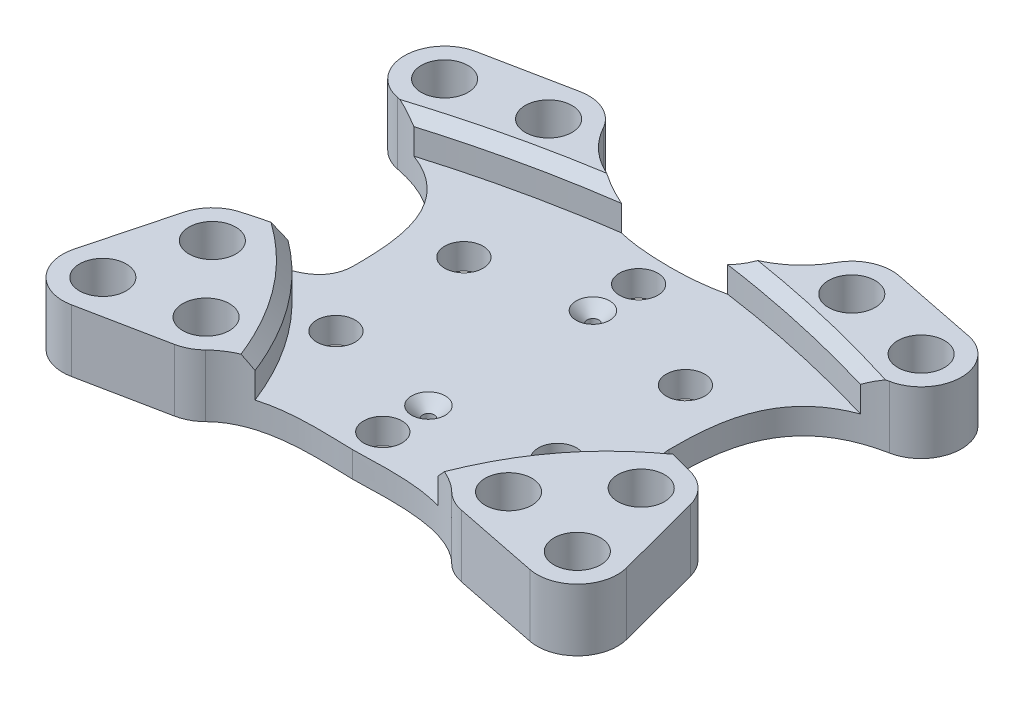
ISO-10303-21;
HEADER;
FILE_DESCRIPTION(('STEP AP214'),'2;1');
FILE_NAME('part.step','',(''),(''),'','','');
FILE_SCHEMA(('AUTOMOTIVE_DESIGN { 1 0 10303 214 1 1 1 1 }'));
ENDSEC;
DATA;
#1=APPLICATION_CONTEXT('core data for automotive mechanical design processes');
#2=APPLICATION_PROTOCOL_DEFINITION('international standard','automotive_design',2000,#1);
#3=PRODUCT_CONTEXT('',#1,'mechanical');
#4=PRODUCT('Part','Part','',(#3));
#5=PRODUCT_RELATED_PRODUCT_CATEGORY('part','',(#4));
#6=PRODUCT_DEFINITION_FORMATION('','',#4);
#7=PRODUCT_DEFINITION_CONTEXT('part definition',#1,'design');
#8=PRODUCT_DEFINITION('design','',#6,#7);
#9=PRODUCT_DEFINITION_SHAPE('','',#8);
#10=(LENGTH_UNIT() NAMED_UNIT(*) SI_UNIT(.MILLI.,.METRE.));
#11=(NAMED_UNIT(*) PLANE_ANGLE_UNIT() SI_UNIT($,.RADIAN.));
#12=(NAMED_UNIT(*) SI_UNIT($,.STERADIAN.) SOLID_ANGLE_UNIT());
#13=UNCERTAINTY_MEASURE_WITH_UNIT(LENGTH_MEASURE(1.E-05),#10,'distance_accuracy_value','');
#14=(GEOMETRIC_REPRESENTATION_CONTEXT(3) GLOBAL_UNCERTAINTY_ASSIGNED_CONTEXT((#13)) GLOBAL_UNIT_ASSIGNED_CONTEXT((#10,
#11,#12)) REPRESENTATION_CONTEXT('',''));
#15=CARTESIAN_POINT('',(0.,0.,0.));
#16=DIRECTION('',(0.,0.,1.));
#17=DIRECTION('',(1.,0.,0.));
#18=AXIS2_PLACEMENT_3D('',#15,#16,#17);
#19=CARTESIAN_POINT('',(50.2662652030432,7.,9.0709998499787));
#20=DIRECTION('',(0.,-1.,0.));
#21=DIRECTION('',(0.,0.,-1.));
#22=AXIS2_PLACEMENT_3D('',#19,#20,#21);
#23=PLANE('',#22);
#24=CARTESIAN_POINT('',(0.,7.,22.5));
#25=DIRECTION('',(0.,-1.,0.));
#26=DIRECTION('',(0.,0.,-1.));
#27=AXIS2_PLACEMENT_3D('',#24,#25,#26);
#28=CIRCLE('',#27,4.60000000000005);
#29=CARTESIAN_POINT('',(0.,7.,27.1));
#30=VERTEX_POINT('',#29);
#31=EDGE_CURVE('E42',#30,#30,#28,.T.);
#32=ORIENTED_EDGE('',*,*,#31,.T.);
#33=EDGE_LOOP('',(#32));
#34=FACE_BOUND('',#33,.T.);
#35=CARTESIAN_POINT('',(0.,7.,-22.5));
#36=DIRECTION('',(0.,-1.,0.));
#37=DIRECTION('',(0.,0.,-1.));
#38=AXIS2_PLACEMENT_3D('',#35,#36,#37);
#39=CIRCLE('',#38,4.60000000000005);
#40=CARTESIAN_POINT('',(0.,7.,-17.9));
#41=VERTEX_POINT('',#40);
#42=EDGE_CURVE('E1123',#41,#41,#39,.T.);
#43=ORIENTED_EDGE('',*,*,#42,.T.);
#44=EDGE_LOOP('',(#43));
#45=FACE_BOUND('',#44,.T.);
#46=CARTESIAN_POINT('',(-30.3108891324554,7.,-17.5));
#47=DIRECTION('',(0.,1.,0.));
#48=DIRECTION('',(0.,0.,1.));
#49=AXIS2_PLACEMENT_3D('',#46,#47,#48);
#50=CIRCLE('',#49,5.25000000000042);
#51=CARTESIAN_POINT('',(-30.3108891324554,7.,-12.2499999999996));
#52=VERTEX_POINT('',#51);
#53=EDGE_CURVE('E935',#52,#52,#50,.T.);
#54=ORIENTED_EDGE('',*,*,#53,.F.);
#55=EDGE_LOOP('',(#54));
#56=FACE_BOUND('',#55,.T.);
#57=CARTESIAN_POINT('',(-30.3108891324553,7.,17.5));
#58=DIRECTION('',(0.,1.,0.));
#59=DIRECTION('',(0.,0.,1.));
#60=AXIS2_PLACEMENT_3D('',#57,#58,#59);
#61=CIRCLE('',#60,5.25000000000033);
#62=CARTESIAN_POINT('',(-30.3108891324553,7.,22.7500000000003));
#63=VERTEX_POINT('',#62);
#64=EDGE_CURVE('E939',#63,#63,#61,.T.);
#65=ORIENTED_EDGE('',*,*,#64,.F.);
#66=EDGE_LOOP('',(#65));
#67=FACE_BOUND('',#66,.T.);
#68=CARTESIAN_POINT('',(0.,7.,35.));
#69=DIRECTION('',(0.,1.,0.));
#70=DIRECTION('',(0.,0.,1.));
#71=AXIS2_PLACEMENT_3D('',#68,#69,#70);
#72=CIRCLE('',#71,5.25000000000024);
#73=CARTESIAN_POINT('',(0.,7.,40.2500000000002));
#74=VERTEX_POINT('',#73);
#75=EDGE_CURVE('E945',#74,#74,#72,.T.);
#76=ORIENTED_EDGE('',*,*,#75,.F.);
#77=EDGE_LOOP('',(#76));
#78=FACE_BOUND('',#77,.T.);
#79=CARTESIAN_POINT('',(30.3108891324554,7.,17.5));
#80=DIRECTION('',(0.,1.,0.));
#81=DIRECTION('',(0.,0.,1.));
#82=AXIS2_PLACEMENT_3D('',#79,#80,#81);
#83=CIRCLE('',#82,5.25000000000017);
#84=CARTESIAN_POINT('',(30.3108891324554,7.,22.7500000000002));
#85=VERTEX_POINT('',#84);
#86=EDGE_CURVE('E951',#85,#85,#83,.T.);
#87=ORIENTED_EDGE('',*,*,#86,.F.);
#88=EDGE_LOOP('',(#87));
#89=FACE_BOUND('',#88,.T.);
#90=CARTESIAN_POINT('',(30.3108891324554,7.,-17.5));
#91=DIRECTION('',(0.,1.,0.));
#92=DIRECTION('',(0.,0.,1.));
#93=AXIS2_PLACEMENT_3D('',#90,#91,#92);
#94=CIRCLE('',#93,5.25000000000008);
#95=CARTESIAN_POINT('',(30.3108891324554,7.,-12.2499999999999));
#96=VERTEX_POINT('',#95);
#97=EDGE_CURVE('E957',#96,#96,#94,.T.);
#98=ORIENTED_EDGE('',*,*,#97,.F.);
#99=EDGE_LOOP('',(#98));
#100=FACE_BOUND('',#99,.T.);
#101=CARTESIAN_POINT('',(0.,7.,-35.));
#102=DIRECTION('',(0.,1.,0.));
#103=DIRECTION('',(0.,0.,1.));
#104=AXIS2_PLACEMENT_3D('',#101,#102,#103);
#105=CIRCLE('',#104,5.25);
#106=CARTESIAN_POINT('',(0.,7.,-29.75));
#107=VERTEX_POINT('',#106);
#108=EDGE_CURVE('E963',#107,#107,#105,.T.);
#109=ORIENTED_EDGE('',*,*,#108,.F.);
#110=EDGE_LOOP('',(#109));
#111=FACE_BOUND('',#110,.T.);
#112=CARTESIAN_POINT('',(-61.0918731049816,7.,-34.6007158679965));
#113=CARTESIAN_POINT('',(-38.2680120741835,7.,-41.4637213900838));
#114=CARTESIAN_POINT('',(-14.5334164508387,7.,-44.8197188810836));
#115=B_SPLINE_CURVE_WITH_KNOTS('',2,(#112,#113,#114),.UNSPECIFIED.,.F.,.F.,(3,3),(0.,1.),.UNSPECIFIED.);
#116=CARTESIAN_POINT('',(-61.0918731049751,7.,-34.6007158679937));
#117=VERTEX_POINT('',#116);
#118=CARTESIAN_POINT('',(-14.5334164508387,7.,-44.8197188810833));
#119=VERTEX_POINT('',#118);
#120=EDGE_CURVE('E283',#117,#119,#115,.T.);
#121=ORIENTED_EDGE('',*,*,#120,.F.);
#122=CARTESIAN_POINT('',(-67.293012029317,7.,-36.3085936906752));
#123=CARTESIAN_POINT('',(-44.1137531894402,7.,-31.8092342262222));
#124=CARTESIAN_POINT('',(-43.3290995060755,7.,-13.4805874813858));
#125=CARTESIAN_POINT('',(-43.3290995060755,7.,0.));
#126=B_SPLINE_CURVE_WITH_KNOTS('',3,(#122,#123,#124,#125),.UNSPECIFIED.,.F.,.F.,(4,4),(0.,1.),.UNSPECIFIED.);
#127=CARTESIAN_POINT('',(-43.3290995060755,7.,0.));
#128=VERTEX_POINT('',#127);
#129=EDGE_CURVE('E632',#117,#128,#126,.T.);
#130=ORIENTED_EDGE('',*,*,#129,.T.);
#131=CARTESIAN_POINT('',(-43.3290995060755,7.,0.));
#132=CARTESIAN_POINT('',(-43.7456450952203,7.,9.91055629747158));
#133=CARTESIAN_POINT('',(-55.1014674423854,7.,10.090689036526));
#134=CARTESIAN_POINT('',(-62.2596845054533,7.,12.5642627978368));
#135=B_SPLINE_CURVE_WITH_KNOTS('',3,(#131,#132,#133,#134),.UNSPECIFIED.,.F.,.F.,(4,4),(0.,1.),.UNSPECIFIED.);
#136=CARTESIAN_POINT('',(-51.4152497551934,7.,9.51886064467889));
#137=VERTEX_POINT('',#136);
#138=EDGE_CURVE('E629',#128,#137,#135,.T.);
#139=ORIENTED_EDGE('',*,*,#138,.T.);
#140=CARTESIAN_POINT('',(-25.0154278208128,7.,44.9336790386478));
#141=CARTESIAN_POINT('',(-33.6568884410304,7.,22.8663350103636));
#142=CARTESIAN_POINT('',(-51.4152497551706,7.,9.51886064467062));
#143=B_SPLINE_CURVE_WITH_KNOTS('',2,(#140,#141,#142),.UNSPECIFIED.,.F.,.F.,(3,3),(0.,1.),.UNSPECIFIED.);
#144=CARTESIAN_POINT('',(-25.0154278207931,7.,44.9336790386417));
#145=VERTEX_POINT('',#144);
#146=EDGE_CURVE('E508',#145,#137,#143,.T.);
#147=ORIENTED_EDGE('',*,*,#146,.F.);
#148=CARTESIAN_POINT('',(-33.6508259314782,7.,49.7876449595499));
#149=CARTESIAN_POINT('',(-25.5271598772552,7.,41.7589094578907));
#150=CARTESIAN_POINT('',(-9.72057012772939,7.,43.1677028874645));
#151=CARTESIAN_POINT('',(0.,7.,43.3290995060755));
#152=B_SPLINE_CURVE_WITH_KNOTS('',3,(#148,#149,#150,#151),.UNSPECIFIED.,.F.,.F.,(4,4),(0.,1.),.UNSPECIFIED.);
#153=CARTESIAN_POINT('',(0.,7.,43.3290995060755));
#154=VERTEX_POINT('',#153);
#155=EDGE_CURVE('E455',#145,#154,#152,.T.);
#156=ORIENTED_EDGE('',*,*,#155,.T.);
#157=CARTESIAN_POINT('',(0.,7.,43.3290995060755));
#158=CARTESIAN_POINT('',(9.72057012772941,7.,43.1677028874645));
#159=CARTESIAN_POINT('',(25.5271598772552,7.,41.7589094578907));
#160=CARTESIAN_POINT('',(33.6508259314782,7.,49.7876449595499));
#161=B_SPLINE_CURVE_WITH_KNOTS('',3,(#157,#158,#159,#160),.UNSPECIFIED.,.F.,.F.,(4,4),(0.,1.),.UNSPECIFIED.);
#162=CARTESIAN_POINT('',(25.0154278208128,7.,44.9336790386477));
#163=VERTEX_POINT('',#162);
#164=EDGE_CURVE('E450',#154,#163,#161,.T.);
#165=ORIENTED_EDGE('',*,*,#164,.T.);
#166=CARTESIAN_POINT('',(51.4152497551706,7.,9.5188606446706));
#167=CARTESIAN_POINT('',(33.6568884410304,7.,22.8663350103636));
#168=CARTESIAN_POINT('',(25.0154278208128,7.,44.9336790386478));
#169=B_SPLINE_CURVE_WITH_KNOTS('',2,(#166,#167,#168),.UNSPECIFIED.,.F.,.F.,(3,3),(0.,1.),.UNSPECIFIED.);
#170=CARTESIAN_POINT('',(51.4152497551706,7.,9.51886064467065));
#171=VERTEX_POINT('',#170);
#172=EDGE_CURVE('E463',#171,#163,#169,.T.);
#173=ORIENTED_EDGE('',*,*,#172,.F.);
#174=CARTESIAN_POINT('',(62.2596845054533,7.,12.5642627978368));
#175=CARTESIAN_POINT('',(55.1014674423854,7.,10.090689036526));
#176=CARTESIAN_POINT('',(43.7456450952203,7.,9.91055629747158));
#177=CARTESIAN_POINT('',(43.3290995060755,7.,0.));
#178=B_SPLINE_CURVE_WITH_KNOTS('',3,(#174,#175,#176,#177),.UNSPECIFIED.,.F.,.F.,(4,4),(0.,1.),.UNSPECIFIED.);
#179=CARTESIAN_POINT('',(43.3290995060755,7.,0.));
#180=VERTEX_POINT('',#179);
#181=EDGE_CURVE('E458',#171,#180,#178,.T.);
#182=ORIENTED_EDGE('',*,*,#181,.T.);
#183=CARTESIAN_POINT('',(43.3290995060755,7.,0.));
#184=CARTESIAN_POINT('',(43.3290995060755,7.,-13.4805874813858));
#185=CARTESIAN_POINT('',(44.1137531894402,7.,-31.8092342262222));
#186=CARTESIAN_POINT('',(67.293012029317,7.,-36.3085936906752));
#187=B_SPLINE_CURVE_WITH_KNOTS('',3,(#183,#184,#185,#186),.UNSPECIFIED.,.F.,.F.,(4,4),(0.,1.),.UNSPECIFIED.);
#188=CARTESIAN_POINT('',(61.0918731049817,7.,-34.6007158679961));
#189=VERTEX_POINT('',#188);
#190=EDGE_CURVE('E461',#180,#189,#187,.T.);
#191=ORIENTED_EDGE('',*,*,#190,.T.);
#192=CARTESIAN_POINT('',(14.5334164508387,7.,-44.8197188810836));
#193=CARTESIAN_POINT('',(38.2680120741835,7.,-41.4637213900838));
#194=CARTESIAN_POINT('',(61.0918731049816,7.,-34.6007158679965));
#195=B_SPLINE_CURVE_WITH_KNOTS('',2,(#192,#193,#194),.UNSPECIFIED.,.F.,.F.,(3,3),(0.,1.),.UNSPECIFIED.);
#196=CARTESIAN_POINT('',(14.5334164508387,7.,-44.8197188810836));
#197=VERTEX_POINT('',#196);
#198=EDGE_CURVE('E1049',#197,#189,#195,.T.);
#199=ORIENTED_EDGE('',*,*,#198,.F.);
#200=CARTESIAN_POINT('',(31.8690744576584,7.,-57.2072848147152));
#201=CARTESIAN_POINT('',(26.2541370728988,7.,-47.1354199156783));
#202=CARTESIAN_POINT('',(15.669804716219,7.,-43.3290995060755));
#203=CARTESIAN_POINT('',(0.,7.,-43.3290995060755));
#204=B_SPLINE_CURVE_WITH_KNOTS('',3,(#200,#201,#202,#203),.UNSPECIFIED.,.F.,.F.,(4,4),(0.,1.),.UNSPECIFIED.);
#205=CARTESIAN_POINT('',(0.,7.,-43.3290995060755));
#206=VERTEX_POINT('',#205);
#207=EDGE_CURVE('E1818',#197,#206,#204,.T.);
#208=ORIENTED_EDGE('',*,*,#207,.T.);
#209=CARTESIAN_POINT('',(0.,7.,-43.3290995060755));
#210=CARTESIAN_POINT('',(-15.669804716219,7.,-43.3290995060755));
#211=CARTESIAN_POINT('',(-26.2541370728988,7.,-47.1354199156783));
#212=CARTESIAN_POINT('',(-31.8690744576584,7.,-57.2072848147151));
#213=B_SPLINE_CURVE_WITH_KNOTS('',3,(#209,#210,#211,#212),.UNSPECIFIED.,.F.,.F.,(4,4),(0.,1.),.UNSPECIFIED.);
#214=EDGE_CURVE('E1721',#206,#119,#213,.T.);
#215=ORIENTED_EDGE('',*,*,#214,.T.);
#216=EDGE_LOOP('',(#121,#130,#139,#147,#156,#165,#173,#182,#191,#199,#208,#215));
#217=FACE_BOUND('',#216,.T.);
#218=ADVANCED_FACE('F34',(#34,#45,#56,#67,#78,#89,#100,#111,#217),#23,.F.);
#219=CARTESIAN_POINT('',(50.2662652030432,0.,9.0709998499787));
#220=DIRECTION('',(0.,-1.,0.));
#221=DIRECTION('',(0.,0.,-1.));
#222=AXIS2_PLACEMENT_3D('',#219,#220,#221);
#223=PLANE('',#222);
#224=CARTESIAN_POINT('',(0.,0.,22.5));
#225=DIRECTION('',(0.,1.,0.));
#226=DIRECTION('',(0.,0.,1.));
#227=AXIS2_PLACEMENT_3D('',#224,#225,#226);
#228=CIRCLE('',#227,1.6);
#229=CARTESIAN_POINT('',(0.,0.,24.1));
#230=VERTEX_POINT('',#229);
#231=EDGE_CURVE('E369',#230,#230,#228,.T.);
#232=ORIENTED_EDGE('',*,*,#231,.T.);
#233=EDGE_LOOP('',(#232));
#234=FACE_BOUND('',#233,.T.);
#235=CARTESIAN_POINT('',(0.,0.,-22.5));
#236=DIRECTION('',(0.,1.,0.));
#237=DIRECTION('',(0.,0.,1.));
#238=AXIS2_PLACEMENT_3D('',#235,#236,#237);
#239=CIRCLE('',#238,1.6);
#240=CARTESIAN_POINT('',(0.,0.,-20.9));
#241=VERTEX_POINT('',#240);
#242=EDGE_CURVE('E366',#241,#241,#239,.T.);
#243=ORIENTED_EDGE('',*,*,#242,.T.);
#244=EDGE_LOOP('',(#243));
#245=FACE_BOUND('',#244,.T.);
#246=CARTESIAN_POINT('',(0.,0.,-35.));
#247=DIRECTION('',(0.,1.,0.));
#248=DIRECTION('',(0.,0.,1.));
#249=AXIS2_PLACEMENT_3D('',#246,#247,#248);
#250=CIRCLE('',#249,5.25);
#251=CARTESIAN_POINT('',(0.,0.,-29.75));
#252=VERTEX_POINT('',#251);
#253=EDGE_CURVE('E966',#252,#252,#250,.T.);
#254=ORIENTED_EDGE('',*,*,#253,.T.);
#255=EDGE_LOOP('',(#254));
#256=FACE_BOUND('',#255,.T.);
#257=CARTESIAN_POINT('',(30.3108891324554,0.,17.5));
#258=DIRECTION('',(0.,1.,0.));
#259=DIRECTION('',(0.,0.,1.));
#260=AXIS2_PLACEMENT_3D('',#257,#258,#259);
#261=CIRCLE('',#260,5.25000000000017);
#262=CARTESIAN_POINT('',(30.3108891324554,0.,22.7500000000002));
#263=VERTEX_POINT('',#262);
#264=EDGE_CURVE('E954',#263,#263,#261,.T.);
#265=ORIENTED_EDGE('',*,*,#264,.T.);
#266=EDGE_LOOP('',(#265));
#267=FACE_BOUND('',#266,.T.);
#268=CARTESIAN_POINT('',(-30.3108891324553,0.,17.5));
#269=DIRECTION('',(0.,1.,0.));
#270=DIRECTION('',(0.,0.,1.));
#271=AXIS2_PLACEMENT_3D('',#268,#269,#270);
#272=CIRCLE('',#271,5.25000000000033);
#273=CARTESIAN_POINT('',(-30.3108891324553,0.,22.7500000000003));
#274=VERTEX_POINT('',#273);
#275=EDGE_CURVE('E942',#274,#274,#272,.T.);
#276=ORIENTED_EDGE('',*,*,#275,.T.);
#277=EDGE_LOOP('',(#276));
#278=FACE_BOUND('',#277,.T.);
#279=CARTESIAN_POINT('',(-41.4769145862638,0.,-51.8510353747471));
#280=DIRECTION('',(0.,1.,0.));
#281=DIRECTION('',(0.,0.,1.));
#282=AXIS2_PLACEMENT_3D('',#279,#280,#281);
#283=CIRCLE('',#282,6.40000000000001);
#284=CARTESIAN_POINT('',(-41.4769145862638,0.,-45.4510353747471));
#285=VERTEX_POINT('',#284);
#286=EDGE_CURVE('E932',#285,#285,#283,.T.);
#287=ORIENTED_EDGE('',*,*,#286,.T.);
#288=EDGE_LOOP('',(#287));
#289=FACE_BOUND('',#288,.T.);
#290=CARTESIAN_POINT('',(-58.6670078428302,0.,22.9610254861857));
#291=DIRECTION('',(0.,1.,0.));
#292=DIRECTION('',(0.,0.,1.));
#293=AXIS2_PLACEMENT_3D('',#290,#291,#292);
#294=CIRCLE('',#293,6.40000000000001);
#295=CARTESIAN_POINT('',(-58.6670078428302,0.,29.3610254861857));
#296=VERTEX_POINT('',#295);
#297=EDGE_CURVE('E926',#296,#296,#294,.T.);
#298=ORIENTED_EDGE('',*,*,#297,.T.);
#299=EDGE_LOOP('',(#298));
#300=FACE_BOUND('',#299,.T.);
#301=CARTESIAN_POINT('',(-64.9144430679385,0.,46.6838917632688));
#302=DIRECTION('',(0.,1.,0.));
#303=DIRECTION('',(0.,0.,1.));
#304=AXIS2_PLACEMENT_3D('',#301,#302,#303);
#305=CIRCLE('',#304,6.40000000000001);
#306=CARTESIAN_POINT('',(-64.9144430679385,0.,53.0838917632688));
#307=VERTEX_POINT('',#306);
#308=EDGE_CURVE('E920',#307,#307,#305,.T.);
#309=ORIENTED_EDGE('',*,*,#308,.T.);
#310=EDGE_LOOP('',(#309));
#311=FACE_BOUND('',#310,.T.);
#312=CARTESIAN_POINT('',(64.9144430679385,0.,46.6838917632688));
#313=DIRECTION('',(0.,1.,0.));
#314=DIRECTION('',(0.,0.,1.));
#315=AXIS2_PLACEMENT_3D('',#312,#313,#314);
#316=CIRCLE('',#315,6.40000000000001);
#317=CARTESIAN_POINT('',(64.9144430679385,0.,53.0838917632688));
#318=VERTEX_POINT('',#317);
#319=EDGE_CURVE('E911',#318,#318,#316,.T.);
#320=ORIENTED_EDGE('',*,*,#319,.T.);
#321=EDGE_LOOP('',(#320));
#322=FACE_BOUND('',#321,.T.);
#323=CARTESIAN_POINT('',(41.4769145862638,0.,-51.8510353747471));
#324=DIRECTION('',(0.,1.,0.));
#325=DIRECTION('',(0.,0.,1.));
#326=AXIS2_PLACEMENT_3D('',#323,#324,#325);
#327=CIRCLE('',#326,6.40000000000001);
#328=CARTESIAN_POINT('',(41.4769145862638,0.,-45.4510353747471));
#329=VERTEX_POINT('',#328);
#330=EDGE_CURVE('E470',#329,#329,#327,.T.);
#331=ORIENTED_EDGE('',*,*,#330,.T.);
#332=EDGE_LOOP('',(#331));
#333=FACE_BOUND('',#332,.T.);
#334=CARTESIAN_POINT('',(62.2596845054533,0.,12.5642627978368));
#335=CARTESIAN_POINT('',(55.1014674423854,0.,10.090689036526));
#336=CARTESIAN_POINT('',(43.7456450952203,0.,9.91055629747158));
#337=CARTESIAN_POINT('',(43.3290995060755,0.,0.));
#338=B_SPLINE_CURVE_WITH_KNOTS('',3,(#334,#335,#336,#337),.UNSPECIFIED.,.F.,.F.,(4,4),(0.,1.),.UNSPECIFIED.);
#339=CARTESIAN_POINT('',(62.2596845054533,0.,12.5642627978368));
#340=VERTEX_POINT('',#339);
#341=CARTESIAN_POINT('',(43.3290995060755,0.,0.));
#342=VERTEX_POINT('',#341);
#343=EDGE_CURVE('E441',#340,#342,#338,.T.);
#344=ORIENTED_EDGE('',*,*,#343,.F.);
#345=CARTESIAN_POINT('',(58.6670078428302,0.,22.9610254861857));
#346=DIRECTION('',(0.,1.,0.));
#347=DIRECTION('',(0.,0.,1.));
#348=AXIS2_PLACEMENT_3D('',#345,#346,#347);
#349=CIRCLE('',#348,11.);
#350=CARTESIAN_POINT('',(69.3043226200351,0.,20.1596803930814));
#351=VERTEX_POINT('',#350);
#352=EDGE_CURVE('E462',#351,#340,#349,.T.);
#353=ORIENTED_EDGE('',*,*,#352,.F.);
#354=DIRECTION('',(-0.254667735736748,0.,-0.967028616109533));
#355=VECTOR('',#354,1.);
#356=CARTESIAN_POINT('',(69.3043226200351,0.,20.1596803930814));
#357=LINE('',#356,#355);
#358=CARTESIAN_POINT('',(75.5517578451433,0.,43.8825466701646));
#359=VERTEX_POINT('',#358);
#360=EDGE_CURVE('E829',#359,#351,#357,.T.);
#361=ORIENTED_EDGE('',*,*,#360,.F.);
#362=CARTESIAN_POINT('',(64.9144430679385,0.,46.6838917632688));
#363=DIRECTION('',(0.,1.,0.));
#364=DIRECTION('',(0.,0.,1.));
#365=AXIS2_PLACEMENT_3D('',#362,#363,#364);
#366=CIRCLE('',#365,11.);
#367=CARTESIAN_POINT('',(62.7511097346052,0.,57.4690662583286));
#368=VERTEX_POINT('',#367);
#369=EDGE_CURVE('E831',#368,#359,#366,.T.);
#370=ORIENTED_EDGE('',*,*,#369,.F.);
#371=DIRECTION('',(0.980470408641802,0.,0.196666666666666));
#372=VECTOR('',#371,1.);
#373=CARTESIAN_POINT('',(39.2198199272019,0.,52.7490662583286));
#374=LINE('',#373,#372);
#375=CARTESIAN_POINT('',(39.2198199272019,0.,52.7490662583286));
#376=VERTEX_POINT('',#375);
#377=EDGE_CURVE('E833',#376,#368,#374,.T.);
#378=ORIENTED_EDGE('',*,*,#377,.F.);
#379=CARTESIAN_POINT('',(41.3831532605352,0.,41.9638917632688));
#380=DIRECTION('',(0.,1.,0.));
#381=DIRECTION('',(0.,0.,1.));
#382=AXIS2_PLACEMENT_3D('',#379,#380,#381);
#383=CIRCLE('',#382,11.);
#384=CARTESIAN_POINT('',(33.6508259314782,0.,49.7876449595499));
#385=VERTEX_POINT('',#384);
#386=EDGE_CURVE('E835',#385,#376,#383,.T.);
#387=ORIENTED_EDGE('',*,*,#386,.F.);
#388=CARTESIAN_POINT('',(0.,0.,43.3290995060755));
#389=CARTESIAN_POINT('',(9.72057012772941,0.,43.1677028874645));
#390=CARTESIAN_POINT('',(25.5271598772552,0.,41.7589094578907));
#391=CARTESIAN_POINT('',(33.6508259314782,0.,49.7876449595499));
#392=B_SPLINE_CURVE_WITH_KNOTS('',3,(#388,#389,#390,#391),.UNSPECIFIED.,.F.,.F.,(4,4),(0.,1.),.UNSPECIFIED.);
#393=CARTESIAN_POINT('',(0.,0.,43.3290995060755));
#394=VERTEX_POINT('',#393);
#395=EDGE_CURVE('E837',#394,#385,#392,.T.);
#396=ORIENTED_EDGE('',*,*,#395,.F.);
#397=CARTESIAN_POINT('',(-33.6508259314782,0.,49.7876449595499));
#398=CARTESIAN_POINT('',(-25.5271598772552,0.,41.7589094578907));
#399=CARTESIAN_POINT('',(-9.72057012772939,0.,43.1677028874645));
#400=CARTESIAN_POINT('',(0.,0.,43.3290995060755));
#401=B_SPLINE_CURVE_WITH_KNOTS('',3,(#397,#398,#399,#400),.UNSPECIFIED.,.F.,.F.,(4,4),(0.,1.),.UNSPECIFIED.);
#402=CARTESIAN_POINT('',(-33.6508259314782,0.,49.7876449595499));
#403=VERTEX_POINT('',#402);
#404=EDGE_CURVE('E841',#403,#394,#401,.T.);
#405=ORIENTED_EDGE('',*,*,#404,.F.);
#406=CARTESIAN_POINT('',(-41.3831532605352,0.,41.9638917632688));
#407=DIRECTION('',(0.,1.,0.));
#408=DIRECTION('',(0.,0.,1.));
#409=AXIS2_PLACEMENT_3D('',#406,#407,#408);
#410=CIRCLE('',#409,11.);
#411=CARTESIAN_POINT('',(-39.2198199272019,0.,52.7490662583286));
#412=VERTEX_POINT('',#411);
#413=EDGE_CURVE('E848',#412,#403,#410,.T.);
#414=ORIENTED_EDGE('',*,*,#413,.F.);
#415=DIRECTION('',(0.980470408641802,0.,-0.196666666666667));
#416=VECTOR('',#415,1.);
#417=CARTESIAN_POINT('',(-39.2198199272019,0.,52.7490662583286));
#418=LINE('',#417,#416);
#419=CARTESIAN_POINT('',(-62.7511097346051,0.,57.4690662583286));
#420=VERTEX_POINT('',#419);
#421=EDGE_CURVE('E853',#420,#412,#418,.T.);
#422=ORIENTED_EDGE('',*,*,#421,.F.);
#423=CARTESIAN_POINT('',(-64.9144430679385,0.,46.6838917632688));
#424=DIRECTION('',(0.,1.,0.));
#425=DIRECTION('',(0.,0.,1.));
#426=AXIS2_PLACEMENT_3D('',#423,#424,#425);
#427=CIRCLE('',#426,11.);
#428=CARTESIAN_POINT('',(-75.5517578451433,0.,43.8825466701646));
#429=VERTEX_POINT('',#428);
#430=EDGE_CURVE('E855',#429,#420,#427,.T.);
#431=ORIENTED_EDGE('',*,*,#430,.F.);
#432=DIRECTION('',(-0.254667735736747,0.,0.967028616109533));
#433=VECTOR('',#432,1.);
#434=CARTESIAN_POINT('',(-69.3043226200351,0.,20.1596803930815));
#435=LINE('',#434,#433);
#436=CARTESIAN_POINT('',(-69.304322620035,0.,20.1596803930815));
#437=VERTEX_POINT('',#436);
#438=EDGE_CURVE('E857',#437,#429,#435,.T.);
#439=ORIENTED_EDGE('',*,*,#438,.F.);
#440=CARTESIAN_POINT('',(-58.6670078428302,0.,22.9610254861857));
#441=DIRECTION('',(0.,1.,0.));
#442=DIRECTION('',(0.,0.,1.));
#443=AXIS2_PLACEMENT_3D('',#440,#441,#442);
#444=CIRCLE('',#443,11.);
#445=CARTESIAN_POINT('',(-62.2596845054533,0.,12.5642627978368));
#446=VERTEX_POINT('',#445);
#447=EDGE_CURVE('E859',#446,#437,#444,.T.);
#448=ORIENTED_EDGE('',*,*,#447,.F.);
#449=CARTESIAN_POINT('',(-43.3290995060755,0.,0.));
#450=CARTESIAN_POINT('',(-43.7456450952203,0.,9.91055629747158));
#451=CARTESIAN_POINT('',(-55.1014674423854,0.,10.090689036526));
#452=CARTESIAN_POINT('',(-62.2596845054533,0.,12.5642627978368));
#453=B_SPLINE_CURVE_WITH_KNOTS('',3,(#449,#450,#451,#452),.UNSPECIFIED.,.F.,.F.,(4,4),(0.,1.),.UNSPECIFIED.);
#454=CARTESIAN_POINT('',(-43.3290995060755,0.,0.));
#455=VERTEX_POINT('',#454);
#456=EDGE_CURVE('E861',#455,#446,#453,.T.);
#457=ORIENTED_EDGE('',*,*,#456,.F.);
#458=CARTESIAN_POINT('',(-67.293012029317,0.,-36.3085936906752));
#459=CARTESIAN_POINT('',(-44.1137531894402,0.,-31.8092342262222));
#460=CARTESIAN_POINT('',(-43.3290995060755,0.,-13.4805874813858));
#461=CARTESIAN_POINT('',(-43.3290995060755,0.,0.));
#462=B_SPLINE_CURVE_WITH_KNOTS('',3,(#458,#459,#460,#461),.UNSPECIFIED.,.F.,.F.,(4,4),(0.,1.),.UNSPECIFIED.);
#463=CARTESIAN_POINT('',(-67.293012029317,0.,-36.3085936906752));
#464=VERTEX_POINT('',#463);
#465=EDGE_CURVE('E865',#464,#455,#462,.T.);
#466=ORIENTED_EDGE('',*,*,#465,.F.);
#467=CARTESIAN_POINT('',(-65.1969107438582,0.,-47.1070361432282));
#468=DIRECTION('',(0.,1.,0.));
#469=DIRECTION('',(0.,0.,1.));
#470=AXIS2_PLACEMENT_3D('',#467,#468,#469);
#471=CIRCLE('',#470,11.);
#472=CARTESIAN_POINT('',(-67.3541882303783,0.,-57.8934235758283));
#473=VERTEX_POINT('',#472);
#474=EDGE_CURVE('E872',#473,#464,#471,.T.);
#475=ORIENTED_EDGE('',*,*,#474,.F.);
#476=DIRECTION('',(-0.98058067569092,0.,0.196116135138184));
#477=VECTOR('',#476,1.);
#478=CARTESIAN_POINT('',(-43.6341920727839,0.,-62.6374228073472));
#479=LINE('',#478,#477);
#480=CARTESIAN_POINT('',(-43.6341920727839,0.,-62.6374228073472));
#481=VERTEX_POINT('',#480);
#482=EDGE_CURVE('E877',#481,#473,#479,.T.);
#483=ORIENTED_EDGE('',*,*,#482,.F.);
#484=CARTESIAN_POINT('',(-41.4769145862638,0.,-51.8510353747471));
#485=DIRECTION('',(0.,1.,0.));
#486=DIRECTION('',(0.,0.,1.));
#487=AXIS2_PLACEMENT_3D('',#484,#485,#486);
#488=CIRCLE('',#487,11.);
#489=CARTESIAN_POINT('',(-31.8690744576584,0.,-57.2072848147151));
#490=VERTEX_POINT('',#489);
#491=EDGE_CURVE('E879',#490,#481,#488,.T.);
#492=ORIENTED_EDGE('',*,*,#491,.F.);
#493=CARTESIAN_POINT('',(0.,0.,-43.3290995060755));
#494=CARTESIAN_POINT('',(-15.669804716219,0.,-43.3290995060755));
#495=CARTESIAN_POINT('',(-26.2541370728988,0.,-47.1354199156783));
#496=CARTESIAN_POINT('',(-31.8690744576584,0.,-57.2072848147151));
#497=B_SPLINE_CURVE_WITH_KNOTS('',3,(#493,#494,#495,#496),.UNSPECIFIED.,.F.,.F.,(4,4),(0.,1.),.UNSPECIFIED.);
#498=CARTESIAN_POINT('',(0.,0.,-43.3290995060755));
#499=VERTEX_POINT('',#498);
#500=EDGE_CURVE('E290',#499,#490,#497,.T.);
#501=ORIENTED_EDGE('',*,*,#500,.F.);
#502=CARTESIAN_POINT('',(31.8690744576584,0.,-57.2072848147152));
#503=CARTESIAN_POINT('',(26.2541370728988,0.,-47.1354199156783));
#504=CARTESIAN_POINT('',(15.669804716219,0.,-43.3290995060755));
#505=CARTESIAN_POINT('',(0.,0.,-43.3290995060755));
#506=B_SPLINE_CURVE_WITH_KNOTS('',3,(#502,#503,#504,#505),.UNSPECIFIED.,.F.,.F.,(4,4),(0.,1.),.UNSPECIFIED.);
#507=CARTESIAN_POINT('',(31.8690744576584,0.,-57.2072848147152));
#508=VERTEX_POINT('',#507);
#509=EDGE_CURVE('E884',#508,#499,#506,.T.);
#510=ORIENTED_EDGE('',*,*,#509,.F.);
#511=CARTESIAN_POINT('',(41.4769145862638,0.,-51.8510353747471));
#512=DIRECTION('',(0.,1.,0.));
#513=DIRECTION('',(0.,0.,1.));
#514=AXIS2_PLACEMENT_3D('',#511,#512,#513);
#515=CIRCLE('',#514,11.);
#516=CARTESIAN_POINT('',(43.6341920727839,0.,-62.6374228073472));
#517=VERTEX_POINT('',#516);
#518=EDGE_CURVE('E891',#517,#508,#515,.T.);
#519=ORIENTED_EDGE('',*,*,#518,.F.);
#520=DIRECTION('',(-0.98058067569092,0.,-0.196116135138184));
#521=VECTOR('',#520,1.);
#522=CARTESIAN_POINT('',(43.6341920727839,0.,-62.6374228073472));
#523=LINE('',#522,#521);
#524=CARTESIAN_POINT('',(67.3541882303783,0.,-57.8934235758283));
#525=VERTEX_POINT('',#524);
#526=EDGE_CURVE('E896',#525,#517,#523,.T.);
#527=ORIENTED_EDGE('',*,*,#526,.F.);
#528=CARTESIAN_POINT('',(65.1969107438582,0.,-47.1070361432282));
#529=DIRECTION('',(0.,1.,0.));
#530=DIRECTION('',(0.,0.,1.));
#531=AXIS2_PLACEMENT_3D('',#528,#529,#530);
#532=CIRCLE('',#531,11.);
#533=CARTESIAN_POINT('',(67.293012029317,0.,-36.3085936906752));
#534=VERTEX_POINT('',#533);
#535=EDGE_CURVE('E898',#534,#525,#532,.T.);
#536=ORIENTED_EDGE('',*,*,#535,.F.);
#537=CARTESIAN_POINT('',(43.3290995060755,0.,0.));
#538=CARTESIAN_POINT('',(43.3290995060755,0.,-13.4805874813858));
#539=CARTESIAN_POINT('',(44.1137531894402,0.,-31.8092342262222));
#540=CARTESIAN_POINT('',(67.293012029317,0.,-36.3085936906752));
#541=B_SPLINE_CURVE_WITH_KNOTS('',3,(#537,#538,#539,#540),.UNSPECIFIED.,.F.,.F.,(4,4),(0.,1.),.UNSPECIFIED.);
#542=EDGE_CURVE('E899',#342,#534,#541,.T.);
#543=ORIENTED_EDGE('',*,*,#542,.F.);
#544=EDGE_LOOP('',(#344,#353,#361,#370,#378,#387,#396,#405,#414,#422,#431,#439,#448,#457,#466,
#475,#483,#492,#501,#510,#519,#527,#536,#543));
#545=FACE_BOUND('',#544,.T.);
#546=CARTESIAN_POINT('',(65.1969107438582,0.,-47.1070361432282));
#547=DIRECTION('',(0.,1.,0.));
#548=DIRECTION('',(0.,0.,1.));
#549=AXIS2_PLACEMENT_3D('',#546,#547,#548);
#550=CIRCLE('',#549,6.40000000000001);
#551=CARTESIAN_POINT('',(65.1969107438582,0.,-40.7070361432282));
#552=VERTEX_POINT('',#551);
#553=EDGE_CURVE('E907',#552,#552,#550,.T.);
#554=ORIENTED_EDGE('',*,*,#553,.T.);
#555=EDGE_LOOP('',(#554));
#556=FACE_BOUND('',#555,.T.);
#557=CARTESIAN_POINT('',(41.3831532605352,0.,41.9638917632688));
#558=DIRECTION('',(0.,1.,0.));
#559=DIRECTION('',(0.,0.,1.));
#560=AXIS2_PLACEMENT_3D('',#557,#558,#559);
#561=CIRCLE('',#560,6.4);
#562=CARTESIAN_POINT('',(41.3831532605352,0.,48.3638917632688));
#563=VERTEX_POINT('',#562);
#564=EDGE_CURVE('E915',#563,#563,#561,.T.);
#565=ORIENTED_EDGE('',*,*,#564,.T.);
#566=EDGE_LOOP('',(#565));
#567=FACE_BOUND('',#566,.T.);
#568=CARTESIAN_POINT('',(-41.3831532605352,0.,41.9638917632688));
#569=DIRECTION('',(0.,1.,0.));
#570=DIRECTION('',(0.,0.,1.));
#571=AXIS2_PLACEMENT_3D('',#568,#569,#570);
#572=CIRCLE('',#571,6.4);
#573=CARTESIAN_POINT('',(-41.3831532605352,0.,48.3638917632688));
#574=VERTEX_POINT('',#573);
#575=EDGE_CURVE('E923',#574,#574,#572,.T.);
#576=ORIENTED_EDGE('',*,*,#575,.T.);
#577=EDGE_LOOP('',(#576));
#578=FACE_BOUND('',#577,.T.);
#579=CARTESIAN_POINT('',(-65.1969107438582,0.,-47.1070361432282));
#580=DIRECTION('',(0.,1.,0.));
#581=DIRECTION('',(0.,0.,1.));
#582=AXIS2_PLACEMENT_3D('',#579,#580,#581);
#583=CIRCLE('',#582,6.40000000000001);
#584=CARTESIAN_POINT('',(-65.1969107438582,0.,-40.7070361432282));
#585=VERTEX_POINT('',#584);
#586=EDGE_CURVE('E929',#585,#585,#583,.T.);
#587=ORIENTED_EDGE('',*,*,#586,.T.);
#588=EDGE_LOOP('',(#587));
#589=FACE_BOUND('',#588,.T.);
#590=CARTESIAN_POINT('',(-30.3108891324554,0.,-17.5));
#591=DIRECTION('',(0.,1.,0.));
#592=DIRECTION('',(0.,0.,1.));
#593=AXIS2_PLACEMENT_3D('',#590,#591,#592);
#594=CIRCLE('',#593,5.25000000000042);
#595=CARTESIAN_POINT('',(-30.3108891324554,0.,-12.2499999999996));
#596=VERTEX_POINT('',#595);
#597=EDGE_CURVE('E936',#596,#596,#594,.T.);
#598=ORIENTED_EDGE('',*,*,#597,.T.);
#599=EDGE_LOOP('',(#598));
#600=FACE_BOUND('',#599,.T.);
#601=CARTESIAN_POINT('',(0.,0.,35.));
#602=DIRECTION('',(0.,1.,0.));
#603=DIRECTION('',(0.,0.,1.));
#604=AXIS2_PLACEMENT_3D('',#601,#602,#603);
#605=CIRCLE('',#604,5.25000000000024);
#606=CARTESIAN_POINT('',(0.,0.,40.2500000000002));
#607=VERTEX_POINT('',#606);
#608=EDGE_CURVE('E948',#607,#607,#605,.T.);
#609=ORIENTED_EDGE('',*,*,#608,.T.);
#610=EDGE_LOOP('',(#609));
#611=FACE_BOUND('',#610,.T.);
#612=CARTESIAN_POINT('',(30.3108891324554,0.,-17.5));
#613=DIRECTION('',(0.,1.,0.));
#614=DIRECTION('',(0.,0.,1.));
#615=AXIS2_PLACEMENT_3D('',#612,#613,#614);
#616=CIRCLE('',#615,5.25000000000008);
#617=CARTESIAN_POINT('',(30.3108891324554,0.,-12.2499999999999));
#618=VERTEX_POINT('',#617);
#619=EDGE_CURVE('E960',#618,#618,#616,.T.);
#620=ORIENTED_EDGE('',*,*,#619,.T.);
#621=EDGE_LOOP('',(#620));
#622=FACE_BOUND('',#621,.T.);
#623=CARTESIAN_POINT('',(58.6670078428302,0.,22.9610254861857));
#624=DIRECTION('',(0.,1.,0.));
#625=DIRECTION('',(0.,0.,1.));
#626=AXIS2_PLACEMENT_3D('',#623,#624,#625);
#627=CIRCLE('',#626,6.40000000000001);
#628=CARTESIAN_POINT('',(58.6670078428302,0.,29.3610254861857));
#629=VERTEX_POINT('',#628);
#630=EDGE_CURVE('E969',#629,#629,#627,.T.);
#631=ORIENTED_EDGE('',*,*,#630,.T.);
#632=EDGE_LOOP('',(#631));
#633=FACE_BOUND('',#632,.T.);
#634=ADVANCED_FACE('F373',(#234,#245,#256,#267,#278,#289,#300,#311,#322,#333,#545,#556,#567,
#578,#589,#600,#611,#622,#633),#223,.T.);
#635=DIRECTION('',(0.,-1.,0.));
#636=VECTOR('',#635,1.);
#637=SURFACE_OF_LINEAR_EXTRUSION('',#178,#636);
#638=DIRECTION('',(0.,-1.,0.));
#639=VECTOR('',#638,1.);
#640=CARTESIAN_POINT('',(51.4152497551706,17.,9.5188606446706));
#641=LINE('',#640,#639);
#642=CARTESIAN_POINT('',(51.4152497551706,13.9999999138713,9.5188606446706));
#643=VERTEX_POINT('',#642);
#644=EDGE_CURVE('E619',#643,#171,#641,.T.);
#645=ORIENTED_EDGE('',*,*,#644,.F.);
#646=CARTESIAN_POINT('',(51.4152502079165,13.9999999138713,9.51886080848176));
#647=CARTESIAN_POINT('',(51.5565650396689,14.1257819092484,9.56999008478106));
#648=CARTESIAN_POINT('',(51.6986102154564,14.2511643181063,9.62007233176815));
#649=CARTESIAN_POINT('',(51.9847609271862,14.5018213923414,9.71855603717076));
#650=CARTESIAN_POINT('',(52.1288733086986,14.6270921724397,9.76694750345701));
#651=CARTESIAN_POINT('',(52.4189972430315,14.8775248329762,9.8621684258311));
#652=CARTESIAN_POINT('',(52.5650146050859,15.0026832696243,9.90898921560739));
#653=CARTESIAN_POINT('',(52.8587855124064,15.2528910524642,10.0011903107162));
#654=CARTESIAN_POINT('',(53.0065438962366,15.3779374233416,10.0465632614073));
#655=CARTESIAN_POINT('',(53.3036291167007,15.6279205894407,10.1359935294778));
#656=CARTESIAN_POINT('',(53.452959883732,15.7528548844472,10.1800447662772));
#657=CARTESIAN_POINT('',(53.7530182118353,16.0026135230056,10.2669596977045));
#658=CARTESIAN_POINT('',(53.903748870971,16.1274358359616,10.3098185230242));
#659=CARTESIAN_POINT('',(54.2064308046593,16.3769699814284,10.3944800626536));
#660=CARTESIAN_POINT('',(54.3583844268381,16.5016802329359,10.4362790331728));
#661=CARTESIAN_POINT('',(54.6633328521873,16.7509903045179,10.5189556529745));
#662=CARTESIAN_POINT('',(54.816329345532,16.8755889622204,10.5598305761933));
#663=CARTESIAN_POINT('',(54.9695908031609,17.,10.6002712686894));
#664=B_SPLINE_CURVE_WITH_KNOTS('',3,(#646,#647,#648,#649,#650,#651,#652,#653,#654,#655,#656,
#657,#658,#659,#660,#661,#662,#663),.UNSPECIFIED.,.F.,.F.,(4,2,2,2,2,2,2,2,4),(0.,
0.587908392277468,1.17884658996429,1.77263694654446,2.36907520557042,2.96793188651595,
3.56895370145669,4.17186500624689,4.77636929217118),.UNSPECIFIED.);
#665=CARTESIAN_POINT('',(54.9695908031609,17.,10.6002712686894));
#666=VERTEX_POINT('',#665);
#667=EDGE_CURVE('E751',#643,#666,#664,.T.);
#668=ORIENTED_EDGE('',*,*,#667,.T.);
#669=CARTESIAN_POINT('',(62.2596845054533,17.,12.5642627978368));
#670=CARTESIAN_POINT('',(55.1014674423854,17.,10.090689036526));
#671=CARTESIAN_POINT('',(43.7456450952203,17.,9.91055629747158));
#672=CARTESIAN_POINT('',(43.3290995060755,17.,0.));
#673=B_SPLINE_CURVE_WITH_KNOTS('',3,(#669,#670,#671,#672),.UNSPECIFIED.,.F.,.F.,(4,4),(0.,1.),.UNSPECIFIED.);
#674=CARTESIAN_POINT('',(62.2596845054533,17.,12.5642627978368));
#675=VERTEX_POINT('',#674);
#676=EDGE_CURVE('E568',#675,#666,#673,.T.);
#677=ORIENTED_EDGE('',*,*,#676,.F.);
#678=DIRECTION('',(0.,-1.,0.));
#679=VECTOR('',#678,1.);
#680=CARTESIAN_POINT('',(62.2596845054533,7.,12.5642627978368));
#681=LINE('',#680,#679);
#682=EDGE_CURVE('E454',#675,#340,#681,.T.);
#683=ORIENTED_EDGE('',*,*,#682,.T.);
#684=ORIENTED_EDGE('',*,*,#343,.T.);
#685=DIRECTION('',(0.,-1.,0.));
#686=VECTOR('',#685,1.);
#687=CARTESIAN_POINT('',(43.3290995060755,7.,0.));
#688=LINE('',#687,#686);
#689=EDGE_CURVE('E456',#180,#342,#688,.T.);
#690=ORIENTED_EDGE('',*,*,#689,.F.);
#691=ORIENTED_EDGE('',*,*,#181,.F.);
#692=EDGE_LOOP('',(#645,#668,#677,#683,#684,#690,#691));
#693=FACE_BOUND('',#692,.T.);
#694=ADVANCED_FACE('F394',(#693),#637,.F.);
#695=DIRECTION('',(0.,-1.,0.));
#696=VECTOR('',#695,1.);
#697=SURFACE_OF_LINEAR_EXTRUSION('',#187,#696);
#698=CARTESIAN_POINT('',(43.3290995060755,17.,0.));
#699=CARTESIAN_POINT('',(43.3290995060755,17.,-13.4805874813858));
#700=CARTESIAN_POINT('',(44.1137531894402,17.,-31.8092342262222));
#701=CARTESIAN_POINT('',(67.293012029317,17.,-36.3085936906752));
#702=B_SPLINE_CURVE_WITH_KNOTS('',3,(#698,#699,#700,#701),.UNSPECIFIED.,.F.,.F.,(4,4),(0.,1.),.UNSPECIFIED.);
#703=CARTESIAN_POINT('',(66.4217458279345,17.,-36.1307445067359));
#704=VERTEX_POINT('',#703);
#705=CARTESIAN_POINT('',(67.293012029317,17.,-36.3085936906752));
#706=VERTEX_POINT('',#705);
#707=EDGE_CURVE('E1022',#704,#706,#702,.T.);
#708=ORIENTED_EDGE('',*,*,#707,.F.);
#709=CARTESIAN_POINT('',(66.4217458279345,17.,-36.1307445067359));
#710=CARTESIAN_POINT('',(66.1871849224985,16.8843108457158,-36.080469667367));
#711=CARTESIAN_POINT('',(65.9536745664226,16.7672468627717,-36.0284465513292));
#712=CARTESIAN_POINT('',(65.4898244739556,16.5308407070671,-35.9210710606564));
#713=CARTESIAN_POINT('',(65.2594757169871,16.4115097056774,-35.8657330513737));
#714=CARTESIAN_POINT('',(64.8019994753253,16.1705692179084,-35.7517088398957));
#715=CARTESIAN_POINT('',(64.5748629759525,16.0489703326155,-35.6930364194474));
#716=CARTESIAN_POINT('',(64.1238613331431,15.8034948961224,-35.5723270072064));
#717=CARTESIAN_POINT('',(63.8999872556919,15.6796283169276,-35.5103031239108));
#718=CARTESIAN_POINT('',(63.4555587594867,15.4296180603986,-35.3828756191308));
#719=CARTESIAN_POINT('',(63.2349955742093,15.3034836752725,-35.3174843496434));
#720=CARTESIAN_POINT('',(62.7972356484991,15.048938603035,-35.1833086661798));
#721=CARTESIAN_POINT('',(62.5800304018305,14.9205364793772,-35.1145357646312));
#722=CARTESIAN_POINT('',(62.149031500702,14.6614563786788,-34.9735845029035));
#723=CARTESIAN_POINT('',(61.9352296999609,14.5307861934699,-34.9014167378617));
#724=CARTESIAN_POINT('',(61.5110811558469,14.2671718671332,-34.7536668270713));
#725=CARTESIAN_POINT('',(61.3007267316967,14.1342347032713,-34.6780942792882));
#726=CARTESIAN_POINT('',(61.0918732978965,13.9999998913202,-34.6007159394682));
#727=B_SPLINE_CURVE_WITH_KNOTS('',3,(#709,#710,#711,#712,#713,#714,#715,#716,#717,#718,#719,
#720,#721,#722,#723,#724,#725,#726),.UNSPECIFIED.,.F.,.F.,(4,2,2,2,2,2,2,2,4),(0.,
0.798974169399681,1.59470641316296,2.38736013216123,3.17711102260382,3.96414688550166,
4.74866738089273,5.53088372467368,6.31101832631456),.UNSPECIFIED.);
#728=CARTESIAN_POINT('',(61.0918731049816,14.,-34.6007158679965));
#729=VERTEX_POINT('',#728);
#730=EDGE_CURVE('E58',#704,#729,#727,.T.);
#731=ORIENTED_EDGE('',*,*,#730,.T.);
#732=DIRECTION('',(0.,-1.,0.));
#733=VECTOR('',#732,1.);
#734=CARTESIAN_POINT('',(61.0918731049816,17.,-34.6007158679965));
#735=LINE('',#734,#733);
#736=EDGE_CURVE('E981',#729,#189,#735,.T.);
#737=ORIENTED_EDGE('',*,*,#736,.T.);
#738=ORIENTED_EDGE('',*,*,#190,.F.);
#739=ORIENTED_EDGE('',*,*,#689,.T.);
#740=ORIENTED_EDGE('',*,*,#542,.T.);
#741=DIRECTION('',(0.,-1.,0.));
#742=VECTOR('',#741,1.);
#743=CARTESIAN_POINT('',(67.293012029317,7.,-36.3085936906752));
#744=LINE('',#743,#742);
#745=EDGE_CURVE('E760',#706,#534,#744,.T.);
#746=ORIENTED_EDGE('',*,*,#745,.F.);
#747=EDGE_LOOP('',(#708,#731,#737,#738,#739,#740,#746));
#748=FACE_BOUND('',#747,.T.);
#749=ADVANCED_FACE('F485',(#748),#697,.F.);
#750=CARTESIAN_POINT('',(65.1969107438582,7.,-47.1070361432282));
#751=DIRECTION('',(0.,-1.,0.));
#752=DIRECTION('',(0.,0.,-1.));
#753=AXIS2_PLACEMENT_3D('',#750,#751,#752);
#754=CYLINDRICAL_SURFACE('',#753,11.);
#755=ORIENTED_EDGE('',*,*,#535,.T.);
#756=DIRECTION('',(0.,-1.,0.));
#757=VECTOR('',#756,1.);
#758=CARTESIAN_POINT('',(67.3541882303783,7.,-57.8934235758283));
#759=LINE('',#758,#757);
#760=CARTESIAN_POINT('',(67.3541882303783,17.,-57.8934235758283));
#761=VERTEX_POINT('',#760);
#762=EDGE_CURVE('E765',#761,#525,#759,.T.);
#763=ORIENTED_EDGE('',*,*,#762,.F.);
#764=CARTESIAN_POINT('',(65.1969107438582,17.,-47.1070361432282));
#765=DIRECTION('',(0.,1.,0.));
#766=DIRECTION('',(0.,0.,1.));
#767=AXIS2_PLACEMENT_3D('',#764,#765,#766);
#768=CIRCLE('',#767,11.);
#769=EDGE_CURVE('E1016',#706,#761,#768,.T.);
#770=ORIENTED_EDGE('',*,*,#769,.F.);
#771=ORIENTED_EDGE('',*,*,#745,.T.);
#772=EDGE_LOOP('',(#755,#763,#770,#771));
#773=FACE_BOUND('',#772,.T.);
#774=ADVANCED_FACE('F1326',(#773),#754,.T.);
#775=CARTESIAN_POINT('',(43.6341920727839,7.,-62.6374228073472));
#776=DIRECTION('',(-0.196116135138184,0.,0.98058067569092));
#777=DIRECTION('',(0.98058067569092,0.,0.196116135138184));
#778=AXIS2_PLACEMENT_3D('',#775,#776,#777);
#779=PLANE('',#778);
#780=ORIENTED_EDGE('',*,*,#526,.T.);
#781=DIRECTION('',(0.,-1.,0.));
#782=VECTOR('',#781,1.);
#783=CARTESIAN_POINT('',(43.6341920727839,7.,-62.6374228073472));
#784=LINE('',#783,#782);
#785=CARTESIAN_POINT('',(43.6341920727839,17.,-62.6374228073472));
#786=VERTEX_POINT('',#785);
#787=EDGE_CURVE('E771',#786,#517,#784,.T.);
#788=ORIENTED_EDGE('',*,*,#787,.F.);
#789=DIRECTION('',(-0.98058067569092,0.,-0.196116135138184));
#790=VECTOR('',#789,1.);
#791=CARTESIAN_POINT('',(43.6341920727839,17.,-62.6374228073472));
#792=LINE('',#791,#790);
#793=EDGE_CURVE('E1044',#761,#786,#792,.T.);
#794=ORIENTED_EDGE('',*,*,#793,.F.);
#795=ORIENTED_EDGE('',*,*,#762,.T.);
#796=EDGE_LOOP('',(#780,#788,#794,#795));
#797=FACE_BOUND('',#796,.T.);
#798=ADVANCED_FACE('F1318',(#797),#779,.F.);
#799=CARTESIAN_POINT('',(41.4769145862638,7.,-51.8510353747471));
#800=DIRECTION('',(0.,-1.,0.));
#801=DIRECTION('',(0.,0.,-1.));
#802=AXIS2_PLACEMENT_3D('',#799,#800,#801);
#803=CYLINDRICAL_SURFACE('',#802,11.);
#804=ORIENTED_EDGE('',*,*,#518,.T.);
#805=DIRECTION('',(0.,-1.,0.));
#806=VECTOR('',#805,1.);
#807=CARTESIAN_POINT('',(31.8690744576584,7.,-57.2072848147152));
#808=LINE('',#807,#806);
#809=CARTESIAN_POINT('',(31.8690744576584,17.,-57.2072848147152));
#810=VERTEX_POINT('',#809);
#811=EDGE_CURVE('E776',#810,#508,#808,.T.);
#812=ORIENTED_EDGE('',*,*,#811,.F.);
#813=CARTESIAN_POINT('',(41.4769145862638,17.,-51.8510353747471));
#814=DIRECTION('',(0.,1.,0.));
#815=DIRECTION('',(0.,0.,1.));
#816=AXIS2_PLACEMENT_3D('',#813,#814,#815);
#817=CIRCLE('',#816,11.);
#818=EDGE_CURVE('E1041',#786,#810,#817,.T.);
#819=ORIENTED_EDGE('',*,*,#818,.F.);
#820=ORIENTED_EDGE('',*,*,#787,.T.);
#821=EDGE_LOOP('',(#804,#812,#819,#820));
#822=FACE_BOUND('',#821,.T.);
#823=ADVANCED_FACE('F1311',(#822),#803,.T.);
#824=DIRECTION('',(0.,-1.,0.));
#825=VECTOR('',#824,1.);
#826=SURFACE_OF_LINEAR_EXTRUSION('',#204,#825);
#827=DIRECTION('',(0.,-1.,0.));
#828=VECTOR('',#827,1.);
#829=CARTESIAN_POINT('',(14.5334164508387,17.,-44.8197188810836));
#830=LINE('',#829,#828);
#831=CARTESIAN_POINT('',(14.5334164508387,13.9999989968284,-44.8197188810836));
#832=VERTEX_POINT('',#831);
#833=EDGE_CURVE('E974',#832,#197,#830,.T.);
#834=ORIENTED_EDGE('',*,*,#833,.F.);
#835=CARTESIAN_POINT('',(14.5334172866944,13.9999989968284,-44.819719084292));
#836=CARTESIAN_POINT('',(14.811646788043,14.1059484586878,-44.8873577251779));
#837=CARTESIAN_POINT('',(15.0881824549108,14.2146476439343,-44.9576841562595));
#838=CARTESIAN_POINT('',(15.6355430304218,14.4367430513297,-45.1032672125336));
#839=CARTESIAN_POINT('',(15.9063949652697,14.5500989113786,-45.1784838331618));
#840=CARTESIAN_POINT('',(16.4424139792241,14.7815073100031,-45.333886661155));
#841=CARTESIAN_POINT('',(16.7076065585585,14.8995245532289,-45.4140374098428));
#842=CARTESIAN_POINT('',(17.2323317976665,15.1402492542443,-45.5793422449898));
#843=CARTESIAN_POINT('',(17.491887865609,15.2629266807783,-45.6644657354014));
#844=CARTESIAN_POINT('',(18.0053658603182,15.5129668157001,-45.8397505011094));
#845=CARTESIAN_POINT('',(18.2593085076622,15.6403048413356,-45.9298862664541));
#846=CARTESIAN_POINT('',(18.7615861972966,15.8996603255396,-46.1152285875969));
#847=CARTESIAN_POINT('',(19.0099386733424,16.0316584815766,-46.2104148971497));
#848=CARTESIAN_POINT('',(19.5010619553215,16.3003300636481,-46.4058924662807));
#849=CARTESIAN_POINT('',(19.7438463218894,16.4369895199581,-46.5061688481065));
#850=CARTESIAN_POINT('',(20.223864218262,16.7149736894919,-46.7118540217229));
#851=CARTESIAN_POINT('',(20.4611068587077,16.8562896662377,-46.817253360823));
#852=CARTESIAN_POINT('',(20.6956725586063,16.9999999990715,-46.9252857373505));
#853=B_SPLINE_CURVE_WITH_KNOTS('',3,(#835,#836,#837,#838,#839,#840,#841,#842,#843,#844,#845,
#846,#847,#848,#849,#850,#851,#852),.UNSPECIFIED.,.F.,.F.,(4,2,2,2,2,2,2,2,4),(0.,
0.915898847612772,1.82507068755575,2.72833620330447,3.62653366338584,4.5205169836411,
5.41115358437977,6.29932206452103,7.1859097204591),.UNSPECIFIED.);
#854=CARTESIAN_POINT('',(20.6956725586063,17.,-46.9252857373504));
#855=VERTEX_POINT('',#854);
#856=EDGE_CURVE('E1076',#832,#855,#853,.T.);
#857=ORIENTED_EDGE('',*,*,#856,.T.);
#858=CARTESIAN_POINT('',(31.8690744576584,17.,-57.2072848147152));
#859=CARTESIAN_POINT('',(26.2541370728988,17.,-47.1354199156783));
#860=CARTESIAN_POINT('',(15.669804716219,17.,-43.3290995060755));
#861=CARTESIAN_POINT('',(0.,17.,-43.3290995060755));
#862=B_SPLINE_CURVE_WITH_KNOTS('',3,(#858,#859,#860,#861),.UNSPECIFIED.,.F.,.F.,(4,4),(0.,1.),.UNSPECIFIED.);
#863=EDGE_CURVE('E1025',#810,#855,#862,.T.);
#864=ORIENTED_EDGE('',*,*,#863,.F.);
#865=ORIENTED_EDGE('',*,*,#811,.T.);
#866=ORIENTED_EDGE('',*,*,#509,.T.);
#867=DIRECTION('',(0.,-1.,0.));
#868=VECTOR('',#867,1.);
#869=CARTESIAN_POINT('',(0.,7.,-43.3290995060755));
#870=LINE('',#869,#868);
#871=EDGE_CURVE('E293',#206,#499,#870,.T.);
#872=ORIENTED_EDGE('',*,*,#871,.F.);
#873=ORIENTED_EDGE('',*,*,#207,.F.);
#874=EDGE_LOOP('',(#834,#857,#864,#865,#866,#872,#873));
#875=FACE_BOUND('',#874,.T.);
#876=ADVANCED_FACE('F1304',(#875),#826,.F.);
#877=DIRECTION('',(0.,-1.,0.));
#878=VECTOR('',#877,1.);
#879=SURFACE_OF_LINEAR_EXTRUSION('',#213,#878);
#880=CARTESIAN_POINT('',(0.,17.,-43.3290995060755));
#881=CARTESIAN_POINT('',(-15.669804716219,17.,-43.3290995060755));
#882=CARTESIAN_POINT('',(-26.2541370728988,17.,-47.1354199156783));
#883=CARTESIAN_POINT('',(-31.8690744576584,17.,-57.2072848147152));
#884=B_SPLINE_CURVE_WITH_KNOTS('',3,(#880,#881,#882,#883),.UNSPECIFIED.,.F.,.F.,(4,4),(0.,1.),.UNSPECIFIED.);
#885=CARTESIAN_POINT('',(-20.6956725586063,17.,-46.9252857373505));
#886=VERTEX_POINT('',#885);
#887=CARTESIAN_POINT('',(-31.8690744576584,17.,-57.2072848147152));
#888=VERTEX_POINT('',#887);
#889=EDGE_CURVE('E270',#886,#888,#884,.T.);
#890=ORIENTED_EDGE('',*,*,#889,.F.);
#891=CARTESIAN_POINT('',(-20.6956725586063,16.9999999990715,-46.9252857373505));
#892=CARTESIAN_POINT('',(-20.4611068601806,16.856289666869,-46.8172533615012));
#893=CARTESIAN_POINT('',(-20.2238642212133,16.714973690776,-46.7118540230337));
#894=CARTESIAN_POINT('',(-19.7438463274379,16.4369895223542,-46.5061688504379));
#895=CARTESIAN_POINT('',(-19.5010619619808,16.3003300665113,-46.4058924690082));
#896=CARTESIAN_POINT('',(-19.0099386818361,16.0316584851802,-46.2104149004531));
#897=CARTESIAN_POINT('',(-18.761586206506,15.8996603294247,-46.1152285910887));
#898=CARTESIAN_POINT('',(-18.259308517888,15.6403048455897,-45.9298862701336));
#899=CARTESIAN_POINT('',(-18.0053658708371,15.5129668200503,-45.8397505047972));
#900=CARTESIAN_POINT('',(-17.491887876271,15.262926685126,-45.6644657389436));
#901=CARTESIAN_POINT('',(-17.2323318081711,15.1402492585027,-45.5793422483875));
#902=CARTESIAN_POINT('',(-16.7076065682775,14.8995245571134,-45.4140374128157));
#903=CARTESIAN_POINT('',(-16.4424139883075,14.7815073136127,-45.3338866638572));
#904=CARTESIAN_POINT('',(-15.9063949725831,14.5500989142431,-45.1784838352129));
#905=CARTESIAN_POINT('',(-15.6355430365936,14.4367430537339,-45.1032672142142));
#906=CARTESIAN_POINT('',(-15.0881824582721,14.214647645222,-44.9576841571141));
#907=CARTESIAN_POINT('',(-14.8116467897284,14.1059484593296,-44.8873577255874));
#908=CARTESIAN_POINT('',(-14.5334172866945,13.9999989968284,-44.819719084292));
#909=B_SPLINE_CURVE_WITH_KNOTS('',3,(#891,#892,#893,#894,#895,#896,#897,#898,#899,#900,#901,
#902,#903,#904,#905,#906,#907,#908),.UNSPECIFIED.,.F.,.F.,(4,2,2,2,2,2,2,2,4),(0.,
0.886587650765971,1.77475612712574,2.66539272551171,3.55937604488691,4.45757350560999,
5.36083902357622,6.27001086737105,7.18590972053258),.UNSPECIFIED.);
#910=CARTESIAN_POINT('',(-14.5334164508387,14.,-44.8197188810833));
#911=VERTEX_POINT('',#910);
#912=EDGE_CURVE('E1762',#886,#911,#909,.T.);
#913=ORIENTED_EDGE('',*,*,#912,.T.);
#914=DIRECTION('',(0.,-1.,0.));
#915=VECTOR('',#914,1.);
#916=CARTESIAN_POINT('',(-14.5334164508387,17.,-44.8197188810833));
#917=LINE('',#916,#915);
#918=EDGE_CURVE('E328',#911,#119,#917,.T.);
#919=ORIENTED_EDGE('',*,*,#918,.T.);
#920=ORIENTED_EDGE('',*,*,#214,.F.);
#921=ORIENTED_EDGE('',*,*,#871,.T.);
#922=ORIENTED_EDGE('',*,*,#500,.T.);
#923=DIRECTION('',(0.,-1.,0.));
#924=VECTOR('',#923,1.);
#925=CARTESIAN_POINT('',(-31.8690744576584,7.,-57.2072848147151));
#926=LINE('',#925,#924);
#927=EDGE_CURVE('E286',#888,#490,#926,.T.);
#928=ORIENTED_EDGE('',*,*,#927,.F.);
#929=EDGE_LOOP('',(#890,#913,#919,#920,#921,#922,#928));
#930=FACE_BOUND('',#929,.T.);
#931=ADVANCED_FACE('F287',(#930),#879,.F.);
#932=CARTESIAN_POINT('',(-41.4769145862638,7.,-51.8510353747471));
#933=DIRECTION('',(0.,-1.,0.));
#934=DIRECTION('',(0.,0.,-1.));
#935=AXIS2_PLACEMENT_3D('',#932,#933,#934);
#936=CYLINDRICAL_SURFACE('',#935,11.);
#937=ORIENTED_EDGE('',*,*,#491,.T.);
#938=DIRECTION('',(0.,-1.,0.));
#939=VECTOR('',#938,1.);
#940=CARTESIAN_POINT('',(-43.6341920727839,7.,-62.6374228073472));
#941=LINE('',#940,#939);
#942=CARTESIAN_POINT('',(-43.6341920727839,17.,-62.6374228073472));
#943=VERTEX_POINT('',#942);
#944=EDGE_CURVE('E294',#943,#481,#941,.T.);
#945=ORIENTED_EDGE('',*,*,#944,.F.);
#946=CARTESIAN_POINT('',(-41.4769145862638,17.,-51.8510353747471));
#947=DIRECTION('',(0.,1.,0.));
#948=DIRECTION('',(0.,0.,-1.));
#949=AXIS2_PLACEMENT_3D('',#946,#947,#948);
#950=CIRCLE('',#949,11.);
#951=EDGE_CURVE('E277',#888,#943,#950,.T.);
#952=ORIENTED_EDGE('',*,*,#951,.F.);
#953=ORIENTED_EDGE('',*,*,#927,.T.);
#954=EDGE_LOOP('',(#937,#945,#952,#953));
#955=FACE_BOUND('',#954,.T.);
#956=ADVANCED_FACE('F296',(#955),#936,.T.);
#957=CARTESIAN_POINT('',(-43.6341920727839,7.,-62.6374228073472));
#958=DIRECTION('',(0.196116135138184,0.,0.98058067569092));
#959=DIRECTION('',(0.98058067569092,0.,-0.196116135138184));
#960=AXIS2_PLACEMENT_3D('',#957,#958,#959);
#961=PLANE('',#960);
#962=ORIENTED_EDGE('',*,*,#482,.T.);
#963=DIRECTION('',(0.,-1.,0.));
#964=VECTOR('',#963,1.);
#965=CARTESIAN_POINT('',(-67.3541882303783,7.,-57.8934235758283));
#966=LINE('',#965,#964);
#967=CARTESIAN_POINT('',(-67.3541882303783,17.,-57.8934235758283));
#968=VERTEX_POINT('',#967);
#969=EDGE_CURVE('E781',#968,#473,#966,.T.);
#970=ORIENTED_EDGE('',*,*,#969,.F.);
#971=DIRECTION('',(-0.98058067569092,0.,0.196116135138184));
#972=VECTOR('',#971,1.);
#973=CARTESIAN_POINT('',(-43.6341920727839,17.,-62.6374228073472));
#974=LINE('',#973,#972);
#975=EDGE_CURVE('E298',#943,#968,#974,.T.);
#976=ORIENTED_EDGE('',*,*,#975,.F.);
#977=ORIENTED_EDGE('',*,*,#944,.T.);
#978=EDGE_LOOP('',(#962,#970,#976,#977));
#979=FACE_BOUND('',#978,.T.);
#980=ADVANCED_FACE('F1284',(#979),#961,.F.);
#981=CARTESIAN_POINT('',(-65.1969107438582,7.,-47.1070361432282));
#982=DIRECTION('',(0.,-1.,0.));
#983=DIRECTION('',(0.,0.,-1.));
#984=AXIS2_PLACEMENT_3D('',#981,#982,#983);
#985=CYLINDRICAL_SURFACE('',#984,11.);
#986=ORIENTED_EDGE('',*,*,#474,.T.);
#987=DIRECTION('',(0.,-1.,0.));
#988=VECTOR('',#987,1.);
#989=CARTESIAN_POINT('',(-67.293012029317,7.,-36.3085936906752));
#990=LINE('',#989,#988);
#991=CARTESIAN_POINT('',(-67.293012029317,17.,-36.3085936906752));
#992=VERTEX_POINT('',#991);
#993=EDGE_CURVE('E784',#992,#464,#990,.T.);
#994=ORIENTED_EDGE('',*,*,#993,.F.);
#995=CARTESIAN_POINT('',(-65.1969107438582,17.,-47.1070361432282));
#996=DIRECTION('',(0.,1.,0.));
#997=DIRECTION('',(0.,0.,-1.));
#998=AXIS2_PLACEMENT_3D('',#995,#996,#997);
#999=CIRCLE('',#998,11.);
#1000=EDGE_CURVE('E300',#968,#992,#999,.T.);
#1001=ORIENTED_EDGE('',*,*,#1000,.F.);
#1002=ORIENTED_EDGE('',*,*,#969,.T.);
#1003=EDGE_LOOP('',(#986,#994,#1001,#1002));
#1004=FACE_BOUND('',#1003,.T.);
#1005=ADVANCED_FACE('F1277',(#1004),#985,.T.);
#1006=DIRECTION('',(0.,-1.,0.));
#1007=VECTOR('',#1006,1.);
#1008=SURFACE_OF_LINEAR_EXTRUSION('',#126,#1007);
#1009=DIRECTION('',(0.,-1.,0.));
#1010=VECTOR('',#1009,1.);
#1011=CARTESIAN_POINT('',(-61.0918731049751,17.,-34.6007158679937));
#1012=LINE('',#1011,#1010);
#1013=CARTESIAN_POINT('',(-61.0918731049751,13.9999998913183,-34.6007158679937));
#1014=VERTEX_POINT('',#1013);
#1015=EDGE_CURVE('E321',#1014,#117,#1012,.T.);
#1016=ORIENTED_EDGE('',*,*,#1015,.F.);
#1017=CARTESIAN_POINT('',(-61.0918732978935,13.9999998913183,-34.6007159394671));
#1018=CARTESIAN_POINT('',(-61.3007267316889,14.1342347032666,-34.6780942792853));
#1019=CARTESIAN_POINT('',(-61.5110811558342,14.2671718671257,-34.7536668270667));
#1020=CARTESIAN_POINT('',(-61.9352296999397,14.5307861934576,-34.9014167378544));
#1021=CARTESIAN_POINT('',(-62.1490315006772,14.6614563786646,-34.9735845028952));
#1022=CARTESIAN_POINT('',(-62.5800304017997,14.9205364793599,-35.1145357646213));
#1023=CARTESIAN_POINT('',(-62.7972356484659,15.0489386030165,-35.1833086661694));
#1024=CARTESIAN_POINT('',(-63.2349955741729,15.3034836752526,-35.3174843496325));
#1025=CARTESIAN_POINT('',(-63.4555587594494,15.4296180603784,-35.3828756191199));
#1026=CARTESIAN_POINT('',(-63.8999872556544,15.6796283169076,-35.5103031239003));
#1027=CARTESIAN_POINT('',(-64.1238613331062,15.8034948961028,-35.5723270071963));
#1028=CARTESIAN_POINT('',(-64.5748629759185,16.0489703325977,-35.6930364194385));
#1029=CARTESIAN_POINT('',(-64.8019994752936,16.1705692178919,-35.7517088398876));
#1030=CARTESIAN_POINT('',(-65.2594757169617,16.4115097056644,-35.8657330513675));
#1031=CARTESIAN_POINT('',(-65.4898244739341,16.5308407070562,-35.9210710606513));
#1032=CARTESIAN_POINT('',(-65.953674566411,16.7672468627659,-36.0284465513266));
#1033=CARTESIAN_POINT('',(-66.1871849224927,16.8843108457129,-36.0804696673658));
#1034=CARTESIAN_POINT('',(-66.4217458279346,17.,-36.1307445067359));
#1035=B_SPLINE_CURVE_WITH_KNOTS('',3,(#1017,#1018,#1019,#1020,#1021,#1022,#1023,#1024,#1025,
#1026,#1027,#1028,#1029,#1030,#1031,#1032,#1033,#1034),.UNSPECIFIED.,.F.,.F.,(4,2,2,2,2,2,2,2,
4),(0.,0.780134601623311,1.56235094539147,2.34687144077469,3.13390730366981,3.92365819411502,
4.71631191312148,5.51204415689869,6.31101832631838),.UNSPECIFIED.);
#1036=CARTESIAN_POINT('',(-66.4217458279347,17.,-36.1307445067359));
#1037=VERTEX_POINT('',#1036);
#1038=EDGE_CURVE('E1079',#1014,#1037,#1035,.T.);
#1039=ORIENTED_EDGE('',*,*,#1038,.T.);
#1040=CARTESIAN_POINT('',(-67.293012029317,17.,-36.3085936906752));
#1041=CARTESIAN_POINT('',(-44.1137531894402,17.,-31.8092342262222));
#1042=CARTESIAN_POINT('',(-43.3290995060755,17.,-13.4805874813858));
#1043=CARTESIAN_POINT('',(-43.3290995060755,17.,0.));
#1044=B_SPLINE_CURVE_WITH_KNOTS('',3,(#1040,#1041,#1042,#1043),.UNSPECIFIED.,.F.,.F.,(4,4),(0.,
1.),.UNSPECIFIED.);
#1045=EDGE_CURVE('E310',#992,#1037,#1044,.T.);
#1046=ORIENTED_EDGE('',*,*,#1045,.F.);
#1047=ORIENTED_EDGE('',*,*,#993,.T.);
#1048=ORIENTED_EDGE('',*,*,#465,.T.);
#1049=DIRECTION('',(0.,-1.,0.));
#1050=VECTOR('',#1049,1.);
#1051=CARTESIAN_POINT('',(-43.3290995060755,7.,0.));
#1052=LINE('',#1051,#1050);
#1053=EDGE_CURVE('E787',#128,#455,#1052,.T.);
#1054=ORIENTED_EDGE('',*,*,#1053,.F.);
#1055=ORIENTED_EDGE('',*,*,#129,.F.);
#1056=EDGE_LOOP('',(#1016,#1039,#1046,#1047,#1048,#1054,#1055));
#1057=FACE_BOUND('',#1056,.T.);
#1058=ADVANCED_FACE('F654',(#1057),#1008,.F.);
#1059=DIRECTION('',(0.,-1.,0.));
#1060=VECTOR('',#1059,1.);
#1061=SURFACE_OF_LINEAR_EXTRUSION('',#135,#1060);
#1062=CARTESIAN_POINT('',(-43.3290995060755,17.,0.));
#1063=CARTESIAN_POINT('',(-43.7456450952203,17.,9.91055629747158));
#1064=CARTESIAN_POINT('',(-55.1014674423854,17.,10.090689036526));
#1065=CARTESIAN_POINT('',(-62.2596845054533,17.,12.5642627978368));
#1066=B_SPLINE_CURVE_WITH_KNOTS('',3,(#1062,#1063,#1064,#1065),.UNSPECIFIED.,.F.,.F.,(4,4),(0.,
1.),.UNSPECIFIED.);
#1067=CARTESIAN_POINT('',(-54.969590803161,17.,10.6002712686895));
#1068=VERTEX_POINT('',#1067);
#1069=CARTESIAN_POINT('',(-62.2596845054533,17.,12.5642627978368));
#1070=VERTEX_POINT('',#1069);
#1071=EDGE_CURVE('E499',#1068,#1070,#1066,.T.);
#1072=ORIENTED_EDGE('',*,*,#1071,.F.);
#1073=CARTESIAN_POINT('',(-54.969590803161,17.0000000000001,10.6002712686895));
#1074=CARTESIAN_POINT('',(-54.8164161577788,16.8756594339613,10.5598534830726));
#1075=CARTESIAN_POINT('',(-54.6635063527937,16.7511312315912,10.5190020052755));
#1076=CARTESIAN_POINT('',(-54.3587058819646,16.5019420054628,10.4363668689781));
#1077=CARTESIAN_POINT('',(-54.2068136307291,16.3772820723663,10.3945857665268));
#1078=CARTESIAN_POINT('',(-53.9042290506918,16.127828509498,10.3099541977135));
#1079=CARTESIAN_POINT('',(-53.7535344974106,16.0030363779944,10.2671072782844));
#1080=CARTESIAN_POINT('',(-53.4535232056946,15.7533180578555,10.1802098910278));
#1081=CARTESIAN_POINT('',(-53.3042035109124,15.6283938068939,10.1361640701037));
#1082=CARTESIAN_POINT('',(-53.0071156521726,15.3784106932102,10.046737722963));
#1083=CARTESIAN_POINT('',(-52.8593437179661,15.2533542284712,10.001363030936));
#1084=CARTESIAN_POINT('',(-52.5655214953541,15.003106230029,9.90915075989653));
#1085=CARTESIAN_POINT('',(-52.4194665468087,14.8779175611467,9.86232026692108));
#1086=CARTESIAN_POINT('',(-52.1292439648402,14.627404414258,9.7670713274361));
#1087=CARTESIAN_POINT('',(-51.9850707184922,14.502083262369,9.71866125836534));
#1088=CARTESIAN_POINT('',(-51.6987757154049,14.2513054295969,9.62013068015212));
#1089=CARTESIAN_POINT('',(-51.5566473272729,14.1258525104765,9.5700198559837));
#1090=CARTESIAN_POINT('',(-51.4152497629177,13.9999999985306,9.51886064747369));
#1091=B_SPLINE_CURVE_WITH_KNOTS('',3,(#1073,#1074,#1075,#1076,#1077,#1078,#1079,#1080,#1081,
#1082,#1083,#1084,#1085,#1086,#1087,#1088,#1089,#1090),.UNSPECIFIED.,.F.,.F.,(4,2,2,2,2,2,2,2,
4),(0.,0.604161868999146,1.20682915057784,1.80770542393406,2.40651481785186,3.00300352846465,
3.59694130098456,4.18812288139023,4.77636944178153),.UNSPECIFIED.);
#1092=CARTESIAN_POINT('',(-51.4152497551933,14.,9.51886064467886));
#1093=VERTEX_POINT('',#1092);
#1094=EDGE_CURVE('E700',#1068,#1093,#1091,.T.);
#1095=ORIENTED_EDGE('',*,*,#1094,.T.);
#1096=DIRECTION('',(0.,-1.,0.));
#1097=VECTOR('',#1096,1.);
#1098=CARTESIAN_POINT('',(-51.4152497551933,17.,9.51886064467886));
#1099=LINE('',#1098,#1097);
#1100=EDGE_CURVE('E548',#1093,#137,#1099,.T.);
#1101=ORIENTED_EDGE('',*,*,#1100,.T.);
#1102=ORIENTED_EDGE('',*,*,#138,.F.);
#1103=ORIENTED_EDGE('',*,*,#1053,.T.);
#1104=ORIENTED_EDGE('',*,*,#456,.T.);
#1105=DIRECTION('',(0.,-1.,0.));
#1106=VECTOR('',#1105,1.);
#1107=CARTESIAN_POINT('',(-62.2596845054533,7.,12.5642627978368));
#1108=LINE('',#1107,#1106);
#1109=EDGE_CURVE('E790',#1070,#446,#1108,.T.);
#1110=ORIENTED_EDGE('',*,*,#1109,.F.);
#1111=EDGE_LOOP('',(#1072,#1095,#1101,#1102,#1103,#1104,#1110));
#1112=FACE_BOUND('',#1111,.T.);
#1113=ADVANCED_FACE('F648',(#1112),#1061,.F.);
#1114=CARTESIAN_POINT('',(-58.6670078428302,7.,22.9610254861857));
#1115=DIRECTION('',(0.,-1.,0.));
#1116=DIRECTION('',(0.,0.,-1.));
#1117=AXIS2_PLACEMENT_3D('',#1114,#1115,#1116);
#1118=CYLINDRICAL_SURFACE('',#1117,11.);
#1119=ORIENTED_EDGE('',*,*,#447,.T.);
#1120=DIRECTION('',(0.,-1.,0.));
#1121=VECTOR('',#1120,1.);
#1122=CARTESIAN_POINT('',(-69.304322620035,7.,20.1596803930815));
#1123=LINE('',#1122,#1121);
#1124=CARTESIAN_POINT('',(-69.3043226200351,17.,20.1596803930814));
#1125=VERTEX_POINT('',#1124);
#1126=EDGE_CURVE('E793',#1125,#437,#1123,.T.);
#1127=ORIENTED_EDGE('',*,*,#1126,.F.);
#1128=CARTESIAN_POINT('',(-58.6670078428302,17.,22.9610254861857));
#1129=DIRECTION('',(0.,1.,0.));
#1130=DIRECTION('',(0.,0.,-1.));
#1131=AXIS2_PLACEMENT_3D('',#1128,#1129,#1130);
#1132=CIRCLE('',#1131,11.);
#1133=EDGE_CURVE('E507',#1070,#1125,#1132,.T.);
#1134=ORIENTED_EDGE('',*,*,#1133,.F.);
#1135=ORIENTED_EDGE('',*,*,#1109,.T.);
#1136=EDGE_LOOP('',(#1119,#1127,#1134,#1135));
#1137=FACE_BOUND('',#1136,.T.);
#1138=ADVANCED_FACE('F653',(#1137),#1118,.T.);
#1139=CARTESIAN_POINT('',(-69.3043226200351,7.,20.1596803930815));
#1140=DIRECTION('',(0.967028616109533,0.,0.254667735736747));
#1141=DIRECTION('',(0.254667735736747,0.,-0.967028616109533));
#1142=AXIS2_PLACEMENT_3D('',#1139,#1140,#1141);
#1143=PLANE('',#1142);
#1144=ORIENTED_EDGE('',*,*,#438,.T.);
#1145=DIRECTION('',(0.,-1.,0.));
#1146=VECTOR('',#1145,1.);
#1147=CARTESIAN_POINT('',(-75.5517578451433,7.,43.8825466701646));
#1148=LINE('',#1147,#1146);
#1149=CARTESIAN_POINT('',(-75.5517578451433,17.,43.8825466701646));
#1150=VERTEX_POINT('',#1149);
#1151=EDGE_CURVE('E796',#1150,#429,#1148,.T.);
#1152=ORIENTED_EDGE('',*,*,#1151,.F.);
#1153=DIRECTION('',(-0.254667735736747,0.,0.967028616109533));
#1154=VECTOR('',#1153,1.);
#1155=CARTESIAN_POINT('',(-69.3043226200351,17.,20.1596803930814));
#1156=LINE('',#1155,#1154);
#1157=EDGE_CURVE('E526',#1125,#1150,#1156,.T.);
#1158=ORIENTED_EDGE('',*,*,#1157,.F.);
#1159=ORIENTED_EDGE('',*,*,#1126,.T.);
#1160=EDGE_LOOP('',(#1144,#1152,#1158,#1159));
#1161=FACE_BOUND('',#1160,.T.);
#1162=ADVANCED_FACE('F1253',(#1161),#1143,.F.);
#1163=CARTESIAN_POINT('',(-64.9144430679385,7.,46.6838917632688));
#1164=DIRECTION('',(0.,-1.,0.));
#1165=DIRECTION('',(0.,0.,-1.));
#1166=AXIS2_PLACEMENT_3D('',#1163,#1164,#1165);
#1167=CYLINDRICAL_SURFACE('',#1166,11.);
#1168=ORIENTED_EDGE('',*,*,#430,.T.);
#1169=DIRECTION('',(0.,-1.,0.));
#1170=VECTOR('',#1169,1.);
#1171=CARTESIAN_POINT('',(-62.7511097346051,7.,57.4690662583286));
#1172=LINE('',#1171,#1170);
#1173=CARTESIAN_POINT('',(-62.7511097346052,17.,57.4690662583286));
#1174=VERTEX_POINT('',#1173);
#1175=EDGE_CURVE('E799',#1174,#420,#1172,.T.);
#1176=ORIENTED_EDGE('',*,*,#1175,.F.);
#1177=CARTESIAN_POINT('',(-64.9144430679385,17.,46.6838917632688));
#1178=DIRECTION('',(0.,1.,0.));
#1179=DIRECTION('',(0.,0.,-1.));
#1180=AXIS2_PLACEMENT_3D('',#1177,#1178,#1179);
#1181=CIRCLE('',#1180,11.);
#1182=EDGE_CURVE('E529',#1150,#1174,#1181,.T.);
#1183=ORIENTED_EDGE('',*,*,#1182,.F.);
#1184=ORIENTED_EDGE('',*,*,#1151,.T.);
#1185=EDGE_LOOP('',(#1168,#1176,#1183,#1184));
#1186=FACE_BOUND('',#1185,.T.);
#1187=ADVANCED_FACE('F1245',(#1186),#1167,.T.);
#1188=CARTESIAN_POINT('',(-39.2198199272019,7.,52.7490662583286));
#1189=DIRECTION('',(-0.196666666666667,0.,-0.980470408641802));
#1190=DIRECTION('',(-0.980470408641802,0.,0.196666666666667));
#1191=AXIS2_PLACEMENT_3D('',#1188,#1189,#1190);
#1192=PLANE('',#1191);
#1193=ORIENTED_EDGE('',*,*,#421,.T.);
#1194=DIRECTION('',(0.,-1.,0.));
#1195=VECTOR('',#1194,1.);
#1196=CARTESIAN_POINT('',(-39.2198199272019,7.,52.7490662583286));
#1197=LINE('',#1196,#1195);
#1198=CARTESIAN_POINT('',(-39.2198199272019,17.,52.7490662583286));
#1199=VERTEX_POINT('',#1198);
#1200=EDGE_CURVE('E802',#1199,#412,#1197,.T.);
#1201=ORIENTED_EDGE('',*,*,#1200,.F.);
#1202=DIRECTION('',(0.980470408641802,0.,-0.196666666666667));
#1203=VECTOR('',#1202,1.);
#1204=CARTESIAN_POINT('',(-39.2198199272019,17.,52.7490662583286));
#1205=LINE('',#1204,#1203);
#1206=EDGE_CURVE('E532',#1174,#1199,#1205,.T.);
#1207=ORIENTED_EDGE('',*,*,#1206,.F.);
#1208=ORIENTED_EDGE('',*,*,#1175,.T.);
#1209=EDGE_LOOP('',(#1193,#1201,#1207,#1208));
#1210=FACE_BOUND('',#1209,.T.);
#1211=ADVANCED_FACE('F1238',(#1210),#1192,.F.);
#1212=CARTESIAN_POINT('',(-41.3831532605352,7.,41.9638917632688));
#1213=DIRECTION('',(0.,-1.,0.));
#1214=DIRECTION('',(0.,0.,-1.));
#1215=AXIS2_PLACEMENT_3D('',#1212,#1213,#1214);
#1216=CYLINDRICAL_SURFACE('',#1215,11.);
#1217=ORIENTED_EDGE('',*,*,#413,.T.);
#1218=DIRECTION('',(0.,-1.,0.));
#1219=VECTOR('',#1218,1.);
#1220=CARTESIAN_POINT('',(-33.6508259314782,7.,49.7876449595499));
#1221=LINE('',#1220,#1219);
#1222=CARTESIAN_POINT('',(-33.6508259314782,17.,49.7876449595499));
#1223=VERTEX_POINT('',#1222);
#1224=EDGE_CURVE('E805',#1223,#403,#1221,.T.);
#1225=ORIENTED_EDGE('',*,*,#1224,.F.);
#1226=CARTESIAN_POINT('',(-41.3831532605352,17.,41.9638917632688));
#1227=DIRECTION('',(0.,1.,0.));
#1228=DIRECTION('',(0.,0.,-1.));
#1229=AXIS2_PLACEMENT_3D('',#1226,#1227,#1228);
#1230=CIRCLE('',#1229,11.);
#1231=EDGE_CURVE('E535',#1199,#1223,#1230,.T.);
#1232=ORIENTED_EDGE('',*,*,#1231,.F.);
#1233=ORIENTED_EDGE('',*,*,#1200,.T.);
#1234=EDGE_LOOP('',(#1217,#1225,#1232,#1233));
#1235=FACE_BOUND('',#1234,.T.);
#1236=ADVANCED_FACE('F1231',(#1235),#1216,.T.);
#1237=DIRECTION('',(0.,-1.,0.));
#1238=VECTOR('',#1237,1.);
#1239=SURFACE_OF_LINEAR_EXTRUSION('',#152,#1238);
#1240=DIRECTION('',(0.,-1.,0.));
#1241=VECTOR('',#1240,1.);
#1242=CARTESIAN_POINT('',(-25.0154278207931,17.,44.9336790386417));
#1243=LINE('',#1242,#1241);
#1244=CARTESIAN_POINT('',(-25.0154278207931,13.9999999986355,44.9336790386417));
#1245=VERTEX_POINT('',#1244);
#1246=EDGE_CURVE('E665',#1245,#145,#1243,.T.);
#1247=ORIENTED_EDGE('',*,*,#1246,.F.);
#1248=CARTESIAN_POINT('',(-25.0154282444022,13.9999999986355,44.9336791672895));
#1249=CARTESIAN_POINT('',(-25.1451018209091,14.1351043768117,44.9730605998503));
#1250=CARTESIAN_POINT('',(-25.2744760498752,14.2702424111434,45.013315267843));
#1251=CARTESIAN_POINT('',(-25.529769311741,14.5376234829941,45.0947223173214));
#1252=CARTESIAN_POINT('',(-25.6557020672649,14.6698652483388,45.1358358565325));
#1253=CARTESIAN_POINT('',(-25.9041311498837,14.9314539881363,45.2188951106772));
#1254=CARTESIAN_POINT('',(-26.0266415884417,15.0607998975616,45.260801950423));
#1255=CARTESIAN_POINT('',(-26.2682478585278,15.3165965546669,45.3453810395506));
#1256=CARTESIAN_POINT('',(-26.3873581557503,15.4430464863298,45.3880144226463));
#1257=CARTESIAN_POINT('',(-26.6221891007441,15.6930509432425,45.4739783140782));
#1258=CARTESIAN_POINT('',(-26.7379245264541,15.8166049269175,45.5172700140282));
#1259=CARTESIAN_POINT('',(-26.9660335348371,16.0608171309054,45.6044810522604));
#1260=CARTESIAN_POINT('',(-27.0784221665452,16.1814751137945,45.6483616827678));
#1261=CARTESIAN_POINT('',(-27.2998680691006,16.4198951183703,45.7366799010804));
#1262=CARTESIAN_POINT('',(-27.4089406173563,16.537657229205,45.7810789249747));
#1263=CARTESIAN_POINT('',(-27.623787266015,16.7702846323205,45.8703626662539));
#1264=CARTESIAN_POINT('',(-27.7295768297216,16.885150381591,45.9152089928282));
#1265=CARTESIAN_POINT('',(-27.8350495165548,17.,45.9608301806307));
#1266=B_SPLINE_CURVE_WITH_KNOTS('',3,(#1248,#1249,#1250,#1251,#1252,#1253,#1254,#1255,#1256,
#1257,#1258,#1259,#1260,#1261,#1262,#1263,#1264,#1265),.UNSPECIFIED.,.F.,.F.,(4,2,2,2,2,2,2,2,
4),(0.,0.574083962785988,1.13562230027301,1.6846652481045,2.22126606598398,2.74548042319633,
3.25736581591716,3.75698101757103,4.24438556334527),.UNSPECIFIED.);
#1267=CARTESIAN_POINT('',(-27.8350495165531,17.,45.96083018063));
#1268=VERTEX_POINT('',#1267);
#1269=EDGE_CURVE('E703',#1245,#1268,#1266,.T.);
#1270=ORIENTED_EDGE('',*,*,#1269,.T.);
#1271=CARTESIAN_POINT('',(-33.6508259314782,17.,49.7876449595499));
#1272=CARTESIAN_POINT('',(-25.5271598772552,17.,41.7589094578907));
#1273=CARTESIAN_POINT('',(-9.7205701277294,17.,43.1677028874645));
#1274=CARTESIAN_POINT('',(0.,17.,43.3290995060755));
#1275=B_SPLINE_CURVE_WITH_KNOTS('',3,(#1271,#1272,#1273,#1274),.UNSPECIFIED.,.F.,.F.,(4,4),(0.,
1.),.UNSPECIFIED.);
#1276=EDGE_CURVE('E509',#1223,#1268,#1275,.T.);
#1277=ORIENTED_EDGE('',*,*,#1276,.F.);
#1278=ORIENTED_EDGE('',*,*,#1224,.T.);
#1279=ORIENTED_EDGE('',*,*,#404,.T.);
#1280=DIRECTION('',(0.,-1.,0.));
#1281=VECTOR('',#1280,1.);
#1282=CARTESIAN_POINT('',(0.,7.,43.3290995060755));
#1283=LINE('',#1282,#1281);
#1284=EDGE_CURVE('E808',#154,#394,#1283,.T.);
#1285=ORIENTED_EDGE('',*,*,#1284,.F.);
#1286=ORIENTED_EDGE('',*,*,#155,.F.);
#1287=EDGE_LOOP('',(#1247,#1270,#1277,#1278,#1279,#1285,#1286));
#1288=FACE_BOUND('',#1287,.T.);
#1289=ADVANCED_FACE('F427',(#1288),#1239,.F.);
#1290=DIRECTION('',(0.,-1.,0.));
#1291=VECTOR('',#1290,1.);
#1292=SURFACE_OF_LINEAR_EXTRUSION('',#161,#1291);
#1293=CARTESIAN_POINT('',(0.,17.,43.3290995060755));
#1294=CARTESIAN_POINT('',(9.72057012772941,17.,43.1677028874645));
#1295=CARTESIAN_POINT('',(25.5271598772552,17.,41.7589094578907));
#1296=CARTESIAN_POINT('',(33.6508259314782,17.,49.7876449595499));
#1297=B_SPLINE_CURVE_WITH_KNOTS('',3,(#1293,#1294,#1295,#1296),.UNSPECIFIED.,.F.,.F.,(4,4),(0.,
1.),.UNSPECIFIED.);
#1298=CARTESIAN_POINT('',(27.8350495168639,17.,45.9608301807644));
#1299=VERTEX_POINT('',#1298);
#1300=CARTESIAN_POINT('',(33.6508259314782,17.,49.7876449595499));
#1301=VERTEX_POINT('',#1300);
#1302=EDGE_CURVE('E564',#1299,#1301,#1297,.T.);
#1303=ORIENTED_EDGE('',*,*,#1302,.F.);
#1304=CARTESIAN_POINT('',(27.8350495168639,16.9999999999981,45.9608301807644));
#1305=CARTESIAN_POINT('',(27.7295768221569,16.8851503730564,45.9152089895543));
#1306=CARTESIAN_POINT('',(27.6237872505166,16.7702846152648,45.8703626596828));
#1307=CARTESIAN_POINT('',(27.4089405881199,16.5376571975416,45.7810789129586));
#1308=CARTESIAN_POINT('',(27.2998680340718,16.4198950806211,45.7366798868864));
#1309=CARTESIAN_POINT('',(27.0784221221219,16.1814750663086,45.6483616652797));
#1310=CARTESIAN_POINT('',(26.9660334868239,16.0608170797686,45.6044810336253));
#1311=CARTESIAN_POINT('',(26.7379244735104,15.8166048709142,45.5172699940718));
#1312=CARTESIAN_POINT('',(26.6221890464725,15.6930508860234,45.4739782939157));
#1313=CARTESIAN_POINT('',(26.3873581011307,15.4430464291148,45.3880144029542));
#1314=CARTESIAN_POINT('',(26.268247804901,15.3165964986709,45.3453810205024));
#1315=CARTESIAN_POINT('',(26.026641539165,15.0607998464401,45.2608019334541));
#1316=CARTESIAN_POINT('',(25.9041311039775,14.9314539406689,45.2188950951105));
#1317=CARTESIAN_POINT('',(25.6557020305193,14.6698652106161,45.1358358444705));
#1318=CARTESIAN_POINT('',(25.5297692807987,14.5376234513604,45.0947223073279));
#1319=CARTESIAN_POINT('',(25.2744760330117,14.270242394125,45.0133152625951));
#1320=CARTESIAN_POINT('',(25.1451018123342,14.1351043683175,44.9730605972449));
#1321=CARTESIAN_POINT('',(25.0154282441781,13.9999999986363,44.9336791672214));
#1322=B_SPLINE_CURVE_WITH_KNOTS('',3,(#1304,#1305,#1306,#1307,#1308,#1309,#1310,#1311,#1312,
#1313,#1314,#1315,#1316,#1317,#1318,#1319,#1320,#1321),.UNSPECIFIED.,.F.,.F.,(4,2,2,2,2,2,2,2,
4),(0.,0.487404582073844,0.987019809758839,1.49890521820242,2.02311958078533,2.55972039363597,
3.10876332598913,3.67030163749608,4.24438556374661),.UNSPECIFIED.);
#1323=CARTESIAN_POINT('',(25.0154278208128,14.,44.9336790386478));
#1324=VERTEX_POINT('',#1323);
#1325=EDGE_CURVE('E754',#1299,#1324,#1322,.T.);
#1326=ORIENTED_EDGE('',*,*,#1325,.T.);
#1327=DIRECTION('',(0.,-1.,0.));
#1328=VECTOR('',#1327,1.);
#1329=CARTESIAN_POINT('',(25.0154278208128,17.,44.9336790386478));
#1330=LINE('',#1329,#1328);
#1331=EDGE_CURVE('E572',#1324,#163,#1330,.T.);
#1332=ORIENTED_EDGE('',*,*,#1331,.T.);
#1333=ORIENTED_EDGE('',*,*,#164,.F.);
#1334=ORIENTED_EDGE('',*,*,#1284,.T.);
#1335=ORIENTED_EDGE('',*,*,#395,.T.);
#1336=DIRECTION('',(0.,-1.,0.));
#1337=VECTOR('',#1336,1.);
#1338=CARTESIAN_POINT('',(33.6508259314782,7.,49.7876449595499));
#1339=LINE('',#1338,#1337);
#1340=EDGE_CURVE('E811',#1301,#385,#1339,.T.);
#1341=ORIENTED_EDGE('',*,*,#1340,.F.);
#1342=EDGE_LOOP('',(#1303,#1326,#1332,#1333,#1334,#1335,#1341));
#1343=FACE_BOUND('',#1342,.T.);
#1344=ADVANCED_FACE('F421',(#1343),#1292,.F.);
#1345=CARTESIAN_POINT('',(41.3831532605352,7.,41.9638917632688));
#1346=DIRECTION('',(0.,-1.,0.));
#1347=DIRECTION('',(0.,0.,-1.));
#1348=AXIS2_PLACEMENT_3D('',#1345,#1346,#1347);
#1349=CYLINDRICAL_SURFACE('',#1348,11.);
#1350=ORIENTED_EDGE('',*,*,#386,.T.);
#1351=DIRECTION('',(0.,-1.,0.));
#1352=VECTOR('',#1351,1.);
#1353=CARTESIAN_POINT('',(39.2198199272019,7.,52.7490662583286));
#1354=LINE('',#1353,#1352);
#1355=CARTESIAN_POINT('',(39.2198199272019,17.,52.7490662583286));
#1356=VERTEX_POINT('',#1355);
#1357=EDGE_CURVE('E814',#1356,#376,#1354,.T.);
#1358=ORIENTED_EDGE('',*,*,#1357,.F.);
#1359=CARTESIAN_POINT('',(41.3831532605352,17.,41.9638917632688));
#1360=DIRECTION('',(0.,1.,0.));
#1361=DIRECTION('',(0.,0.,1.));
#1362=AXIS2_PLACEMENT_3D('',#1359,#1360,#1361);
#1363=CIRCLE('',#1362,11.);
#1364=EDGE_CURVE('E558',#1301,#1356,#1363,.T.);
#1365=ORIENTED_EDGE('',*,*,#1364,.F.);
#1366=ORIENTED_EDGE('',*,*,#1340,.T.);
#1367=EDGE_LOOP('',(#1350,#1358,#1365,#1366));
#1368=FACE_BOUND('',#1367,.T.);
#1369=ADVANCED_FACE('F417',(#1368),#1349,.T.);
#1370=CARTESIAN_POINT('',(39.2198199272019,7.,52.7490662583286));
#1371=DIRECTION('',(0.196666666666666,0.,-0.980470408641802));
#1372=DIRECTION('',(-0.980470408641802,0.,-0.196666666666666));
#1373=AXIS2_PLACEMENT_3D('',#1370,#1371,#1372);
#1374=PLANE('',#1373);
#1375=ORIENTED_EDGE('',*,*,#377,.T.);
#1376=DIRECTION('',(0.,-1.,0.));
#1377=VECTOR('',#1376,1.);
#1378=CARTESIAN_POINT('',(62.7511097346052,7.,57.4690662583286));
#1379=LINE('',#1378,#1377);
#1380=CARTESIAN_POINT('',(62.7511097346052,17.,57.4690662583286));
#1381=VERTEX_POINT('',#1380);
#1382=EDGE_CURVE('E817',#1381,#368,#1379,.T.);
#1383=ORIENTED_EDGE('',*,*,#1382,.F.);
#1384=DIRECTION('',(0.980470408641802,0.,0.196666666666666));
#1385=VECTOR('',#1384,1.);
#1386=CARTESIAN_POINT('',(39.2198199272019,17.,52.7490662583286));
#1387=LINE('',#1386,#1385);
#1388=EDGE_CURVE('E1904',#1356,#1381,#1387,.T.);
#1389=ORIENTED_EDGE('',*,*,#1388,.F.);
#1390=ORIENTED_EDGE('',*,*,#1357,.T.);
#1391=EDGE_LOOP('',(#1375,#1383,#1389,#1390));
#1392=FACE_BOUND('',#1391,.T.);
#1393=ADVANCED_FACE('F413',(#1392),#1374,.F.);
#1394=CARTESIAN_POINT('',(64.9144430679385,7.,46.6838917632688));
#1395=DIRECTION('',(0.,-1.,0.));
#1396=DIRECTION('',(0.,0.,-1.));
#1397=AXIS2_PLACEMENT_3D('',#1394,#1395,#1396);
#1398=CYLINDRICAL_SURFACE('',#1397,11.);
#1399=ORIENTED_EDGE('',*,*,#369,.T.);
#1400=DIRECTION('',(0.,-1.,0.));
#1401=VECTOR('',#1400,1.);
#1402=CARTESIAN_POINT('',(75.5517578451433,7.,43.8825466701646));
#1403=LINE('',#1402,#1401);
#1404=CARTESIAN_POINT('',(75.5517578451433,17.,43.8825466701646));
#1405=VERTEX_POINT('',#1404);
#1406=EDGE_CURVE('E820',#1405,#359,#1403,.T.);
#1407=ORIENTED_EDGE('',*,*,#1406,.F.);
#1408=CARTESIAN_POINT('',(64.9144430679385,17.,46.6838917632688));
#1409=DIRECTION('',(0.,1.,0.));
#1410=DIRECTION('',(0.,0.,1.));
#1411=AXIS2_PLACEMENT_3D('',#1408,#1409,#1410);
#1412=CIRCLE('',#1411,11.);
#1413=EDGE_CURVE('E1907',#1381,#1405,#1412,.T.);
#1414=ORIENTED_EDGE('',*,*,#1413,.F.);
#1415=ORIENTED_EDGE('',*,*,#1382,.T.);
#1416=EDGE_LOOP('',(#1399,#1407,#1414,#1415));
#1417=FACE_BOUND('',#1416,.T.);
#1418=ADVANCED_FACE('F409',(#1417),#1398,.T.);
#1419=CARTESIAN_POINT('',(69.3043226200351,7.,20.1596803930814));
#1420=DIRECTION('',(-0.967028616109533,0.,0.254667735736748));
#1421=DIRECTION('',(0.254667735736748,0.,0.967028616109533));
#1422=AXIS2_PLACEMENT_3D('',#1419,#1420,#1421);
#1423=PLANE('',#1422);
#1424=ORIENTED_EDGE('',*,*,#360,.T.);
#1425=DIRECTION('',(0.,-1.,0.));
#1426=VECTOR('',#1425,1.);
#1427=CARTESIAN_POINT('',(69.3043226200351,7.,20.1596803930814));
#1428=LINE('',#1427,#1426);
#1429=CARTESIAN_POINT('',(69.3043226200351,17.,20.1596803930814));
#1430=VERTEX_POINT('',#1429);
#1431=EDGE_CURVE('E823',#1430,#351,#1428,.T.);
#1432=ORIENTED_EDGE('',*,*,#1431,.F.);
#1433=DIRECTION('',(-0.254667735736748,0.,-0.967028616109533));
#1434=VECTOR('',#1433,1.);
#1435=CARTESIAN_POINT('',(69.3043226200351,17.,20.1596803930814));
#1436=LINE('',#1435,#1434);
#1437=EDGE_CURVE('E1908',#1405,#1430,#1436,.T.);
#1438=ORIENTED_EDGE('',*,*,#1437,.F.);
#1439=ORIENTED_EDGE('',*,*,#1406,.T.);
#1440=EDGE_LOOP('',(#1424,#1432,#1438,#1439));
#1441=FACE_BOUND('',#1440,.T.);
#1442=ADVANCED_FACE('F405',(#1441),#1423,.F.);
#1443=CARTESIAN_POINT('',(58.6670078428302,7.,22.9610254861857));
#1444=DIRECTION('',(0.,-1.,0.));
#1445=DIRECTION('',(0.,0.,-1.));
#1446=AXIS2_PLACEMENT_3D('',#1443,#1444,#1445);
#1447=CYLINDRICAL_SURFACE('',#1446,11.);
#1448=ORIENTED_EDGE('',*,*,#352,.T.);
#1449=ORIENTED_EDGE('',*,*,#682,.F.);
#1450=CARTESIAN_POINT('',(58.6670078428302,17.,22.9610254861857));
#1451=DIRECTION('',(0.,1.,0.));
#1452=DIRECTION('',(0.,0.,1.));
#1453=AXIS2_PLACEMENT_3D('',#1450,#1451,#1452);
#1454=CIRCLE('',#1453,11.);
#1455=EDGE_CURVE('E573',#1430,#675,#1454,.T.);
#1456=ORIENTED_EDGE('',*,*,#1455,.F.);
#1457=ORIENTED_EDGE('',*,*,#1431,.T.);
#1458=EDGE_LOOP('',(#1448,#1449,#1456,#1457));
#1459=FACE_BOUND('',#1458,.T.);
#1460=ADVANCED_FACE('F402',(#1459),#1447,.T.);
#1461=CARTESIAN_POINT('',(41.4769145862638,7.,-51.8510353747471));
#1462=DIRECTION('',(0.,-1.,0.));
#1463=DIRECTION('',(0.,0.,-1.));
#1464=AXIS2_PLACEMENT_3D('',#1461,#1462,#1463);
#1465=CYLINDRICAL_SURFACE('',#1464,6.40000000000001);
#1466=ORIENTED_EDGE('',*,*,#330,.F.);
#1467=EDGE_LOOP('',(#1466));
#1468=FACE_BOUND('',#1467,.T.);
#1469=CARTESIAN_POINT('',(41.4769145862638,17.,-51.8510353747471));
#1470=DIRECTION('',(0.,1.,0.));
#1471=DIRECTION('',(0.,0.,1.));
#1472=AXIS2_PLACEMENT_3D('',#1469,#1470,#1471);
#1473=CIRCLE('',#1472,6.40000000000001);
#1474=CARTESIAN_POINT('',(41.4769145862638,17.,-45.4510353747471));
#1475=VERTEX_POINT('',#1474);
#1476=EDGE_CURVE('E589',#1475,#1475,#1473,.T.);
#1477=ORIENTED_EDGE('',*,*,#1476,.T.);
#1478=EDGE_LOOP('',(#1477));
#1479=FACE_BOUND('',#1478,.T.);
#1480=ADVANCED_FACE('F399',(#1468,#1479),#1465,.F.);
#1481=CARTESIAN_POINT('',(65.1969107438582,7.,-47.1070361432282));
#1482=DIRECTION('',(0.,-1.,0.));
#1483=DIRECTION('',(0.,0.,-1.));
#1484=AXIS2_PLACEMENT_3D('',#1481,#1482,#1483);
#1485=CYLINDRICAL_SURFACE('',#1484,6.40000000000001);
#1486=ORIENTED_EDGE('',*,*,#553,.F.);
#1487=EDGE_LOOP('',(#1486));
#1488=FACE_BOUND('',#1487,.T.);
#1489=CARTESIAN_POINT('',(65.1969107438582,17.,-47.1070361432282));
#1490=DIRECTION('',(0.,1.,0.));
#1491=DIRECTION('',(0.,0.,1.));
#1492=AXIS2_PLACEMENT_3D('',#1489,#1490,#1491);
#1493=CIRCLE('',#1492,6.40000000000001);
#1494=CARTESIAN_POINT('',(65.1969107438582,17.,-40.7070361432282));
#1495=VERTEX_POINT('',#1494);
#1496=EDGE_CURVE('E1053',#1495,#1495,#1493,.T.);
#1497=ORIENTED_EDGE('',*,*,#1496,.T.);
#1498=EDGE_LOOP('',(#1497));
#1499=FACE_BOUND('',#1498,.T.);
#1500=ADVANCED_FACE('F1188',(#1488,#1499),#1485,.F.);
#1501=CARTESIAN_POINT('',(64.9144430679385,7.,46.6838917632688));
#1502=DIRECTION('',(0.,-1.,0.));
#1503=DIRECTION('',(0.,0.,-1.));
#1504=AXIS2_PLACEMENT_3D('',#1501,#1502,#1503);
#1505=CYLINDRICAL_SURFACE('',#1504,6.40000000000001);
#1506=ORIENTED_EDGE('',*,*,#319,.F.);
#1507=EDGE_LOOP('',(#1506));
#1508=FACE_BOUND('',#1507,.T.);
#1509=CARTESIAN_POINT('',(64.9144430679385,17.,46.6838917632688));
#1510=DIRECTION('',(0.,1.,0.));
#1511=DIRECTION('',(0.,0.,1.));
#1512=AXIS2_PLACEMENT_3D('',#1509,#1510,#1511);
#1513=CIRCLE('',#1512,6.40000000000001);
#1514=CARTESIAN_POINT('',(64.9144430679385,17.,53.0838917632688));
#1515=VERTEX_POINT('',#1514);
#1516=EDGE_CURVE('E547',#1515,#1515,#1513,.T.);
#1517=ORIENTED_EDGE('',*,*,#1516,.T.);
#1518=EDGE_LOOP('',(#1517));
#1519=FACE_BOUND('',#1518,.T.);
#1520=ADVANCED_FACE('F1178',(#1508,#1519),#1505,.F.);
#1521=CARTESIAN_POINT('',(41.3831532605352,7.,41.9638917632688));
#1522=DIRECTION('',(0.,-1.,0.));
#1523=DIRECTION('',(0.,0.,-1.));
#1524=AXIS2_PLACEMENT_3D('',#1521,#1522,#1523);
#1525=CYLINDRICAL_SURFACE('',#1524,6.4);
#1526=ORIENTED_EDGE('',*,*,#564,.F.);
#1527=EDGE_LOOP('',(#1526));
#1528=FACE_BOUND('',#1527,.T.);
#1529=CARTESIAN_POINT('',(41.3831532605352,17.,41.9638917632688));
#1530=DIRECTION('',(0.,1.,0.));
#1531=DIRECTION('',(0.,0.,1.));
#1532=AXIS2_PLACEMENT_3D('',#1529,#1530,#1531);
#1533=CIRCLE('',#1532,6.4);
#1534=CARTESIAN_POINT('',(41.3831532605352,17.,48.3638917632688));
#1535=VERTEX_POINT('',#1534);
#1536=EDGE_CURVE('E541',#1535,#1535,#1533,.T.);
#1537=ORIENTED_EDGE('',*,*,#1536,.T.);
#1538=EDGE_LOOP('',(#1537));
#1539=FACE_BOUND('',#1538,.T.);
#1540=ADVANCED_FACE('F1175',(#1528,#1539),#1525,.F.);
#1541=CARTESIAN_POINT('',(-64.9144430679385,7.,46.6838917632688));
#1542=DIRECTION('',(0.,-1.,0.));
#1543=DIRECTION('',(0.,0.,-1.));
#1544=AXIS2_PLACEMENT_3D('',#1541,#1542,#1543);
#1545=CYLINDRICAL_SURFACE('',#1544,6.40000000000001);
#1546=ORIENTED_EDGE('',*,*,#308,.F.);
#1547=EDGE_LOOP('',(#1546));
#1548=FACE_BOUND('',#1547,.T.);
#1549=CARTESIAN_POINT('',(-64.9144430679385,17.,46.6838917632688));
#1550=DIRECTION('',(0.,1.,0.));
#1551=DIRECTION('',(0.,0.,-1.));
#1552=AXIS2_PLACEMENT_3D('',#1549,#1550,#1551);
#1553=CIRCLE('',#1552,6.40000000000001);
#1554=CARTESIAN_POINT('',(-64.9144430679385,17.,40.2838917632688));
#1555=VERTEX_POINT('',#1554);
#1556=EDGE_CURVE('E1791',#1555,#1555,#1553,.T.);
#1557=ORIENTED_EDGE('',*,*,#1556,.T.);
#1558=EDGE_LOOP('',(#1557));
#1559=FACE_BOUND('',#1558,.T.);
#1560=ADVANCED_FACE('F1177',(#1548,#1559),#1545,.F.);
#1561=CARTESIAN_POINT('',(-41.3831532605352,7.,41.9638917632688));
#1562=DIRECTION('',(0.,-1.,0.));
#1563=DIRECTION('',(0.,0.,-1.));
#1564=AXIS2_PLACEMENT_3D('',#1561,#1562,#1563);
#1565=CYLINDRICAL_SURFACE('',#1564,6.4);
#1566=ORIENTED_EDGE('',*,*,#575,.F.);
#1567=EDGE_LOOP('',(#1566));
#1568=FACE_BOUND('',#1567,.T.);
#1569=CARTESIAN_POINT('',(-41.3831532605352,17.,41.9638917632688));
#1570=DIRECTION('',(0.,1.,0.));
#1571=DIRECTION('',(0.,0.,-1.));
#1572=AXIS2_PLACEMENT_3D('',#1569,#1570,#1571);
#1573=CIRCLE('',#1572,6.4);
#1574=CARTESIAN_POINT('',(-41.3831532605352,17.,35.5638917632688));
#1575=VERTEX_POINT('',#1574);
#1576=EDGE_CURVE('E1795',#1575,#1575,#1573,.T.);
#1577=ORIENTED_EDGE('',*,*,#1576,.T.);
#1578=EDGE_LOOP('',(#1577));
#1579=FACE_BOUND('',#1578,.T.);
#1580=ADVANCED_FACE('F1185',(#1568,#1579),#1565,.F.);
#1581=CARTESIAN_POINT('',(-58.6670078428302,7.,22.9610254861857));
#1582=DIRECTION('',(0.,-1.,0.));
#1583=DIRECTION('',(0.,0.,-1.));
#1584=AXIS2_PLACEMENT_3D('',#1581,#1582,#1583);
#1585=CYLINDRICAL_SURFACE('',#1584,6.40000000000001);
#1586=ORIENTED_EDGE('',*,*,#297,.F.);
#1587=EDGE_LOOP('',(#1586));
#1588=FACE_BOUND('',#1587,.T.);
#1589=CARTESIAN_POINT('',(-58.6670078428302,17.,22.9610254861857));
#1590=DIRECTION('',(0.,1.,0.));
#1591=DIRECTION('',(0.,0.,-1.));
#1592=AXIS2_PLACEMENT_3D('',#1589,#1590,#1591);
#1593=CIRCLE('',#1592,6.40000000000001);
#1594=CARTESIAN_POINT('',(-58.6670078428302,17.,16.5610254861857));
#1595=VERTEX_POINT('',#1594);
#1596=EDGE_CURVE('E315',#1595,#1595,#1593,.T.);
#1597=ORIENTED_EDGE('',*,*,#1596,.T.);
#1598=EDGE_LOOP('',(#1597));
#1599=FACE_BOUND('',#1598,.T.);
#1600=ADVANCED_FACE('F1470',(#1588,#1599),#1585,.F.);
#1601=CARTESIAN_POINT('',(-65.1969107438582,7.,-47.1070361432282));
#1602=DIRECTION('',(0.,-1.,0.));
#1603=DIRECTION('',(0.,0.,-1.));
#1604=AXIS2_PLACEMENT_3D('',#1601,#1602,#1603);
#1605=CYLINDRICAL_SURFACE('',#1604,6.40000000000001);
#1606=ORIENTED_EDGE('',*,*,#586,.F.);
#1607=EDGE_LOOP('',(#1606));
#1608=FACE_BOUND('',#1607,.T.);
#1609=CARTESIAN_POINT('',(-65.1969107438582,17.,-47.1070361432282));
#1610=DIRECTION('',(0.,1.,0.));
#1611=DIRECTION('',(0.,0.,-1.));
#1612=AXIS2_PLACEMENT_3D('',#1609,#1610,#1611);
#1613=CIRCLE('',#1612,6.40000000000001);
#1614=CARTESIAN_POINT('',(-65.1969107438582,17.,-53.5070361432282));
#1615=VERTEX_POINT('',#1614);
#1616=EDGE_CURVE('E363',#1615,#1615,#1613,.T.);
#1617=ORIENTED_EDGE('',*,*,#1616,.T.);
#1618=EDGE_LOOP('',(#1617));
#1619=FACE_BOUND('',#1618,.T.);
#1620=ADVANCED_FACE('F1457',(#1608,#1619),#1605,.F.);
#1621=CARTESIAN_POINT('',(-41.4769145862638,7.,-51.8510353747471));
#1622=DIRECTION('',(0.,-1.,0.));
#1623=DIRECTION('',(0.,0.,-1.));
#1624=AXIS2_PLACEMENT_3D('',#1621,#1622,#1623);
#1625=CYLINDRICAL_SURFACE('',#1624,6.40000000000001);
#1626=ORIENTED_EDGE('',*,*,#286,.F.);
#1627=EDGE_LOOP('',(#1626));
#1628=FACE_BOUND('',#1627,.T.);
#1629=CARTESIAN_POINT('',(-41.4769145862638,17.,-51.8510353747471));
#1630=DIRECTION('',(0.,1.,0.));
#1631=DIRECTION('',(0.,0.,-1.));
#1632=AXIS2_PLACEMENT_3D('',#1629,#1630,#1631);
#1633=CIRCLE('',#1632,6.40000000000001);
#1634=CARTESIAN_POINT('',(-41.4769145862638,17.,-58.2510353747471));
#1635=VERTEX_POINT('',#1634);
#1636=EDGE_CURVE('E357',#1635,#1635,#1633,.T.);
#1637=ORIENTED_EDGE('',*,*,#1636,.T.);
#1638=EDGE_LOOP('',(#1637));
#1639=FACE_BOUND('',#1638,.T.);
#1640=ADVANCED_FACE('F1450',(#1628,#1639),#1625,.F.);
#1641=CARTESIAN_POINT('',(-30.3108891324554,7.,-17.5));
#1642=DIRECTION('',(0.,-1.,0.));
#1643=DIRECTION('',(0.,0.,-1.));
#1644=AXIS2_PLACEMENT_3D('',#1641,#1642,#1643);
#1645=CYLINDRICAL_SURFACE('',#1644,5.25000000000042);
#1646=ORIENTED_EDGE('',*,*,#53,.T.);
#1647=EDGE_LOOP('',(#1646));
#1648=FACE_BOUND('',#1647,.T.);
#1649=ORIENTED_EDGE('',*,*,#597,.F.);
#1650=EDGE_LOOP('',(#1649));
#1651=FACE_BOUND('',#1650,.T.);
#1652=ADVANCED_FACE('F1456',(#1648,#1651),#1645,.F.);
#1653=CARTESIAN_POINT('',(-30.3108891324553,7.,17.5));
#1654=DIRECTION('',(0.,-1.,0.));
#1655=DIRECTION('',(0.,0.,-1.));
#1656=AXIS2_PLACEMENT_3D('',#1653,#1654,#1655);
#1657=CYLINDRICAL_SURFACE('',#1656,5.25000000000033);
#1658=ORIENTED_EDGE('',*,*,#64,.T.);
#1659=EDGE_LOOP('',(#1658));
#1660=FACE_BOUND('',#1659,.T.);
#1661=ORIENTED_EDGE('',*,*,#275,.F.);
#1662=EDGE_LOOP('',(#1661));
#1663=FACE_BOUND('',#1662,.T.);
#1664=ADVANCED_FACE('F1660',(#1660,#1663),#1657,.F.);
#1665=CARTESIAN_POINT('',(0.,7.,35.));
#1666=DIRECTION('',(0.,-1.,0.));
#1667=DIRECTION('',(0.,0.,-1.));
#1668=AXIS2_PLACEMENT_3D('',#1665,#1666,#1667);
#1669=CYLINDRICAL_SURFACE('',#1668,5.25000000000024);
#1670=ORIENTED_EDGE('',*,*,#75,.T.);
#1671=EDGE_LOOP('',(#1670));
#1672=FACE_BOUND('',#1671,.T.);
#1673=ORIENTED_EDGE('',*,*,#608,.F.);
#1674=EDGE_LOOP('',(#1673));
#1675=FACE_BOUND('',#1674,.T.);
#1676=ADVANCED_FACE('F1667',(#1672,#1675),#1669,.F.);
#1677=CARTESIAN_POINT('',(30.3108891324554,7.,17.5));
#1678=DIRECTION('',(0.,-1.,0.));
#1679=DIRECTION('',(0.,0.,-1.));
#1680=AXIS2_PLACEMENT_3D('',#1677,#1678,#1679);
#1681=CYLINDRICAL_SURFACE('',#1680,5.25000000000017);
#1682=ORIENTED_EDGE('',*,*,#86,.T.);
#1683=EDGE_LOOP('',(#1682));
#1684=FACE_BOUND('',#1683,.T.);
#1685=ORIENTED_EDGE('',*,*,#264,.F.);
#1686=EDGE_LOOP('',(#1685));
#1687=FACE_BOUND('',#1686,.T.);
#1688=ADVANCED_FACE('F1675',(#1684,#1687),#1681,.F.);
#1689=CARTESIAN_POINT('',(30.3108891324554,7.,-17.5));
#1690=DIRECTION('',(0.,-1.,0.));
#1691=DIRECTION('',(0.,0.,-1.));
#1692=AXIS2_PLACEMENT_3D('',#1689,#1690,#1691);
#1693=CYLINDRICAL_SURFACE('',#1692,5.25000000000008);
#1694=ORIENTED_EDGE('',*,*,#97,.T.);
#1695=EDGE_LOOP('',(#1694));
#1696=FACE_BOUND('',#1695,.T.);
#1697=ORIENTED_EDGE('',*,*,#619,.F.);
#1698=EDGE_LOOP('',(#1697));
#1699=FACE_BOUND('',#1698,.T.);
#1700=ADVANCED_FACE('F1683',(#1696,#1699),#1693,.F.);
#1701=CARTESIAN_POINT('',(0.,7.,-35.));
#1702=DIRECTION('',(0.,-1.,0.));
#1703=DIRECTION('',(0.,0.,-1.));
#1704=AXIS2_PLACEMENT_3D('',#1701,#1702,#1703);
#1705=CYLINDRICAL_SURFACE('',#1704,5.25);
#1706=ORIENTED_EDGE('',*,*,#108,.T.);
#1707=EDGE_LOOP('',(#1706));
#1708=FACE_BOUND('',#1707,.T.);
#1709=ORIENTED_EDGE('',*,*,#253,.F.);
#1710=EDGE_LOOP('',(#1709));
#1711=FACE_BOUND('',#1710,.T.);
#1712=ADVANCED_FACE('F1070',(#1708,#1711),#1705,.F.);
#1713=CARTESIAN_POINT('',(58.6670078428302,7.,22.9610254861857));
#1714=DIRECTION('',(0.,-1.,0.));
#1715=DIRECTION('',(0.,0.,-1.));
#1716=AXIS2_PLACEMENT_3D('',#1713,#1714,#1715);
#1717=CYLINDRICAL_SURFACE('',#1716,6.40000000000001);
#1718=ORIENTED_EDGE('',*,*,#630,.F.);
#1719=EDGE_LOOP('',(#1718));
#1720=FACE_BOUND('',#1719,.T.);
#1721=CARTESIAN_POINT('',(58.6670078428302,17.,22.9610254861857));
#1722=DIRECTION('',(0.,1.,0.));
#1723=DIRECTION('',(0.,0.,1.));
#1724=AXIS2_PLACEMENT_3D('',#1721,#1722,#1723);
#1725=CIRCLE('',#1724,6.40000000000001);
#1726=CARTESIAN_POINT('',(58.6670078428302,17.,29.3610254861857));
#1727=VERTEX_POINT('',#1726);
#1728=EDGE_CURVE('E551',#1727,#1727,#1725,.T.);
#1729=ORIENTED_EDGE('',*,*,#1728,.T.);
#1730=EDGE_LOOP('',(#1729));
#1731=FACE_BOUND('',#1730,.T.);
#1732=ADVANCED_FACE('F999',(#1720,#1731),#1717,.F.);
#1733=CARTESIAN_POINT('',(19.7051124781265,17.,-46.4912428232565));
#1734=DIRECTION('',(0.,1.,0.));
#1735=DIRECTION('',(0.,0.,1.));
#1736=AXIS2_PLACEMENT_3D('',#1733,#1734,#1735);
#1737=PLANE('',#1736);
#1738=ORIENTED_EDGE('',*,*,#1496,.F.);
#1739=EDGE_LOOP('',(#1738));
#1740=FACE_BOUND('',#1739,.T.);
#1741=ORIENTED_EDGE('',*,*,#863,.T.);
#1742=CARTESIAN_POINT('',(68.9515409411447,17.,-35.3700494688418));
#1743=CARTESIAN_POINT('',(67.7920515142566,17.,-35.7187013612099));
#1744=CARTESIAN_POINT('',(66.6325620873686,17.,-36.0673532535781));
#1745=CARTESIAN_POINT('',(64.8933279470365,17.,-36.5903310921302));
#1746=CARTESIAN_POINT('',(64.3135832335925,17.,-36.7646570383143));
#1747=CARTESIAN_POINT('',(63.4439661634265,17.,-37.0261459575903));
#1748=CARTESIAN_POINT('',(63.1540938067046,17.,-37.1133089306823));
#1749=CARTESIAN_POINT('',(62.7192852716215,17.,-37.2440533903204));
#1750=CARTESIAN_POINT('',(62.5743490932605,17.,-37.2876348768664));
#1751=CARTESIAN_POINT('',(62.2844767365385,17.,-37.3747978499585));
#1752=CARTESIAN_POINT('',(62.1395384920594,17.,-37.4183723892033));
#1753=CARTESIAN_POINT('',(61.9221373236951,17.,-37.483755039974));
#1754=CARTESIAN_POINT('',(61.8496654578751,17.,-37.5055330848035));
#1755=CARTESIAN_POINT('',(61.7047034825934,17.,-37.5490278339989));
#1756=CARTESIAN_POINT('',(61.6322152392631,17.,-37.5707508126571));
#1757=CARTESIAN_POINT('',(61.4147262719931,17.,-37.6358382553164));
#1758=CARTESIAN_POINT('',(61.2697030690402,17.,-37.6791271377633));
#1759=CARTESIAN_POINT('',(60.8345397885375,17.,-37.808678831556));
#1760=CARTESIAN_POINT('',(60.5443075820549,17.,-37.8946318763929));
#1761=CARTESIAN_POINT('',(59.6732388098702,17.,-38.1512397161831));
#1762=CARTESIAN_POINT('',(59.0920260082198,17.,-38.3206499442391));
#1763=CARTESIAN_POINT('',(57.3469345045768,17.,-38.8238721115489));
#1764=CARTESIAN_POINT('',(56.1814706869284,17.,-39.1527172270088));
#1765=CARTESIAN_POINT('',(52.6799227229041,17.,-40.1190222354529));
#1766=CARTESIAN_POINT('',(50.3389420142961,17.,-40.7361956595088));
#1767=CARTESIAN_POINT('',(45.6433743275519,17.,-41.9166167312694));
#1768=CARTESIAN_POINT('',(43.2888961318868,17.,-42.4798363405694));
#1769=CARTESIAN_POINT('',(38.5662909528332,17.,-43.5523965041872));
#1770=CARTESIAN_POINT('',(36.198315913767,17.,-44.0616839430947));
#1771=CARTESIAN_POINT('',(31.4525684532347,17.,-45.0256780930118));
#1772=CARTESIAN_POINT('',(29.0741098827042,17.,-45.4805418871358));
#1773=CARTESIAN_POINT('',(25.4984965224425,17.,-46.1222043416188));
#1774=CARTESIAN_POINT('',(24.305544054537,17.,-46.329277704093));
#1775=CARTESIAN_POINT('',(21.9174495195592,17.,-46.7298460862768));
#1776=CARTESIAN_POINT('',(20.7223131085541,17.,-46.9233400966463));
#1777=CARTESIAN_POINT('',(18.9279800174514,17.,-47.2034285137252));
#1778=CARTESIAN_POINT('',(18.3295975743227,17.,-47.2950992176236));
#1779=CARTESIAN_POINT('',(17.43161744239,17.,-47.4300711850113));
#1780=CARTESIAN_POINT('',(17.1322229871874,17.,-47.4746394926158));
#1781=CARTESIAN_POINT('',(16.5332986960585,17.,-47.5629320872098));
#1782=CARTESIAN_POINT('',(16.2337688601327,17.,-47.6066563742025));
#1783=CARTESIAN_POINT('',(15.7843726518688,17.,-47.6716102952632));
#1784=CARTESIAN_POINT('',(15.634557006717,17.,-47.6931561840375));
#1785=CARTESIAN_POINT('',(15.3348919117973,17.,-47.7360372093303));
#1786=CARTESIAN_POINT('',(15.1850437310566,17.,-47.757380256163));
#1787=CARTESIAN_POINT('',(14.8853085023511,17.,-47.7998240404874));
#1788=CARTESIAN_POINT('',(14.7354323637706,17.,-47.8209927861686));
#1789=CARTESIAN_POINT('',(14.4356882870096,17.,-47.8633814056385));
#1790=CARTESIAN_POINT('',(14.285815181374,17.,-47.8845690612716));
#1791=CARTESIAN_POINT('',(13.8361982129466,17.,-47.9481466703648));
#1792=CARTESIAN_POINT('',(13.5364529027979,17.,-47.9905275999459));
#1793=CARTESIAN_POINT('',(12.9369629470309,17.,-48.0752936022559));
#1794=CARTESIAN_POINT('',(12.6372179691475,17.,-48.1176766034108));
#1795=CARTESIAN_POINT('',(12.337472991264,17.,-48.1600596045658));
#1796=B_SPLINE_CURVE_WITH_KNOTS('',3,(#1742,#1743,#1744,#1745,#1746,#1747,#1748,#1749,#1750,
#1751,#1752,#1753,#1754,#1755,#1756,#1757,#1758,#1759,#1760,#1761,#1762,#1763,#1764,#1765,#1766,
#1767,#1768,#1769,#1770,#1771,#1772,#1773,#1774,#1775,#1776,#1777,#1778,#1779,#1780,#1781,#1782,
#1783,#1784,#1785,#1786,#1787,#1788,#1789,#1790,#1791,#1792,#1793,#1794,#1795),.UNSPECIFIED.,
.F.,.F.,(4,2,2,2,2,2,2,2,2,2,2,2,2,2,2,2,2,2,2,2,2,2,2,2,2,2,4),(0.0412503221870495,
0.0448826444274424,0.0466988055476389,0.0476068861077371,0.0480609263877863,0.0485149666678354,
0.0487419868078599,0.0489690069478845,0.0494230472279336,0.0503311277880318,0.0521472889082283,
0.0557796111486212,0.0630442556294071,0.070308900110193,0.0775735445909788,0.0848381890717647,
0.0884705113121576,0.0921028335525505,0.093918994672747,0.0948270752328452,0.0957351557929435,
0.0961891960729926,0.0966432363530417,0.0970972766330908,0.0975513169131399,0.0984593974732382,
0.0993674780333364),.UNSPECIFIED.);
#1797=EDGE_CURVE('E1032',#855,#704,#1796,.F.);
#1798=ORIENTED_EDGE('',*,*,#1797,.T.);
#1799=ORIENTED_EDGE('',*,*,#707,.T.);
#1800=ORIENTED_EDGE('',*,*,#769,.T.);
#1801=ORIENTED_EDGE('',*,*,#793,.T.);
#1802=ORIENTED_EDGE('',*,*,#818,.T.);
#1803=EDGE_LOOP('',(#1741,#1798,#1799,#1800,#1801,#1802));
#1804=FACE_BOUND('',#1803,.T.);
#1805=ORIENTED_EDGE('',*,*,#1476,.F.);
#1806=EDGE_LOOP('',(#1805));
#1807=FACE_BOUND('',#1806,.T.);
#1808=ADVANCED_FACE('F603',(#1740,#1804,#1807),#1737,.T.);
#1809=CARTESIAN_POINT('',(14.5334164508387,17.,-44.8197188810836));
#1810=CARTESIAN_POINT('',(38.2680120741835,17.,-41.4637213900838));
#1811=CARTESIAN_POINT('',(61.0918731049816,17.,-34.6007158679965));
#1812=B_SPLINE_CURVE_WITH_KNOTS('',2,(#1809,#1810,#1811),.UNSPECIFIED.,.F.,.F.,(3,3),(0.,1.),.UNSPECIFIED.);
#1813=DIRECTION('',(0.,-1.,0.));
#1814=VECTOR('',#1813,1.);
#1815=SURFACE_OF_LINEAR_EXTRUSION('',#1812,#1814);
#1816=ORIENTED_EDGE('',*,*,#736,.F.);
#1817=CARTESIAN_POINT('',(61.0918731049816,14.,-34.6007158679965));
#1818=CARTESIAN_POINT('',(38.2680120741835,14.,-41.4637213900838));
#1819=CARTESIAN_POINT('',(14.5334164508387,14.,-44.8197188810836));
#1820=B_SPLINE_CURVE_WITH_KNOTS('',2,(#1817,#1818,#1819),.UNSPECIFIED.,.F.,.F.,(3,3),(0.,1.),.UNSPECIFIED.);
#1821=EDGE_CURVE('E49',#729,#832,#1820,.T.);
#1822=ORIENTED_EDGE('',*,*,#1821,.T.);
#1823=ORIENTED_EDGE('',*,*,#833,.T.);
#1824=ORIENTED_EDGE('',*,*,#198,.T.);
#1825=EDGE_LOOP('',(#1816,#1822,#1823,#1824));
#1826=FACE_BOUND('',#1825,.T.);
#1827=ADVANCED_FACE('F989',(#1826),#1815,.F.);
#1828=CARTESIAN_POINT('',(17.424251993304,17.,43.4870726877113));
#1829=DIRECTION('',(0.,-1.,0.));
#1830=DIRECTION('',(0.,0.,-1.));
#1831=AXIS2_PLACEMENT_3D('',#1828,#1829,#1830);
#1832=PLANE('',#1831);
#1833=ORIENTED_EDGE('',*,*,#676,.T.);
#1834=CARTESIAN_POINT('',(26.9818351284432,17.,48.1395731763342));
#1835=CARTESIAN_POINT('',(27.0766007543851,17.,47.8975740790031));
#1836=CARTESIAN_POINT('',(27.1713663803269,17.,47.6555749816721));
#1837=CARTESIAN_POINT('',(27.3135148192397,17.,47.2925763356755));
#1838=CARTESIAN_POINT('',(27.3608976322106,17.,47.17157678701));
#1839=CARTESIAN_POINT('',(27.4556632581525,17.,46.9295776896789));
#1840=CARTESIAN_POINT('',(27.5030460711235,17.,46.8085781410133));
#1841=CARTESIAN_POINT('',(27.5741202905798,17.,46.6270788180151));
#1842=CARTESIAN_POINT('',(27.5978116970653,17.,46.5665790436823));
#1843=CARTESIAN_POINT('',(27.6451945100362,17.,46.4455794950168));
#1844=CARTESIAN_POINT('',(27.6688859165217,17.,46.385079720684));
#1845=CARTESIAN_POINT('',(27.7162687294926,17.,46.2640801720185));
#1846=CARTESIAN_POINT('',(27.7399577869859,17.,46.2035793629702));
#1847=CARTESIAN_POINT('',(27.7754984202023,17.,46.1128312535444));
#1848=CARTESIAN_POINT('',(27.787343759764,17.,46.0825812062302));
#1849=CARTESIAN_POINT('',(27.8110335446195,17.,46.0220807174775));
#1850=CARTESIAN_POINT('',(27.8228816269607,17.,45.9918318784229));
#1851=CARTESIAN_POINT('',(27.858488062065,17.,45.9011127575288));
#1852=CARTESIAN_POINT('',(27.8822859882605,17.,45.8406599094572));
#1853=CARTESIAN_POINT('',(27.9300085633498,17.,45.7198100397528));
#1854=CARTESIAN_POINT('',(27.9539322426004,17.,45.6594125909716));
#1855=CARTESIAN_POINT('',(28.0258909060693,17.,45.4783029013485));
#1856=CARTESIAN_POINT('',(28.0741135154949,17.,45.3576733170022));
#1857=CARTESIAN_POINT('',(28.2195354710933,17.,44.9961167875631));
#1858=CARTESIAN_POINT('',(28.3174889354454,17.,44.7555220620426));
#1859=CARTESIAN_POINT('',(28.5154264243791,17.,44.2752271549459));
#1860=CARTESIAN_POINT('',(28.6154104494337,17.,44.035526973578));
#1861=CARTESIAN_POINT('',(28.9184381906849,17.,43.317781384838));
#1862=CARTESIAN_POINT('',(29.1245574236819,17.,42.8410908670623));
#1863=CARTESIAN_POINT('',(29.7554617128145,17.,41.4165465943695));
#1864=CARTESIAN_POINT('',(30.1928172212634,17.,40.4741690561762));
#1865=CARTESIAN_POINT('',(30.8748862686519,17.,39.0722572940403));
#1866=CARTESIAN_POINT('',(31.1066417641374,17.,38.6067854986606));
#1867=CARTESIAN_POINT('',(31.5789352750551,17.,37.6799497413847));
#1868=CARTESIAN_POINT('',(31.8196402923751,17.,37.2182762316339));
#1869=CARTESIAN_POINT('',(32.5543855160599,17.,35.8410693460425));
#1870=CARTESIAN_POINT('',(33.0608293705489,17.,34.9336927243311));
#1871=CARTESIAN_POINT('',(34.108214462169,17.,33.1402453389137));
#1872=CARTESIAN_POINT('',(34.6490863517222,17.,32.2542999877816));
#1873=CARTESIAN_POINT('',(35.7660751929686,17.,30.5045220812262));
#1874=CARTESIAN_POINT('',(36.3422606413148,17.,29.6405995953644));
#1875=CARTESIAN_POINT('',(37.2334564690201,17.,28.3620027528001));
#1876=CARTESIAN_POINT('',(37.5351450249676,17.,27.9385065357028));
#1877=CARTESIAN_POINT('',(38.1474775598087,17.,27.0975257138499));
#1878=CARTESIAN_POINT('',(38.4584397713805,17.,26.6796304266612));
#1879=CARTESIAN_POINT('',(39.4029534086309,17.,25.4376657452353));
#1880=CARTESIAN_POINT('',(40.0481777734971,17.,24.6251341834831));
#1881=CARTESIAN_POINT('',(41.3703331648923,17.,23.0302049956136));
#1882=CARTESIAN_POINT('',(42.0471622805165,17.,22.2479330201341));
#1883=CARTESIAN_POINT('',(44.1248910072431,17.,19.946682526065));
#1884=CARTESIAN_POINT('',(45.5731068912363,17.,18.4732161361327));
#1885=CARTESIAN_POINT('',(47.8395896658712,17.,16.3542117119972));
#1886=CARTESIAN_POINT('',(48.6109433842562,17.,15.662943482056));
#1887=CARTESIAN_POINT('',(49.7913111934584,17.,14.6489587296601));
#1888=CARTESIAN_POINT('',(50.1887917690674,17.,14.3146772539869));
#1889=CARTESIAN_POINT('',(50.9913993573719,17.,13.6538490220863));
#1890=CARTESIAN_POINT('',(51.3969159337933,17.,13.3269995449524));
#1891=CARTESIAN_POINT('',(52.0098398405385,17.,12.8433683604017));
#1892=CARTESIAN_POINT('',(52.2149647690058,17.,12.6832278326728));
#1893=CARTESIAN_POINT('',(52.5238592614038,17.,12.4446250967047));
#1894=CARTESIAN_POINT('',(52.6270259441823,17.,12.3653582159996));
#1895=CARTESIAN_POINT('',(52.8337619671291,17.,12.2073577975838));
#1896=CARTESIAN_POINT('',(52.9373384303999,17.,12.1286336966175));
#1897=CARTESIAN_POINT('',(53.0929829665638,17.,12.0109182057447));
#1898=CARTESIAN_POINT('',(53.1449193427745,17.,11.9717523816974));
#1899=CARTESIAN_POINT('',(53.209904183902,17.,11.9228803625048));
#1900=CARTESIAN_POINT('',(53.2229040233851,17.,11.9131097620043));
#1901=CARTESIAN_POINT('',(53.2489032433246,17.,11.8935679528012));
#1902=CARTESIAN_POINT('',(53.2619032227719,17.,11.8837975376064));
#1903=CARTESIAN_POINT('',(53.3009017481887,17.,11.8544844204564));
#1904=CARTESIAN_POINT('',(53.3269017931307,17.,11.8349437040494));
#1905=CARTESIAN_POINT('',(53.4048991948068,17.,11.7763179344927));
#1906=CARTESIAN_POINT('',(53.4568985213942,17.,11.737235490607));
#1907=CARTESIAN_POINT('',(53.5608961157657,17.,11.6590692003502));
#1908=CARTESIAN_POINT('',(53.6128949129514,17.,11.6199860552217));
#1909=CARTESIAN_POINT('',(53.7688913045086,17.,11.5027366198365));
#1910=CARTESIAN_POINT('',(53.8728888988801,17.,11.4245703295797));
#1911=CARTESIAN_POINT('',(54.0808840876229,17.,11.268237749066));
#1912=CARTESIAN_POINT('',(54.1848816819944,17.,11.1900714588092));
#1913=CARTESIAN_POINT('',(54.4968744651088,17.,10.9555725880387));
#1914=CARTESIAN_POINT('',(54.7048696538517,17.,10.799240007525));
#1915=CARTESIAN_POINT('',(55.1208600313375,17.,10.4865748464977));
#1916=CARTESIAN_POINT('',(55.3288552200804,17.,10.330242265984));
#1917=CARTESIAN_POINT('',(55.9528407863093,17.,9.861244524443));
#1918=CARTESIAN_POINT('',(56.368831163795,17.,9.54857936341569));
#1919=CARTESIAN_POINT('',(56.7848215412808,17.,9.23591420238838));
#1920=B_SPLINE_CURVE_WITH_KNOTS('',3,(#1834,#1835,#1836,#1837,#1838,#1839,#1840,#1841,#1842,
#1843,#1844,#1845,#1846,#1847,#1848,#1849,#1850,#1851,#1852,#1853,#1854,#1855,#1856,#1857,#1858,
#1859,#1860,#1861,#1862,#1863,#1864,#1865,#1866,#1867,#1868,#1869,#1870,#1871,#1872,#1873,#1874,
#1875,#1876,#1877,#1878,#1879,#1880,#1881,#1882,#1883,#1884,#1885,#1886,#1887,#1888,#1889,#1890,
#1891,#1892,#1893,#1894,#1895,#1896,#1897,#1898,#1899,#1900,#1901,#1902,#1903,#1904,#1905,#1906,
#1907,#1908,#1909,#1910,#1911,#1912,#1913,#1914,#1915,#1916,#1917,#1918,#1919),.UNSPECIFIED.,
.F.,.F.,(4,2,2,2,2,2,2,2,2,2,2,2,2,2,2,2,2,2,2,2,2,2,2,2,2,2,2,2,2,2,2,2,2,2,2,2,2,2,2,2,2,2,4),
(0.048331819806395,0.0491124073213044,0.0495027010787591,0.0498929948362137,0.0500881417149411,
0.0502832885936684,0.0504784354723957,0.0505760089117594,0.0506735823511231,0.0508687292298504,
0.0510638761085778,0.0514541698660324,0.0522347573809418,0.0530153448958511,0.0545765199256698,
0.0576988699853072,0.0592600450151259,0.0608212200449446,0.063943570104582,0.0670659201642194,
0.0701882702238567,0.0717494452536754,0.0733106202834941,0.0764329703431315,0.0795553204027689,
0.0858000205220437,0.0889223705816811,0.0904835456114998,0.0920447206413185,0.0928253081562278,
0.0932156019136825,0.0936058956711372,0.0938010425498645,0.0938498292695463,0.0938986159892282,
0.0939961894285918,0.0941913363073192,0.0943864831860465,0.0947767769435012,0.0951670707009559,
0.0959476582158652,0.0967282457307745,0.0982894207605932),.UNSPECIFIED.);
#1921=EDGE_CURVE('E755',#666,#1299,#1920,.F.);
#1922=ORIENTED_EDGE('',*,*,#1921,.T.);
#1923=ORIENTED_EDGE('',*,*,#1302,.T.);
#1924=ORIENTED_EDGE('',*,*,#1364,.T.);
#1925=ORIENTED_EDGE('',*,*,#1388,.T.);
#1926=ORIENTED_EDGE('',*,*,#1413,.T.);
#1927=ORIENTED_EDGE('',*,*,#1437,.T.);
#1928=ORIENTED_EDGE('',*,*,#1455,.T.);
#1929=EDGE_LOOP('',(#1833,#1922,#1923,#1924,#1925,#1926,#1927,#1928));
#1930=FACE_BOUND('',#1929,.T.);
#1931=ORIENTED_EDGE('',*,*,#1728,.F.);
#1932=EDGE_LOOP('',(#1931));
#1933=FACE_BOUND('',#1932,.T.);
#1934=ORIENTED_EDGE('',*,*,#1516,.F.);
#1935=EDGE_LOOP('',(#1934));
#1936=FACE_BOUND('',#1935,.T.);
#1937=ORIENTED_EDGE('',*,*,#1536,.F.);
#1938=EDGE_LOOP('',(#1937));
#1939=FACE_BOUND('',#1938,.T.);
#1940=ADVANCED_FACE('F600',(#1930,#1933,#1936,#1939),#1832,.F.);
#1941=CARTESIAN_POINT('',(51.4152497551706,17.,9.5188606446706));
#1942=CARTESIAN_POINT('',(33.6568884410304,17.,22.8663350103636));
#1943=CARTESIAN_POINT('',(25.0154278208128,17.,44.9336790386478));
#1944=B_SPLINE_CURVE_WITH_KNOTS('',2,(#1941,#1942,#1943),.UNSPECIFIED.,.F.,.F.,(3,3),(0.,1.),.UNSPECIFIED.);
#1945=DIRECTION('',(0.,-1.,0.));
#1946=VECTOR('',#1945,1.);
#1947=SURFACE_OF_LINEAR_EXTRUSION('',#1944,#1946);
#1948=ORIENTED_EDGE('',*,*,#1331,.F.);
#1949=CARTESIAN_POINT('',(25.0154278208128,14.,44.9336790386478));
#1950=CARTESIAN_POINT('',(33.6568884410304,14.,22.8663350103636));
#1951=CARTESIAN_POINT('',(51.4152497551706,14.,9.5188606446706));
#1952=B_SPLINE_CURVE_WITH_KNOTS('',2,(#1949,#1950,#1951),.UNSPECIFIED.,.F.,.F.,(3,3),(0.,1.),.UNSPECIFIED.);
#1953=EDGE_CURVE('E617',#1324,#643,#1952,.T.);
#1954=ORIENTED_EDGE('',*,*,#1953,.T.);
#1955=ORIENTED_EDGE('',*,*,#644,.T.);
#1956=ORIENTED_EDGE('',*,*,#172,.T.);
#1957=EDGE_LOOP('',(#1948,#1954,#1955,#1956));
#1958=FACE_BOUND('',#1957,.T.);
#1959=ADVANCED_FACE('F595',(#1958),#1947,.F.);
#1960=CARTESIAN_POINT('',(-35.9361136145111,17.,25.0463024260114));
#1961=DIRECTION('',(0.,-1.,0.));
#1962=DIRECTION('',(0.,0.,-1.));
#1963=AXIS2_PLACEMENT_3D('',#1960,#1961,#1962);
#1964=PLANE('',#1963);
#1965=ORIENTED_EDGE('',*,*,#1276,.T.);
#1966=CARTESIAN_POINT('',(-56.7820148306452,17.,9.23802377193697));
#1967=CARTESIAN_POINT('',(-56.3666676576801,17.,9.55020548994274));
#1968=CARTESIAN_POINT('',(-55.951320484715,17.,9.86238720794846));
#1969=CARTESIAN_POINT('',(-55.3282997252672,17.,10.3306597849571));
#1970=CARTESIAN_POINT('',(-55.1206261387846,17.,10.48675064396));
#1971=CARTESIAN_POINT('',(-54.7052789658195,17.,10.7989323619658));
#1972=CARTESIAN_POINT('',(-54.4976053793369,17.,10.9550232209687));
#1973=CARTESIAN_POINT('',(-54.186094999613,17.,11.189159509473));
#1974=CARTESIAN_POINT('',(-54.0822582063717,17.,11.2672049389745));
#1975=CARTESIAN_POINT('',(-53.874584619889,17.,11.4232957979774));
#1976=CARTESIAN_POINT('',(-53.7707478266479,17.,11.5013412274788));
#1977=CARTESIAN_POINT('',(-53.6149926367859,17.,11.618409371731));
#1978=CARTESIAN_POINT('',(-53.5630742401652,17.,11.6574320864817));
#1979=CARTESIAN_POINT('',(-53.4592374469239,17.,11.7354775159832));
#1980=CARTESIAN_POINT('',(-53.4073186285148,17.,11.7744997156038));
#1981=CARTESIAN_POINT('',(-53.3294416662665,17.,11.833034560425));
#1982=CARTESIAN_POINT('',(-53.3034819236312,17.,11.8525452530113));
#1983=CARTESIAN_POINT('',(-53.264543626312,17.,11.8818128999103));
#1984=CARTESIAN_POINT('',(-53.2515637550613,17.,11.8915682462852));
#1985=CARTESIAN_POINT('',(-53.2320945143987,17.,11.906201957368));
#1986=CARTESIAN_POINT('',(-53.2256047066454,17.,11.9110797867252));
#1987=CARTESIAN_POINT('',(-53.2126250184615,17.,11.9208353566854));
#1988=CARTESIAN_POINT('',(-53.2061361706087,17.,11.9257143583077));
#1989=CARTESIAN_POINT('',(-53.1477389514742,17.,11.9696283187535));
#1990=CARTESIAN_POINT('',(-53.0958878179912,17.,12.0087331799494));
#1991=CARTESIAN_POINT('',(-52.9922859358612,17.,12.0870655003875));
#1992=CARTESIAN_POINT('',(-52.9405376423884,17.,12.1262959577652));
#1993=CARTESIAN_POINT('',(-52.837146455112,17.,12.2048855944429));
#1994=CARTESIAN_POINT('',(-52.7855035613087,17.,12.2442447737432));
#1995=CARTESIAN_POINT('',(-52.6307331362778,17.,12.3625155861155));
#1996=CARTESIAN_POINT('',(-52.5277638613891,17.,12.4416204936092));
#1997=CARTESIAN_POINT('',(-52.2194903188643,17.,12.6797098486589));
#1998=CARTESIAN_POINT('',(-52.0148203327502,17.,12.8394689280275));
#1999=CARTESIAN_POINT('',(-51.4033575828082,17.,13.3218570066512));
#2000=CARTESIAN_POINT('',(-50.9991120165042,17.,13.6475968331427));
#2001=CARTESIAN_POINT('',(-50.1974674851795,17.,14.3074380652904));
#2002=CARTESIAN_POINT('',(-49.800068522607,17.,14.641539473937));
#2003=CARTESIAN_POINT('',(-48.6182232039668,17.,15.6564858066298));
#2004=CARTESIAN_POINT('',(-47.8442056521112,17.,16.3499066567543));
#2005=CARTESIAN_POINT('',(-46.7039800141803,17.,17.4159228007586));
#2006=CARTESIAN_POINT('',(-46.3273084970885,17.,17.7756565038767));
#2007=CARTESIAN_POINT('',(-45.5826518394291,17.,18.502144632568));
#2008=CARTESIAN_POINT('',(-45.2143917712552,17.,18.8691497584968));
#2009=CARTESIAN_POINT('',(-44.122352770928,17.,19.980899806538));
#2010=CARTESIAN_POINT('',(-43.4107759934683,17.,20.736879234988));
#2011=CARTESIAN_POINT('',(-42.0207862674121,17.,22.2779153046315));
#2012=CARTESIAN_POINT('',(-41.3423014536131,17.,23.0630388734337));
#2013=CARTESIAN_POINT('',(-40.0181803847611,17.,24.6623453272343));
#2014=CARTESIAN_POINT('',(-39.3726610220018,17.,25.4763815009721));
#2015=CARTESIAN_POINT('',(-38.4285348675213,17.,26.7195528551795));
#2016=CARTESIAN_POINT('',(-38.1178918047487,17.,27.1376052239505));
#2017=CARTESIAN_POINT('',(-37.5064466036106,17.,27.9785296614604));
#2018=CARTESIAN_POINT('',(-37.2053180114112,17.,28.4018254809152));
#2019=CARTESIAN_POINT('',(-36.3161001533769,17.,29.679305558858));
#2020=CARTESIAN_POINT('',(-35.7416315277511,17.,30.5417971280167));
#2021=CARTESIAN_POINT('',(-34.0724643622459,17.,33.1596804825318));
#2022=CARTESIAN_POINT('',(-33.0313040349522,17.,34.9463641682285));
#2023=CARTESIAN_POINT('',(-31.5711009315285,17.,37.6845270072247));
#2024=CARTESIAN_POINT('',(-31.1012771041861,17.,38.606964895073));
#2025=CARTESIAN_POINT('',(-30.1944828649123,17.,40.4707185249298));
#2026=CARTESIAN_POINT('',(-29.757558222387,17.,41.4119364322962));
#2027=CARTESIAN_POINT('',(-29.1259803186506,17.,42.8378165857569));
#2028=CARTESIAN_POINT('',(-28.9194406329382,17.,43.3154337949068));
#2029=CARTESIAN_POINT('',(-28.6160186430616,17.,44.03407310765));
#2030=CARTESIAN_POINT('',(-28.5159131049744,17.,44.274053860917));
#2031=CARTESIAN_POINT('',(-28.3177787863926,17.,44.7548111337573));
#2032=CARTESIAN_POINT('',(-28.2197451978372,17.,44.9955983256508));
#2033=CARTESIAN_POINT('',(-28.0742287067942,17.,45.3573854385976));
#2034=CARTESIAN_POINT('',(-28.0259788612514,17.,45.4780821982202));
#2035=CARTESIAN_POINT('',(-27.9539855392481,17.,45.6592781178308));
#2036=CARTESIAN_POINT('',(-27.9300513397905,17.,45.719701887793));
#2037=CARTESIAN_POINT('',(-27.8823097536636,17.,45.8405995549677));
#2038=CARTESIAN_POINT('',(-27.8585033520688,17.,45.901073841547));
#2039=CARTESIAN_POINT('',(-27.8228856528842,17.,45.9918215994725));
#2040=CARTESIAN_POINT('',(-27.8110341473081,17.,46.022079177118));
#2041=CARTESIAN_POINT('',(-27.7873376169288,17.,46.0825968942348));
#2042=CARTESIAN_POINT('',(-27.775488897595,17.,46.1128555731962));
#2043=CARTESIAN_POINT('',(-27.7399380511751,17.,46.2036297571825));
#2044=CARTESIAN_POINT('',(-27.7162422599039,17.,46.2641477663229));
#2045=CARTESIAN_POINT('',(-27.6688459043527,17.,46.385181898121));
#2046=CARTESIAN_POINT('',(-27.6451477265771,17.,46.44569896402));
#2047=CARTESIAN_POINT('',(-27.5977513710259,17.,46.5667330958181));
#2048=CARTESIAN_POINT('',(-27.5740531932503,17.,46.6272501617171));
#2049=CARTESIAN_POINT('',(-27.5029586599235,17.,46.8088013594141));
#2050=CARTESIAN_POINT('',(-27.4555623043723,17.,46.9298354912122));
#2051=CARTESIAN_POINT('',(-27.36076959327,17.,47.1719037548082));
#2052=CARTESIAN_POINT('',(-27.3133732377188,17.,47.2929378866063));
#2053=CARTESIAN_POINT('',(-27.1711841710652,17.,47.6560402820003));
#2054=CARTESIAN_POINT('',(-27.0763914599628,17.,47.8981085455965));
#2055=CARTESIAN_POINT('',(-26.9815987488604,17.,48.1401768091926));
#2056=B_SPLINE_CURVE_WITH_KNOTS('',3,(#1966,#1967,#1968,#1969,#1970,#1971,#1972,#1973,#1974,
#1975,#1976,#1977,#1978,#1979,#1980,#1981,#1982,#1983,#1984,#1985,#1986,#1987,#1988,#1989,#1990,
#1991,#1992,#1993,#1994,#1995,#1996,#1997,#1998,#1999,#2000,#2001,#2002,#2003,#2004,#2005,#2006,
#2007,#2008,#2009,#2010,#2011,#2012,#2013,#2014,#2015,#2016,#2017,#2018,#2019,#2020,#2021,#2022,
#2023,#2024,#2025,#2026,#2027,#2028,#2029,#2030,#2031,#2032,#2033,#2034,#2035,#2036,#2037,#2038,
#2039,#2040,#2041,#2042,#2043,#2044,#2045,#2046,#2047,#2048,#2049,#2050,#2051,#2052,#2053,#2054,
#2055),.UNSPECIFIED.,.F.,.F.,(4,2,2,2,2,2,2,2,2,2,2,2,2,2,2,2,2,2,2,2,2,2,2,2,2,2,2,2,2,2,2,2,2,
2,2,2,2,2,2,2,2,2,2,2,4),(0.0496998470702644,0.051259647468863,0.0520395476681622,
0.0528194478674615,0.0532093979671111,0.0535993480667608,0.0537943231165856,0.0539892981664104,
0.0540867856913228,0.054135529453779,0.0541599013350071,0.0541842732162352,0.0543792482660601,
0.0545742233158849,0.0547691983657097,0.0551591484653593,0.0559390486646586,0.0574988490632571,
0.0590586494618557,0.0621782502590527,0.0637380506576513,0.0652978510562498,0.0684174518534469,
0.0715370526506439,0.074656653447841,0.0762164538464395,0.0777762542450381,0.0808958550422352,
0.0871350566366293,0.0902546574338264,0.0933742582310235,0.094934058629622,0.0957139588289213,
0.0964938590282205,0.0968838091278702,0.097078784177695,0.0972737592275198,0.0973712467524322,
0.0974687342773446,0.0976637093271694,0.0978586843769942,0.0980536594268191,0.0984436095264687,
0.0988335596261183,0.0996134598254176),.UNSPECIFIED.);
#2057=EDGE_CURVE('E748',#1268,#1068,#2056,.F.);
#2058=ORIENTED_EDGE('',*,*,#2057,.T.);
#2059=ORIENTED_EDGE('',*,*,#1071,.T.);
#2060=ORIENTED_EDGE('',*,*,#1133,.T.);
#2061=ORIENTED_EDGE('',*,*,#1157,.T.);
#2062=ORIENTED_EDGE('',*,*,#1182,.T.);
#2063=ORIENTED_EDGE('',*,*,#1206,.T.);
#2064=ORIENTED_EDGE('',*,*,#1231,.T.);
#2065=EDGE_LOOP('',(#1965,#2058,#2059,#2060,#2061,#2062,#2063,#2064));
#2066=FACE_BOUND('',#2065,.T.);
#2067=ORIENTED_EDGE('',*,*,#1576,.F.);
#2068=EDGE_LOOP('',(#2067));
#2069=FACE_BOUND('',#2068,.T.);
#2070=ORIENTED_EDGE('',*,*,#1556,.F.);
#2071=EDGE_LOOP('',(#2070));
#2072=FACE_BOUND('',#2071,.T.);
#2073=ORIENTED_EDGE('',*,*,#1596,.F.);
#2074=EDGE_LOOP('',(#2073));
#2075=FACE_BOUND('',#2074,.T.);
#2076=ADVANCED_FACE('F349',(#2066,#2069,#2072,#2075),#1964,.F.);
#2077=CARTESIAN_POINT('',(-25.0154278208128,17.,44.9336790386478));
#2078=CARTESIAN_POINT('',(-33.6568884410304,17.,22.8663350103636));
#2079=CARTESIAN_POINT('',(-51.4152497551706,17.,9.51886064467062));
#2080=B_SPLINE_CURVE_WITH_KNOTS('',2,(#2077,#2078,#2079),.UNSPECIFIED.,.F.,.F.,(3,3),(0.,1.),.UNSPECIFIED.);
#2081=DIRECTION('',(0.,-1.,0.));
#2082=VECTOR('',#2081,1.);
#2083=SURFACE_OF_LINEAR_EXTRUSION('',#2080,#2082);
#2084=ORIENTED_EDGE('',*,*,#1100,.F.);
#2085=CARTESIAN_POINT('',(-51.4152497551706,14.,9.51886064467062));
#2086=CARTESIAN_POINT('',(-33.6568884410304,14.,22.8663350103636));
#2087=CARTESIAN_POINT('',(-25.0154278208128,14.,44.9336790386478));
#2088=B_SPLINE_CURVE_WITH_KNOTS('',2,(#2085,#2086,#2087),.UNSPECIFIED.,.F.,.F.,(3,3),(0.,1.),.UNSPECIFIED.);
#2089=EDGE_CURVE('E676',#1093,#1245,#2088,.T.);
#2090=ORIENTED_EDGE('',*,*,#2089,.T.);
#2091=ORIENTED_EDGE('',*,*,#1246,.T.);
#2092=ORIENTED_EDGE('',*,*,#146,.T.);
#2093=EDGE_LOOP('',(#2084,#2090,#2091,#2092));
#2094=FACE_BOUND('',#2093,.T.);
#2095=ADVANCED_FACE('F341',(#2094),#2083,.F.);
#2096=CARTESIAN_POINT('',(-38.0403284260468,17.,-40.5869693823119));
#2097=DIRECTION('',(0.,-1.,0.));
#2098=DIRECTION('',(0.,0.,-1.));
#2099=AXIS2_PLACEMENT_3D('',#2096,#2097,#2098);
#2100=PLANE('',#2099);
#2101=ORIENTED_EDGE('',*,*,#1045,.T.);
#2102=CARTESIAN_POINT('',(-12.3374729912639,17.,-48.1600596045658));
#2103=CARTESIAN_POINT('',(-12.6372179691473,17.,-48.1176766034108));
#2104=CARTESIAN_POINT('',(-12.9369629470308,17.,-48.0752936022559));
#2105=CARTESIAN_POINT('',(-13.5364529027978,17.,-47.9905275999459));
#2106=CARTESIAN_POINT('',(-13.8361982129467,17.,-47.9481466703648));
#2107=CARTESIAN_POINT('',(-14.2858151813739,17.,-47.8845690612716));
#2108=CARTESIAN_POINT('',(-14.4356882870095,17.,-47.8633814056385));
#2109=CARTESIAN_POINT('',(-14.7354323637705,17.,-47.8209927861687));
#2110=CARTESIAN_POINT('',(-14.885308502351,17.,-47.7998240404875));
#2111=CARTESIAN_POINT('',(-15.1850437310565,17.,-47.757380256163));
#2112=CARTESIAN_POINT('',(-15.3348919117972,17.,-47.7360372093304));
#2113=CARTESIAN_POINT('',(-15.6345570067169,17.,-47.6931561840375));
#2114=CARTESIAN_POINT('',(-15.7843726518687,17.,-47.6716102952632));
#2115=CARTESIAN_POINT('',(-16.2337688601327,17.,-47.6066563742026));
#2116=CARTESIAN_POINT('',(-16.5332986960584,17.,-47.5629320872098));
#2117=CARTESIAN_POINT('',(-17.1322229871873,17.,-47.4746394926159));
#2118=CARTESIAN_POINT('',(-17.43161744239,17.,-47.4300711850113));
#2119=CARTESIAN_POINT('',(-18.3295975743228,17.,-47.2950992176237));
#2120=CARTESIAN_POINT('',(-18.9279800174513,17.,-47.2034285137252));
#2121=CARTESIAN_POINT('',(-20.722313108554,17.,-46.9233400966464));
#2122=CARTESIAN_POINT('',(-21.9174495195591,17.,-46.7298460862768));
#2123=CARTESIAN_POINT('',(-24.305544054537,17.,-46.329277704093));
#2124=CARTESIAN_POINT('',(-25.4984965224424,17.,-46.1222043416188));
#2125=CARTESIAN_POINT('',(-29.074109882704,17.,-45.4805418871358));
#2126=CARTESIAN_POINT('',(-31.4525684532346,17.,-45.0256780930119));
#2127=CARTESIAN_POINT('',(-36.198315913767,17.,-44.0616839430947));
#2128=CARTESIAN_POINT('',(-38.5662909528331,17.,-43.5523965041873));
#2129=CARTESIAN_POINT('',(-43.2888961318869,17.,-42.4798363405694));
#2130=CARTESIAN_POINT('',(-45.6433743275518,17.,-41.9166167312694));
#2131=CARTESIAN_POINT('',(-50.3389420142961,17.,-40.7361956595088));
#2132=CARTESIAN_POINT('',(-52.6799227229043,17.,-40.1190222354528));
#2133=CARTESIAN_POINT('',(-56.1814706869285,17.,-39.1527172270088));
#2134=CARTESIAN_POINT('',(-57.346934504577,17.,-38.8238721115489));
#2135=CARTESIAN_POINT('',(-59.0920260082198,17.,-38.3206499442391));
#2136=CARTESIAN_POINT('',(-59.6732388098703,17.,-38.1512397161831));
#2137=CARTESIAN_POINT('',(-60.5443075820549,17.,-37.8946318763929));
#2138=CARTESIAN_POINT('',(-60.8345397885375,17.,-37.808678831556));
#2139=CARTESIAN_POINT('',(-61.2697030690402,17.,-37.6791271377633));
#2140=CARTESIAN_POINT('',(-61.4147262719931,17.,-37.6358382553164));
#2141=CARTESIAN_POINT('',(-61.6322152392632,17.,-37.5707508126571));
#2142=CARTESIAN_POINT('',(-61.7047034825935,17.,-37.5490278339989));
#2143=CARTESIAN_POINT('',(-61.8496654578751,17.,-37.5055330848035));
#2144=CARTESIAN_POINT('',(-61.9221373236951,17.,-37.483755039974));
#2145=CARTESIAN_POINT('',(-62.1395384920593,17.,-37.4183723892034));
#2146=CARTESIAN_POINT('',(-62.2844767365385,17.,-37.3747978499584));
#2147=CARTESIAN_POINT('',(-62.5743490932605,17.,-37.2876348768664));
#2148=CARTESIAN_POINT('',(-62.7192852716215,17.,-37.2440533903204));
#2149=CARTESIAN_POINT('',(-63.1540938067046,17.,-37.1133089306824));
#2150=CARTESIAN_POINT('',(-63.4439661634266,17.,-37.0261459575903));
#2151=CARTESIAN_POINT('',(-64.3135832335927,17.,-36.7646570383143));
#2152=CARTESIAN_POINT('',(-64.8933279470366,17.,-36.5903310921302));
#2153=CARTESIAN_POINT('',(-66.6325620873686,17.,-36.0673532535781));
#2154=CARTESIAN_POINT('',(-67.7920515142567,17.,-35.7187013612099));
#2155=CARTESIAN_POINT('',(-68.9515409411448,17.,-35.3700494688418));
#2156=B_SPLINE_CURVE_WITH_KNOTS('',3,(#2102,#2103,#2104,#2105,#2106,#2107,#2108,#2109,#2110,
#2111,#2112,#2113,#2114,#2115,#2116,#2117,#2118,#2119,#2120,#2121,#2122,#2123,#2124,#2125,#2126,
#2127,#2128,#2129,#2130,#2131,#2132,#2133,#2134,#2135,#2136,#2137,#2138,#2139,#2140,#2141,#2142,
#2143,#2144,#2145,#2146,#2147,#2148,#2149,#2150,#2151,#2152,#2153,#2154,#2155),.UNSPECIFIED.,
.F.,.F.,(4,2,2,2,2,2,2,2,2,2,2,2,2,2,2,2,2,2,2,2,2,2,2,2,2,2,4),(0.0412503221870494,
0.0421584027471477,0.0430664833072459,0.043520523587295,0.0439745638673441,0.0444286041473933,
0.0448826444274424,0.0457907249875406,0.0466988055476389,0.0485149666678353,0.0521472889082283,
0.0557796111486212,0.0630442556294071,0.070308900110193,0.0775735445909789,0.0848381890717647,
0.0884705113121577,0.0902866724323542,0.0911947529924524,0.0916487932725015,0.0918758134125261,
0.0921028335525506,0.0925568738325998,0.0930109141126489,0.0939189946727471,0.0957351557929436,
0.0993674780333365),.UNSPECIFIED.);
#2157=EDGE_CURVE('E280',#1037,#886,#2156,.F.);
#2158=ORIENTED_EDGE('',*,*,#2157,.T.);
#2159=ORIENTED_EDGE('',*,*,#889,.T.);
#2160=ORIENTED_EDGE('',*,*,#951,.T.);
#2161=ORIENTED_EDGE('',*,*,#975,.T.);
#2162=ORIENTED_EDGE('',*,*,#1000,.T.);
#2163=EDGE_LOOP('',(#2101,#2158,#2159,#2160,#2161,#2162));
#2164=FACE_BOUND('',#2163,.T.);
#2165=ORIENTED_EDGE('',*,*,#1636,.F.);
#2166=EDGE_LOOP('',(#2165));
#2167=FACE_BOUND('',#2166,.T.);
#2168=ORIENTED_EDGE('',*,*,#1616,.F.);
#2169=EDGE_LOOP('',(#2168));
#2170=FACE_BOUND('',#2169,.T.);
#2171=ADVANCED_FACE('F273',(#2164,#2167,#2170),#2100,.F.);
#2172=CARTESIAN_POINT('',(-61.0918731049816,17.,-34.6007158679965));
#2173=CARTESIAN_POINT('',(-38.2680120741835,17.,-41.4637213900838));
#2174=CARTESIAN_POINT('',(-14.5334164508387,17.,-44.8197188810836));
#2175=B_SPLINE_CURVE_WITH_KNOTS('',2,(#2172,#2173,#2174),.UNSPECIFIED.,.F.,.F.,(3,3),(0.,1.),.UNSPECIFIED.);
#2176=DIRECTION('',(0.,-1.,0.));
#2177=VECTOR('',#2176,1.);
#2178=SURFACE_OF_LINEAR_EXTRUSION('',#2175,#2177);
#2179=ORIENTED_EDGE('',*,*,#918,.F.);
#2180=CARTESIAN_POINT('',(-14.5334164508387,14.,-44.8197188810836));
#2181=CARTESIAN_POINT('',(-38.2680120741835,14.,-41.4637213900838));
#2182=CARTESIAN_POINT('',(-61.0918731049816,14.,-34.6007158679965));
#2183=B_SPLINE_CURVE_WITH_KNOTS('',2,(#2180,#2181,#2182),.UNSPECIFIED.,.F.,.F.,(3,3),(0.,1.),.UNSPECIFIED.);
#2184=EDGE_CURVE('E1740',#911,#1014,#2183,.T.);
#2185=ORIENTED_EDGE('',*,*,#2184,.T.);
#2186=ORIENTED_EDGE('',*,*,#1015,.T.);
#2187=ORIENTED_EDGE('',*,*,#120,.T.);
#2188=EDGE_LOOP('',(#2179,#2185,#2186,#2187));
#2189=FACE_BOUND('',#2188,.T.);
#2190=ADVANCED_FACE('F340',(#2189),#2178,.F.);
#2191=CARTESIAN_POINT('',(56.7848215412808,17.,9.23591420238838));
#2192=CARTESIAN_POINT('',(56.368831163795,17.,9.54857936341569));
#2193=CARTESIAN_POINT('',(55.9528407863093,17.,9.861244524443));
#2194=CARTESIAN_POINT('',(55.3288552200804,17.,10.330242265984));
#2195=CARTESIAN_POINT('',(55.1208600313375,17.,10.4865748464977));
#2196=CARTESIAN_POINT('',(54.7048696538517,17.,10.799240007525));
#2197=CARTESIAN_POINT('',(54.4968744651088,17.,10.9555725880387));
#2198=CARTESIAN_POINT('',(54.1848816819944,17.,11.1900714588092));
#2199=CARTESIAN_POINT('',(54.0808840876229,17.,11.268237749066));
#2200=CARTESIAN_POINT('',(53.8728888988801,17.,11.4245703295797));
#2201=CARTESIAN_POINT('',(53.7688913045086,17.,11.5027366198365));
#2202=CARTESIAN_POINT('',(53.6128949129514,17.,11.6199860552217));
#2203=CARTESIAN_POINT('',(53.5608961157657,17.,11.6590692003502));
#2204=CARTESIAN_POINT('',(53.4568985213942,17.,11.737235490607));
#2205=CARTESIAN_POINT('',(53.4048991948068,17.,11.7763179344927));
#2206=CARTESIAN_POINT('',(53.3269017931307,17.,11.8349437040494));
#2207=CARTESIAN_POINT('',(53.3009017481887,17.,11.8544844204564));
#2208=CARTESIAN_POINT('',(53.2619032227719,17.,11.8837975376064));
#2209=CARTESIAN_POINT('',(53.2489032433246,17.,11.8935679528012));
#2210=CARTESIAN_POINT('',(53.2229040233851,17.,11.9131097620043));
#2211=CARTESIAN_POINT('',(53.209904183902,17.,11.9228803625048));
#2212=CARTESIAN_POINT('',(53.1449193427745,17.,11.9717523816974));
#2213=CARTESIAN_POINT('',(53.0929829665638,17.,12.0109182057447));
#2214=CARTESIAN_POINT('',(52.9373384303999,17.,12.1286336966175));
#2215=CARTESIAN_POINT('',(52.8337619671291,17.,12.2073577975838));
#2216=CARTESIAN_POINT('',(52.6270259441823,17.,12.3653582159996));
#2217=CARTESIAN_POINT('',(52.5238592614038,17.,12.4446250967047));
#2218=CARTESIAN_POINT('',(52.2149647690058,17.,12.6832278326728));
#2219=CARTESIAN_POINT('',(52.0098398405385,17.,12.8433683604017));
#2220=CARTESIAN_POINT('',(51.3969159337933,17.,13.3269995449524));
#2221=CARTESIAN_POINT('',(50.9913993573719,17.,13.6538490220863));
#2222=CARTESIAN_POINT('',(50.1887917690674,17.,14.3146772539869));
#2223=CARTESIAN_POINT('',(49.7913111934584,17.,14.6489587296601));
#2224=CARTESIAN_POINT('',(48.6109433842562,17.,15.662943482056));
#2225=CARTESIAN_POINT('',(47.8395896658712,17.,16.3542117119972));
#2226=CARTESIAN_POINT('',(45.5731068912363,17.,18.4732161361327));
#2227=CARTESIAN_POINT('',(44.1248910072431,17.,19.946682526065));
#2228=CARTESIAN_POINT('',(42.0471622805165,17.,22.2479330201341));
#2229=CARTESIAN_POINT('',(41.3703331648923,17.,23.0302049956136));
#2230=CARTESIAN_POINT('',(40.0481777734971,17.,24.6251341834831));
#2231=CARTESIAN_POINT('',(39.4029534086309,17.,25.4376657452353));
#2232=CARTESIAN_POINT('',(38.4584397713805,17.,26.6796304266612));
#2233=CARTESIAN_POINT('',(38.1474775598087,17.,27.0975257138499));
#2234=CARTESIAN_POINT('',(37.5351450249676,17.,27.9385065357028));
#2235=CARTESIAN_POINT('',(37.2334564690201,17.,28.3620027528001));
#2236=CARTESIAN_POINT('',(36.3422606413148,17.,29.6405995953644));
#2237=CARTESIAN_POINT('',(35.7660751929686,17.,30.5045220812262));
#2238=CARTESIAN_POINT('',(34.6490863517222,17.,32.2542999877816));
#2239=CARTESIAN_POINT('',(34.108214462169,17.,33.1402453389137));
#2240=CARTESIAN_POINT('',(33.0608293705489,17.,34.9336927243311));
#2241=CARTESIAN_POINT('',(32.5543855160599,17.,35.8410693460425));
#2242=CARTESIAN_POINT('',(31.8196402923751,17.,37.2182762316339));
#2243=CARTESIAN_POINT('',(31.5789352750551,17.,37.6799497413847));
#2244=CARTESIAN_POINT('',(31.1066417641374,17.,38.6067854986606));
#2245=CARTESIAN_POINT('',(30.8748862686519,17.,39.0722572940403));
#2246=CARTESIAN_POINT('',(30.1928172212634,17.,40.4741690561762));
#2247=CARTESIAN_POINT('',(29.7554617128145,17.,41.4165465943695));
#2248=CARTESIAN_POINT('',(29.1245574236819,17.,42.8410908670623));
#2249=CARTESIAN_POINT('',(28.9184381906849,17.,43.317781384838));
#2250=CARTESIAN_POINT('',(28.6154104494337,17.,44.035526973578));
#2251=CARTESIAN_POINT('',(28.5154264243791,17.,44.2752271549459));
#2252=CARTESIAN_POINT('',(28.3174889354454,17.,44.7555220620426));
#2253=CARTESIAN_POINT('',(28.2195354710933,17.,44.9961167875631));
#2254=CARTESIAN_POINT('',(28.0741135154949,17.,45.3576733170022));
#2255=CARTESIAN_POINT('',(28.0258909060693,17.,45.4783029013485));
#2256=CARTESIAN_POINT('',(27.9539322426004,17.,45.6594125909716));
#2257=CARTESIAN_POINT('',(27.9300085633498,17.,45.7198100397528));
#2258=CARTESIAN_POINT('',(27.8822859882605,17.,45.8406599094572));
#2259=CARTESIAN_POINT('',(27.858488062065,17.,45.9011127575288));
#2260=CARTESIAN_POINT('',(27.8228816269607,17.,45.9918318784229));
#2261=CARTESIAN_POINT('',(27.8110335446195,17.,46.0220807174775));
#2262=CARTESIAN_POINT('',(27.787343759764,17.,46.0825812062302));
#2263=CARTESIAN_POINT('',(27.7754984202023,17.,46.1128312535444));
#2264=CARTESIAN_POINT('',(27.7399577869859,17.,46.2035793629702));
#2265=CARTESIAN_POINT('',(27.7162687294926,17.,46.2640801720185));
#2266=CARTESIAN_POINT('',(27.6688859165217,17.,46.385079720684));
#2267=CARTESIAN_POINT('',(27.6451945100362,17.,46.4455794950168));
#2268=CARTESIAN_POINT('',(27.5978116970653,17.,46.5665790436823));
#2269=CARTESIAN_POINT('',(27.5741202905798,17.,46.6270788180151));
#2270=CARTESIAN_POINT('',(27.5030460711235,17.,46.8085781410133));
#2271=CARTESIAN_POINT('',(27.4556632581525,17.,46.9295776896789));
#2272=CARTESIAN_POINT('',(27.3608976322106,17.,47.17157678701));
#2273=CARTESIAN_POINT('',(27.3135148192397,17.,47.2925763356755));
#2274=CARTESIAN_POINT('',(27.1713663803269,17.,47.6555749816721));
#2275=CARTESIAN_POINT('',(27.0766007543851,17.,47.8975740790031));
#2276=CARTESIAN_POINT('',(26.9818351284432,17.,48.1395731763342));
#2277=CARTESIAN_POINT('',(54.9823417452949,14.,6.83777605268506));
#2278=CARTESIAN_POINT('',(54.5663513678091,14.,7.15044121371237));
#2279=CARTESIAN_POINT('',(54.1503609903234,14.,7.46310637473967));
#2280=CARTESIAN_POINT('',(53.5263754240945,14.,7.93210411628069));
#2281=CARTESIAN_POINT('',(53.3183802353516,14.,8.08843669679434));
#2282=CARTESIAN_POINT('',(52.9023898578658,14.,8.40110185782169));
#2283=CARTESIAN_POINT('',(52.6943946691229,14.,8.55743443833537));
#2284=CARTESIAN_POINT('',(52.3824018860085,14.,8.79193330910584));
#2285=CARTESIAN_POINT('',(52.278404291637,14.,8.87009959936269));
#2286=CARTESIAN_POINT('',(52.0704091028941,14.,9.02643217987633));
#2287=CARTESIAN_POINT('',(51.9664115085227,14.,9.10459847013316));
#2288=CARTESIAN_POINT('',(51.8104151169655,14.,9.2218479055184));
#2289=CARTESIAN_POINT('',(51.7584163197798,14.,9.26093105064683));
#2290=CARTESIAN_POINT('',(51.6544187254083,14.,9.33909734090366));
#2291=CARTESIAN_POINT('',(51.6025716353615,14.,9.37806531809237));
#2292=CARTESIAN_POINT('',(51.5243458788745,14.,9.43686278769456));
#2293=CARTESIAN_POINT('',(51.4984892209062,14.,9.45629567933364));
#2294=CARTESIAN_POINT('',(51.4593897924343,14.,9.48568468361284));
#2295=CARTESIAN_POINT('',(51.4463362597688,14.,9.49549532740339));
#2296=CARTESIAN_POINT('',(51.4205114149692,14.,9.51490608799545));
#2297=CARTESIAN_POINT('',(51.4071714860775,14.,9.52493229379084));
#2298=CARTESIAN_POINT('',(51.3393568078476,14.,9.57593237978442));
#2299=CARTESIAN_POINT('',(51.2856847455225,14.,9.61640787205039));
#2300=CARTESIAN_POINT('',(51.1236434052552,14.,9.73896007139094));
#2301=CARTESIAN_POINT('',(51.0161609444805,14.,9.82065444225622));
#2302=CARTESIAN_POINT('',(50.8012626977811,14.,9.98489293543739));
#2303=CARTESIAN_POINT('',(50.6940177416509,14.,10.0672932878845));
#2304=CARTESIAN_POINT('',(50.372897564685,14.,10.3153396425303));
#2305=CARTESIAN_POINT('',(50.1596342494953,14.,10.4818336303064));
#2306=CARTESIAN_POINT('',(49.5223373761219,14.,10.9846964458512));
#2307=CARTESIAN_POINT('',(49.1006215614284,14.,11.324601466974));
#2308=CARTESIAN_POINT('',(48.2658281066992,14.,12.0119299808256));
#2309=CARTESIAN_POINT('',(47.8523454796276,14.,12.3596681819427));
#2310=CARTESIAN_POINT('',(46.6243058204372,14.,13.4146050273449));
#2311=CARTESIAN_POINT('',(45.8215957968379,14.,14.1339679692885));
#2312=CARTESIAN_POINT('',(43.4626443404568,14.,16.339424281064));
#2313=CARTESIAN_POINT('',(41.9549033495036,14.,17.8734446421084));
#2314=CARTESIAN_POINT('',(39.7921021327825,14.,20.2689194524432));
#2315=CARTESIAN_POINT('',(39.087615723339,14.,21.0831620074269));
#2316=CARTESIAN_POINT('',(37.7116803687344,14.,22.7429665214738));
#2317=CARTESIAN_POINT('',(37.0403378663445,14.,23.5883972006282));
#2318=CARTESIAN_POINT('',(36.0578666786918,14.,24.8802732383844));
#2319=CARTESIAN_POINT('',(35.7344547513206,14.,25.3149008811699));
#2320=CARTESIAN_POINT('',(35.0977118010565,14.,26.1894071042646));
#2321=CARTESIAN_POINT('',(34.7840497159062,14.,26.6297128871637));
#2322=CARTESIAN_POINT('',(33.8576569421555,14.,27.9588067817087));
#2323=CARTESIAN_POINT('',(33.2589504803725,14.,28.8565133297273));
#2324=CARTESIAN_POINT('',(32.0988211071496,14.,30.6738715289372));
#2325=CARTESIAN_POINT('',(31.5373267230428,14.,31.5936165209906));
#2326=CARTESIAN_POINT('',(30.450562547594,14.,33.4544931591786));
#2327=CARTESIAN_POINT('',(29.9253644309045,14.,34.3954945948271));
#2328=CARTESIAN_POINT('',(29.1638395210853,14.,35.8228974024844));
#2329=CARTESIAN_POINT('',(28.9144352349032,14.,36.3012593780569));
#2330=CARTESIAN_POINT('',(28.425217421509,14.,37.2613076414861));
#2331=CARTESIAN_POINT('',(28.1852307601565,14.,37.7433147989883));
#2332=CARTESIAN_POINT('',(27.4791518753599,14.,39.1945759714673));
#2333=CARTESIAN_POINT('',(27.0266928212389,14.,40.1695263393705));
#2334=CARTESIAN_POINT('',(26.3744067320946,14.,41.6423494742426));
#2335=CARTESIAN_POINT('',(26.1613721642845,14.,42.1350368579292));
#2336=CARTESIAN_POINT('',(25.84827822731,14.,42.8766250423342));
#2337=CARTESIAN_POINT('',(25.7449899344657,14.,43.1242473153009));
#2338=CARTESIAN_POINT('',(25.5405442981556,14.,43.6203342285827));
#2339=CARTESIAN_POINT('',(25.4393869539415,14.,43.868798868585));
#2340=CARTESIAN_POINT('',(25.2892330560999,14.,44.2421202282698));
#2341=CARTESIAN_POINT('',(25.2394454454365,14.,44.3666647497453));
#2342=CARTESIAN_POINT('',(25.1651575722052,14.,44.5536367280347));
#2343=CARTESIAN_POINT('',(25.1404605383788,14.,44.6159865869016));
#2344=CARTESIAN_POINT('',(25.0911973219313,14.,44.7407378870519));
#2345=CARTESIAN_POINT('',(25.0665845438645,14.,44.8032613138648));
#2346=CARTESIAN_POINT('',(25.0299030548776,14.,44.8967190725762));
#2347=CARTESIAN_POINT('',(25.0175089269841,14.,44.9283620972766));
#2348=CARTESIAN_POINT('',(24.9939628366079,14.,44.9884957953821));
#2349=CARTESIAN_POINT('',(24.9820494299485,14.,45.0189196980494));
#2350=CARTESIAN_POINT('',(24.9464974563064,14.,45.1096964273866));
#2351=CARTESIAN_POINT('',(24.9228159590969,14.,45.170178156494));
#2352=CARTESIAN_POINT('',(24.875433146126,14.,45.2911777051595));
#2353=CARTESIAN_POINT('',(24.8517417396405,14.,45.3516774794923));
#2354=CARTESIAN_POINT('',(24.8043589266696,14.,45.4726770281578));
#2355=CARTESIAN_POINT('',(24.7806675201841,14.,45.5331768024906));
#2356=CARTESIAN_POINT('',(24.7095933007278,14.,45.7146761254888));
#2357=CARTESIAN_POINT('',(24.6622104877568,14.,45.8356756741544));
#2358=CARTESIAN_POINT('',(24.5674448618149,14.,46.0776747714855));
#2359=CARTESIAN_POINT('',(24.520062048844,14.,46.198674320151));
#2360=CARTESIAN_POINT('',(24.3779136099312,14.,46.5616729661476));
#2361=CARTESIAN_POINT('',(24.2831479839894,14.,46.8036720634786));
#2362=CARTESIAN_POINT('',(24.1883823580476,14.,47.0456711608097));
#2363=B_SPLINE_SURFACE_WITH_KNOTS('',1,3,((#2191,#2192,#2193,#2194,#2195,#2196,#2197,#2198,
#2199,#2200,#2201,#2202,#2203,#2204,#2205,#2206,#2207,#2208,#2209,#2210,#2211,#2212,#2213,#2214,
#2215,#2216,#2217,#2218,#2219,#2220,#2221,#2222,#2223,#2224,#2225,#2226,#2227,#2228,#2229,#2230,
#2231,#2232,#2233,#2234,#2235,#2236,#2237,#2238,#2239,#2240,#2241,#2242,#2243,#2244,#2245,#2246,
#2247,#2248,#2249,#2250,#2251,#2252,#2253,#2254,#2255,#2256,#2257,#2258,#2259,#2260,#2261,#2262,
#2263,#2264,#2265,#2266,#2267,#2268,#2269,#2270,#2271,#2272,#2273,#2274,#2275,#2276),(#2277,
#2278,#2279,#2280,#2281,#2282,#2283,#2284,#2285,#2286,#2287,#2288,#2289,#2290,#2291,#2292,#2293,
#2294,#2295,#2296,#2297,#2298,#2299,#2300,#2301,#2302,#2303,#2304,#2305,#2306,#2307,#2308,#2309,
#2310,#2311,#2312,#2313,#2314,#2315,#2316,#2317,#2318,#2319,#2320,#2321,#2322,#2323,#2324,#2325,
#2326,#2327,#2328,#2329,#2330,#2331,#2332,#2333,#2334,#2335,#2336,#2337,#2338,#2339,#2340,#2341,
#2342,#2343,#2344,#2345,#2346,#2347,#2348,#2349,#2350,#2351,#2352,#2353,#2354,#2355,#2356,#2357,
#2358,#2359,#2360,#2361,#2362)),.UNSPECIFIED.,.F.,.F.,.F.,(2,2),(4,2,2,2,2,2,2,2,2,2,2,2,2,2,2,
2,2,2,2,2,2,2,2,2,2,2,2,2,2,2,2,2,2,2,2,2,2,2,2,2,2,2,4),(0.,1.),(0.048331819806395,
0.0498929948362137,0.0506735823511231,0.0514541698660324,0.0518444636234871,0.0522347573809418,
0.0524299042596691,0.0526250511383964,0.0527226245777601,0.0527714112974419,0.0528201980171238,
0.0530153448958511,0.0534056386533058,0.0537959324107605,0.0545765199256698,0.0561376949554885,
0.0576988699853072,0.0608212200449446,0.0670659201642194,0.0701882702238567,0.0733106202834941,
0.0748717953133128,0.0764329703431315,0.0795553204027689,0.0826776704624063,0.0858000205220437,
0.0873611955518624,0.0889223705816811,0.0920447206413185,0.0936058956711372,0.0943864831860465,
0.0951670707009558,0.0955573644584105,0.0957525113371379,0.0959476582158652,0.0960452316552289,
0.0961428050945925,0.0963379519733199,0.0965330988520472,0.0967282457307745,0.0971185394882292,
0.0975088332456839,0.0982894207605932),.UNSPECIFIED.);
#2364=ORIENTED_EDGE('',*,*,#667,.F.);
#2365=ORIENTED_EDGE('',*,*,#1953,.F.);
#2366=ORIENTED_EDGE('',*,*,#1325,.F.);
#2367=ORIENTED_EDGE('',*,*,#1921,.F.);
#2368=EDGE_LOOP('',(#2364,#2365,#2366,#2367));
#2369=FACE_BOUND('',#2368,.T.);
#2370=ADVANCED_FACE('F347',(#2369),#2363,.T.);
#2371=CARTESIAN_POINT('',(-26.9815987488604,17.,48.1401768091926));
#2372=CARTESIAN_POINT('',(-27.0763914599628,17.,47.8981085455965));
#2373=CARTESIAN_POINT('',(-27.1711841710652,17.,47.6560402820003));
#2374=CARTESIAN_POINT('',(-27.3133732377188,17.,47.2929378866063));
#2375=CARTESIAN_POINT('',(-27.36076959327,17.,47.1719037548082));
#2376=CARTESIAN_POINT('',(-27.4555623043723,17.,46.9298354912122));
#2377=CARTESIAN_POINT('',(-27.5029586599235,17.,46.8088013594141));
#2378=CARTESIAN_POINT('',(-27.5740531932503,17.,46.6272501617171));
#2379=CARTESIAN_POINT('',(-27.5977513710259,17.,46.5667330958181));
#2380=CARTESIAN_POINT('',(-27.6451477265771,17.,46.44569896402));
#2381=CARTESIAN_POINT('',(-27.6688459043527,17.,46.385181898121));
#2382=CARTESIAN_POINT('',(-27.7162422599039,17.,46.2641477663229));
#2383=CARTESIAN_POINT('',(-27.7399380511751,17.,46.2036297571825));
#2384=CARTESIAN_POINT('',(-27.775488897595,17.,46.1128555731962));
#2385=CARTESIAN_POINT('',(-27.7873376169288,17.,46.0825968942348));
#2386=CARTESIAN_POINT('',(-27.8110341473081,17.,46.022079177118));
#2387=CARTESIAN_POINT('',(-27.8228856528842,17.,45.9918215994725));
#2388=CARTESIAN_POINT('',(-27.8585033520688,17.,45.901073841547));
#2389=CARTESIAN_POINT('',(-27.8823097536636,17.,45.8405995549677));
#2390=CARTESIAN_POINT('',(-27.9300513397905,17.,45.719701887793));
#2391=CARTESIAN_POINT('',(-27.9539855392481,17.,45.6592781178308));
#2392=CARTESIAN_POINT('',(-28.0259788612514,17.,45.4780821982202));
#2393=CARTESIAN_POINT('',(-28.0742287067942,17.,45.3573854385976));
#2394=CARTESIAN_POINT('',(-28.2197451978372,17.,44.9955983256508));
#2395=CARTESIAN_POINT('',(-28.3177787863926,17.,44.7548111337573));
#2396=CARTESIAN_POINT('',(-28.5159131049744,17.,44.274053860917));
#2397=CARTESIAN_POINT('',(-28.6160186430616,17.,44.03407310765));
#2398=CARTESIAN_POINT('',(-28.9194406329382,17.,43.3154337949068));
#2399=CARTESIAN_POINT('',(-29.1259803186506,17.,42.8378165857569));
#2400=CARTESIAN_POINT('',(-29.757558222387,17.,41.4119364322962));
#2401=CARTESIAN_POINT('',(-30.1944828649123,17.,40.4707185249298));
#2402=CARTESIAN_POINT('',(-31.1012771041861,17.,38.606964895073));
#2403=CARTESIAN_POINT('',(-31.5711009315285,17.,37.6845270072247));
#2404=CARTESIAN_POINT('',(-33.0313040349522,17.,34.9463641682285));
#2405=CARTESIAN_POINT('',(-34.0724643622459,17.,33.1596804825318));
#2406=CARTESIAN_POINT('',(-35.7416315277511,17.,30.5417971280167));
#2407=CARTESIAN_POINT('',(-36.3161001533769,17.,29.679305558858));
#2408=CARTESIAN_POINT('',(-37.2053180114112,17.,28.4018254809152));
#2409=CARTESIAN_POINT('',(-37.5064466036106,17.,27.9785296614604));
#2410=CARTESIAN_POINT('',(-38.1178918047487,17.,27.1376052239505));
#2411=CARTESIAN_POINT('',(-38.4285348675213,17.,26.7195528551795));
#2412=CARTESIAN_POINT('',(-39.3726610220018,17.,25.4763815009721));
#2413=CARTESIAN_POINT('',(-40.0181803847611,17.,24.6623453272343));
#2414=CARTESIAN_POINT('',(-41.3423014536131,17.,23.0630388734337));
#2415=CARTESIAN_POINT('',(-42.0207862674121,17.,22.2779153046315));
#2416=CARTESIAN_POINT('',(-43.4107759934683,17.,20.736879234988));
#2417=CARTESIAN_POINT('',(-44.122352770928,17.,19.980899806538));
#2418=CARTESIAN_POINT('',(-45.2143917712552,17.,18.8691497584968));
#2419=CARTESIAN_POINT('',(-45.5826518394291,17.,18.502144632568));
#2420=CARTESIAN_POINT('',(-46.3273084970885,17.,17.7756565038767));
#2421=CARTESIAN_POINT('',(-46.7039800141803,17.,17.4159228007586));
#2422=CARTESIAN_POINT('',(-47.8442056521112,17.,16.3499066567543));
#2423=CARTESIAN_POINT('',(-48.6182232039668,17.,15.6564858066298));
#2424=CARTESIAN_POINT('',(-49.800068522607,17.,14.641539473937));
#2425=CARTESIAN_POINT('',(-50.1974674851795,17.,14.3074380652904));
#2426=CARTESIAN_POINT('',(-50.9991120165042,17.,13.6475968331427));
#2427=CARTESIAN_POINT('',(-51.4033575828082,17.,13.3218570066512));
#2428=CARTESIAN_POINT('',(-52.0148203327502,17.,12.8394689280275));
#2429=CARTESIAN_POINT('',(-52.2194903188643,17.,12.6797098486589));
#2430=CARTESIAN_POINT('',(-52.5277638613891,17.,12.4416204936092));
#2431=CARTESIAN_POINT('',(-52.6307331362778,17.,12.3625155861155));
#2432=CARTESIAN_POINT('',(-52.7855035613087,17.,12.2442447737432));
#2433=CARTESIAN_POINT('',(-52.837146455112,17.,12.2048855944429));
#2434=CARTESIAN_POINT('',(-52.9405376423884,17.,12.1262959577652));
#2435=CARTESIAN_POINT('',(-52.9922859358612,17.,12.0870655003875));
#2436=CARTESIAN_POINT('',(-53.0958878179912,17.,12.0087331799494));
#2437=CARTESIAN_POINT('',(-53.1477389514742,17.,11.9696283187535));
#2438=CARTESIAN_POINT('',(-53.2061361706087,17.,11.9257143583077));
#2439=CARTESIAN_POINT('',(-53.2126250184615,17.,11.9208353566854));
#2440=CARTESIAN_POINT('',(-53.2256047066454,17.,11.9110797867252));
#2441=CARTESIAN_POINT('',(-53.2320945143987,17.,11.906201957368));
#2442=CARTESIAN_POINT('',(-53.2515637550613,17.,11.8915682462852));
#2443=CARTESIAN_POINT('',(-53.264543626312,17.,11.8818128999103));
#2444=CARTESIAN_POINT('',(-53.3034819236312,17.,11.8525452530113));
#2445=CARTESIAN_POINT('',(-53.3294416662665,17.,11.833034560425));
#2446=CARTESIAN_POINT('',(-53.4073186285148,17.,11.7744997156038));
#2447=CARTESIAN_POINT('',(-53.4592374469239,17.,11.7354775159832));
#2448=CARTESIAN_POINT('',(-53.5630742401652,17.,11.6574320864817));
#2449=CARTESIAN_POINT('',(-53.6149926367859,17.,11.618409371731));
#2450=CARTESIAN_POINT('',(-53.7707478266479,17.,11.5013412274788));
#2451=CARTESIAN_POINT('',(-53.874584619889,17.,11.4232957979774));
#2452=CARTESIAN_POINT('',(-54.0822582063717,17.,11.2672049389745));
#2453=CARTESIAN_POINT('',(-54.186094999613,17.,11.189159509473));
#2454=CARTESIAN_POINT('',(-54.4976053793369,17.,10.9550232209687));
#2455=CARTESIAN_POINT('',(-54.7052789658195,17.,10.7989323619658));
#2456=CARTESIAN_POINT('',(-55.1206261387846,17.,10.48675064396));
#2457=CARTESIAN_POINT('',(-55.3282997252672,17.,10.3306597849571));
#2458=CARTESIAN_POINT('',(-55.951320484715,17.,9.86238720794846));
#2459=CARTESIAN_POINT('',(-56.3666676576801,17.,9.55020548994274));
#2460=CARTESIAN_POINT('',(-56.7820148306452,17.,9.23802377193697));
#2461=CARTESIAN_POINT('',(-24.1881459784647,14.,47.0462747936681));
#2462=CARTESIAN_POINT('',(-24.2829386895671,14.,46.804206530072));
#2463=CARTESIAN_POINT('',(-24.3777314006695,14.,46.5621382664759));
#2464=CARTESIAN_POINT('',(-24.5199204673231,14.,46.1990358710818));
#2465=CARTESIAN_POINT('',(-24.5673168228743,14.,46.0780017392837));
#2466=CARTESIAN_POINT('',(-24.6621095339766,14.,45.8359334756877));
#2467=CARTESIAN_POINT('',(-24.7095058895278,14.,45.7148993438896));
#2468=CARTESIAN_POINT('',(-24.7806004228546,14.,45.5333481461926));
#2469=CARTESIAN_POINT('',(-24.8042986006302,14.,45.4728310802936));
#2470=CARTESIAN_POINT('',(-24.8516949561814,14.,45.3517969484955));
#2471=CARTESIAN_POINT('',(-24.875393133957,14.,45.2912798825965));
#2472=CARTESIAN_POINT('',(-24.9227894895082,14.,45.1702457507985));
#2473=CARTESIAN_POINT('',(-24.9464777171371,14.,45.1097468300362));
#2474=CARTESIAN_POINT('',(-24.9820399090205,14.,45.0189440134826));
#2475=CARTESIAN_POINT('',(-24.9939567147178,14.,44.9885114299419));
#2476=CARTESIAN_POINT('',(-25.0175095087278,14.,44.9283606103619));
#2477=CARTESIAN_POINT('',(-25.0299072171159,14.,44.8967084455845));
#2478=CARTESIAN_POINT('',(-25.0666003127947,14.,44.8032211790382));
#2479=CARTESIAN_POINT('',(-25.091221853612,14.,44.7406755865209));
#2480=CARTESIAN_POINT('',(-25.1405046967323,14.,44.6158749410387));
#2481=CARTESIAN_POINT('',(-25.1652125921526,14.,44.553497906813));
#2482=CARTESIAN_POINT('',(-25.2395362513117,14.,44.3664368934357));
#2483=CARTESIAN_POINT('',(-25.2893519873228,14.,44.2418230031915));
#2484=CARTESIAN_POINT('',(-25.4396035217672,14.,43.8682634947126));
#2485=CARTESIAN_POINT('',(-25.5408436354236,14.,43.6196000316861));
#2486=CARTESIAN_POINT('',(-25.7454926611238,14.,43.1230353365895));
#2487=CARTESIAN_POINT('',(-25.8489065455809,14.,42.8751230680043));
#2488=CARTESIAN_POINT('',(-26.1624080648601,14.,42.1326109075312));
#2489=CARTESIAN_POINT('',(-26.3758774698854,14.,41.638965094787));
#2490=CARTESIAN_POINT('',(-27.0288611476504,14.,40.1647581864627));
#2491=CARTESIAN_POINT('',(-27.4808759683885,14.,39.1910043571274));
#2492=CARTESIAN_POINT('',(-28.4195910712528,14.,37.2616430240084));
#2493=CARTESIAN_POINT('',(-28.9062443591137,14.,36.3061368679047));
#2494=CARTESIAN_POINT('',(-30.419659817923,14.,33.4681895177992));
#2495=CARTESIAN_POINT('',(-31.4999436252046,14.,31.6141974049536));
#2496=CARTESIAN_POINT('',(-33.2335555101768,14.,28.8952388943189));
#2497=CARTESIAN_POINT('',(-33.83047063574,14.,27.999030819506));
#2498=CARTESIAN_POINT('',(-34.7547965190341,14.,26.6711133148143));
#2499=CARTESIAN_POINT('',(-35.0678728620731,14.,26.2310208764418));
#2500=CARTESIAN_POINT('',(-35.7036863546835,14.,25.3565825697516));
#2501=CARTESIAN_POINT('',(-36.0267631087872,14.,24.9217959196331));
#2502=CARTESIAN_POINT('',(-37.0088222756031,14.,23.6286765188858));
#2503=CARTESIAN_POINT('',(-37.6804665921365,14.,22.7816866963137));
#2504=CARTESIAN_POINT('',(-39.0584401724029,14.,21.1173358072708));
#2505=CARTESIAN_POINT('',(-39.7646476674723,14.,20.3001277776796));
#2506=CARTESIAN_POINT('',(-41.2115474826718,14.,18.6959973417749));
#2507=CARTESIAN_POINT('',(-41.9523144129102,14.,17.9090056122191));
#2508=CARTESIAN_POINT('',(-43.0891118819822,14.,16.7516891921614));
#2509=CARTESIAN_POINT('',(-43.4724589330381,14.,16.369648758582));
#2510=CARTESIAN_POINT('',(-44.247587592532,14.,15.6134321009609));
#2511=CARTESIAN_POINT('',(-44.6396552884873,14.,15.2389949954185));
#2512=CARTESIAN_POINT('',(-45.826399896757,14.,14.129487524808));
#2513=CARTESIAN_POINT('',(-46.6318811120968,14.,13.4078852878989));
#2514=CARTESIAN_POINT('',(-47.8614557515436,14.,12.3519499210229));
#2515=CARTESIAN_POINT('',(-48.2748525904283,14.,12.0043997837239));
#2516=CARTESIAN_POINT('',(-49.1086426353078,14.,11.3180992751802));
#2517=CARTESIAN_POINT('',(-49.5290358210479,14.,10.9793489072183));
#2518=CARTESIAN_POINT('',(-50.1648124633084,14.,10.4777793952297));
#2519=CARTESIAN_POINT('',(-50.3776024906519,14.,10.311682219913));
#2520=CARTESIAN_POINT('',(-50.6980767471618,14.,10.0641698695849));
#2521=CARTESIAN_POINT('',(-50.8051163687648,14.,9.98193798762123));
#2522=CARTESIAN_POINT('',(-50.9659971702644,14.,9.85899781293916));
#2523=CARTESIAN_POINT('',(-51.0196776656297,14.,9.81808569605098));
#2524=CARTESIAN_POINT('',(-51.1271456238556,14.,9.73639722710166));
#2525=CARTESIAN_POINT('',(-51.1809330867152,14.,9.69562087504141));
#2526=CARTESIAN_POINT('',(-51.2886148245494,14.,9.61420381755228));
#2527=CARTESIAN_POINT('',(-51.3423815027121,14.,9.57365398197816));
#2528=CARTESIAN_POINT('',(-51.4032161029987,14.,9.52790719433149));
#2529=CARTESIAN_POINT('',(-51.4100785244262,14.,9.52274733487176));
#2530=CARTESIAN_POINT('',(-51.4231916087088,14.,9.51289150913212));
#2531=CARTESIAN_POINT('',(-51.4296322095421,14.,9.50805066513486));
#2532=CARTESIAN_POINT('',(-51.4490489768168,14.,9.49345638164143));
#2533=CARTESIAN_POINT('',(-51.462025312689,14.,9.48370371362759));
#2534=CARTESIAN_POINT('',(-51.5010791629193,14.,9.45434917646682));
#2535=CARTESIAN_POINT('',(-51.5268913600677,14.,9.43494942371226));
#2536=CARTESIAN_POINT('',(-51.6049798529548,14.,9.37625553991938));
#2537=CARTESIAN_POINT('',(-51.656757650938,14.,9.33733936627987));
#2538=CARTESIAN_POINT('',(-51.7605944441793,14.,9.25929393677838));
#2539=CARTESIAN_POINT('',(-51.8125128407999,14.,9.22027122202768));
#2540=CARTESIAN_POINT('',(-51.968268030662,14.,9.10320307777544));
#2541=CARTESIAN_POINT('',(-52.0721048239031,14.,9.0251576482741));
#2542=CARTESIAN_POINT('',(-52.2797784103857,14.,8.86906678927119));
#2543=CARTESIAN_POINT('',(-52.383615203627,14.,8.79102135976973));
#2544=CARTESIAN_POINT('',(-52.695125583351,14.,8.55688507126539));
#2545=CARTESIAN_POINT('',(-52.9027991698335,14.,8.40079421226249));
#2546=CARTESIAN_POINT('',(-53.3181463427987,14.,8.08861249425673));
#2547=CARTESIAN_POINT('',(-53.5258199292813,14.,7.93252163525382));
#2548=CARTESIAN_POINT('',(-54.1488406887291,14.,7.46424905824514));
#2549=CARTESIAN_POINT('',(-54.5641878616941,14.,7.15206734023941));
#2550=CARTESIAN_POINT('',(-54.9795350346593,14.,6.83988562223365));
#2551=B_SPLINE_SURFACE_WITH_KNOTS('',1,3,((#2371,#2372,#2373,#2374,#2375,#2376,#2377,#2378,
#2379,#2380,#2381,#2382,#2383,#2384,#2385,#2386,#2387,#2388,#2389,#2390,#2391,#2392,#2393,#2394,
#2395,#2396,#2397,#2398,#2399,#2400,#2401,#2402,#2403,#2404,#2405,#2406,#2407,#2408,#2409,#2410,
#2411,#2412,#2413,#2414,#2415,#2416,#2417,#2418,#2419,#2420,#2421,#2422,#2423,#2424,#2425,#2426,
#2427,#2428,#2429,#2430,#2431,#2432,#2433,#2434,#2435,#2436,#2437,#2438,#2439,#2440,#2441,#2442,
#2443,#2444,#2445,#2446,#2447,#2448,#2449,#2450,#2451,#2452,#2453,#2454,#2455,#2456,#2457,#2458,
#2459,#2460),(#2461,#2462,#2463,#2464,#2465,#2466,#2467,#2468,#2469,#2470,#2471,#2472,#2473,
#2474,#2475,#2476,#2477,#2478,#2479,#2480,#2481,#2482,#2483,#2484,#2485,#2486,#2487,#2488,#2489,
#2490,#2491,#2492,#2493,#2494,#2495,#2496,#2497,#2498,#2499,#2500,#2501,#2502,#2503,#2504,#2505,
#2506,#2507,#2508,#2509,#2510,#2511,#2512,#2513,#2514,#2515,#2516,#2517,#2518,#2519,#2520,#2521,
#2522,#2523,#2524,#2525,#2526,#2527,#2528,#2529,#2530,#2531,#2532,#2533,#2534,#2535,#2536,#2537,
#2538,#2539,#2540,#2541,#2542,#2543,#2544,#2545,#2546,#2547,#2548,#2549,#2550)),.UNSPECIFIED.,
.F.,.F.,.F.,(2,2),(4,2,2,2,2,2,2,2,2,2,2,2,2,2,2,2,2,2,2,2,2,2,2,2,2,2,2,2,2,2,2,2,2,2,2,2,2,2,
2,2,2,2,2,2,4),(0.,1.),(0.0496998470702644,0.0504797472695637,0.0508696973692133,
0.051259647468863,0.0514546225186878,0.0516495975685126,0.0518445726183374,0.0519420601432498,
0.0520395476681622,0.0522345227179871,0.0524294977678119,0.0528194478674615,0.0535993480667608,
0.05437924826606,0.0559390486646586,0.0590586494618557,0.0621782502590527,0.0684174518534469,
0.0715370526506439,0.0730968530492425,0.074656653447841,0.0777762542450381,0.0808958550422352,
0.0840154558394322,0.0855752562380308,0.0871350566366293,0.0902546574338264,0.0918144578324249,
0.0933742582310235,0.0941541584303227,0.0945441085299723,0.0947390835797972,0.094934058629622,
0.0951290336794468,0.0951534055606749,0.095177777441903,0.0952265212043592,0.0953240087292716,
0.0955189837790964,0.0957139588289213,0.0961039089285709,0.0964938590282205,0.0972737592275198,
0.0980536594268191,0.0996134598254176),.UNSPECIFIED.);
#2552=ORIENTED_EDGE('',*,*,#1269,.F.);
#2553=ORIENTED_EDGE('',*,*,#2089,.F.);
#2554=ORIENTED_EDGE('',*,*,#1094,.F.);
#2555=ORIENTED_EDGE('',*,*,#2057,.F.);
#2556=EDGE_LOOP('',(#2552,#2553,#2554,#2555));
#2557=FACE_BOUND('',#2556,.T.);
#2558=ADVANCED_FACE('F698',(#2557),#2551,.T.);
#2559=CARTESIAN_POINT('',(-68.9515409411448,17.,-35.3700494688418));
#2560=CARTESIAN_POINT('',(-67.7920515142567,17.,-35.7187013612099));
#2561=CARTESIAN_POINT('',(-66.6325620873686,17.,-36.0673532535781));
#2562=CARTESIAN_POINT('',(-64.8933279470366,17.,-36.5903310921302));
#2563=CARTESIAN_POINT('',(-64.3135832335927,17.,-36.7646570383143));
#2564=CARTESIAN_POINT('',(-63.4439661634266,17.,-37.0261459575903));
#2565=CARTESIAN_POINT('',(-63.1540938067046,17.,-37.1133089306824));
#2566=CARTESIAN_POINT('',(-62.7192852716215,17.,-37.2440533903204));
#2567=CARTESIAN_POINT('',(-62.5743490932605,17.,-37.2876348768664));
#2568=CARTESIAN_POINT('',(-62.2844767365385,17.,-37.3747978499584));
#2569=CARTESIAN_POINT('',(-62.1395384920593,17.,-37.4183723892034));
#2570=CARTESIAN_POINT('',(-61.9221373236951,17.,-37.483755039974));
#2571=CARTESIAN_POINT('',(-61.8496654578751,17.,-37.5055330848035));
#2572=CARTESIAN_POINT('',(-61.7047034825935,17.,-37.5490278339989));
#2573=CARTESIAN_POINT('',(-61.6322152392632,17.,-37.5707508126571));
#2574=CARTESIAN_POINT('',(-61.4147262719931,17.,-37.6358382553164));
#2575=CARTESIAN_POINT('',(-61.2697030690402,17.,-37.6791271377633));
#2576=CARTESIAN_POINT('',(-60.8345397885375,17.,-37.808678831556));
#2577=CARTESIAN_POINT('',(-60.5443075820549,17.,-37.8946318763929));
#2578=CARTESIAN_POINT('',(-59.6732388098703,17.,-38.1512397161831));
#2579=CARTESIAN_POINT('',(-59.0920260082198,17.,-38.3206499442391));
#2580=CARTESIAN_POINT('',(-57.346934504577,17.,-38.8238721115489));
#2581=CARTESIAN_POINT('',(-56.1814706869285,17.,-39.1527172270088));
#2582=CARTESIAN_POINT('',(-52.6799227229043,17.,-40.1190222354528));
#2583=CARTESIAN_POINT('',(-50.3389420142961,17.,-40.7361956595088));
#2584=CARTESIAN_POINT('',(-45.6433743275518,17.,-41.9166167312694));
#2585=CARTESIAN_POINT('',(-43.2888961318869,17.,-42.4798363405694));
#2586=CARTESIAN_POINT('',(-38.5662909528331,17.,-43.5523965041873));
#2587=CARTESIAN_POINT('',(-36.198315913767,17.,-44.0616839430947));
#2588=CARTESIAN_POINT('',(-31.4525684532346,17.,-45.0256780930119));
#2589=CARTESIAN_POINT('',(-29.074109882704,17.,-45.4805418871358));
#2590=CARTESIAN_POINT('',(-25.4984965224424,17.,-46.1222043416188));
#2591=CARTESIAN_POINT('',(-24.305544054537,17.,-46.329277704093));
#2592=CARTESIAN_POINT('',(-21.9174495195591,17.,-46.7298460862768));
#2593=CARTESIAN_POINT('',(-20.722313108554,17.,-46.9233400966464));
#2594=CARTESIAN_POINT('',(-18.9279800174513,17.,-47.2034285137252));
#2595=CARTESIAN_POINT('',(-18.3295975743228,17.,-47.2950992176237));
#2596=CARTESIAN_POINT('',(-17.43161744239,17.,-47.4300711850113));
#2597=CARTESIAN_POINT('',(-17.1322229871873,17.,-47.4746394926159));
#2598=CARTESIAN_POINT('',(-16.5332986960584,17.,-47.5629320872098));
#2599=CARTESIAN_POINT('',(-16.2337688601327,17.,-47.6066563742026));
#2600=CARTESIAN_POINT('',(-15.7843726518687,17.,-47.6716102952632));
#2601=CARTESIAN_POINT('',(-15.6345570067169,17.,-47.6931561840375));
#2602=CARTESIAN_POINT('',(-15.3348919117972,17.,-47.7360372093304));
#2603=CARTESIAN_POINT('',(-15.1850437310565,17.,-47.757380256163));
#2604=CARTESIAN_POINT('',(-14.885308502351,17.,-47.7998240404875));
#2605=CARTESIAN_POINT('',(-14.7354323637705,17.,-47.8209927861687));
#2606=CARTESIAN_POINT('',(-14.4356882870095,17.,-47.8633814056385));
#2607=CARTESIAN_POINT('',(-14.2858151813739,17.,-47.8845690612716));
#2608=CARTESIAN_POINT('',(-13.8361982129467,17.,-47.9481466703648));
#2609=CARTESIAN_POINT('',(-13.5364529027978,17.,-47.9905275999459));
#2610=CARTESIAN_POINT('',(-12.9369629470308,17.,-48.0752936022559));
#2611=CARTESIAN_POINT('',(-12.6372179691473,17.,-48.1176766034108));
#2612=CARTESIAN_POINT('',(-12.3374729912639,17.,-48.1600596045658));
#2613=CARTESIAN_POINT('',(-68.0876674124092,14.,-32.497120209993));
#2614=CARTESIAN_POINT('',(-66.9281779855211,14.,-32.8457721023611));
#2615=CARTESIAN_POINT('',(-65.768688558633,14.,-33.1944239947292));
#2616=CARTESIAN_POINT('',(-64.029454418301,14.,-33.7174018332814));
#2617=CARTESIAN_POINT('',(-63.4497097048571,14.,-33.8917277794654));
#2618=CARTESIAN_POINT('',(-62.580092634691,14.,-34.1532166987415));
#2619=CARTESIAN_POINT('',(-62.290220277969,14.,-34.2403796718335));
#2620=CARTESIAN_POINT('',(-61.855411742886,14.,-34.3711241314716));
#2621=CARTESIAN_POINT('',(-61.7104755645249,14.,-34.4147056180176));
#2622=CARTESIAN_POINT('',(-61.4206032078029,14.,-34.5018685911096));
#2623=CARTESIAN_POINT('',(-61.2755094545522,14.,-34.5454899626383));
#2624=CARTESIAN_POINT('',(-61.0583415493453,14.,-34.6108023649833));
#2625=CARTESIAN_POINT('',(-60.9868737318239,14.,-34.6322786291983));
#2626=CARTESIAN_POINT('',(-60.8431304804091,14.,-34.6754078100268));
#2627=CARTESIAN_POINT('',(-60.7714424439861,14.,-34.6968908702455));
#2628=CARTESIAN_POINT('',(-60.5559040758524,14.,-34.7613947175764));
#2629=CARTESIAN_POINT('',(-60.4123641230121,14.,-34.8042406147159));
#2630=CARTESIAN_POINT('',(-59.9812139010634,14.,-34.9325979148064));
#2631=CARTESIAN_POINT('',(-59.693841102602,14.,-35.0177036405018));
#2632=CARTESIAN_POINT('',(-58.8309173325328,14.,-35.27191271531));
#2633=CARTESIAN_POINT('',(-58.2553232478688,14.,-35.4396842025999));
#2634=CARTESIAN_POINT('',(-56.5266675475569,14.,-35.9381682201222));
#2635=CARTESIAN_POINT('',(-55.372368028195,14.,-36.2638611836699));
#2636=CARTESIAN_POINT('',(-51.9039326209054,14.,-37.2210309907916));
#2637=CARTESIAN_POINT('',(-49.58524718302,14.,-37.8323237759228));
#2638=CARTESIAN_POINT('',(-44.9342414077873,14.,-39.0015424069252));
#2639=CARTESIAN_POINT('',(-42.6021017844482,14.,-39.5594185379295));
#2640=CARTESIAN_POINT('',(-37.9242561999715,14.,-40.6218132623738));
#2641=CARTESIAN_POINT('',(-35.5787006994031,14.,-41.1262792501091));
#2642=CARTESIAN_POINT('',(-30.8778029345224,14.,-42.0811631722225));
#2643=CARTESIAN_POINT('',(-28.5217810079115,14.,-42.5317366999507));
#2644=CARTESIAN_POINT('',(-24.9798098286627,14.,-43.1673618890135));
#2645=CARTESIAN_POINT('',(-23.7980670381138,14.,-43.3724895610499));
#2646=CARTESIAN_POINT('',(-21.4323790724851,14.,-43.7692995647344));
#2647=CARTESIAN_POINT('',(-20.2484394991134,14.,-43.960980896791));
#2648=CARTESIAN_POINT('',(-18.4708887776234,14.,-44.2384496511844));
#2649=CARTESIAN_POINT('',(-17.8780983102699,14.,-44.3292636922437));
#2650=CARTESIAN_POINT('',(-16.9885025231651,14.,-44.4629754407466));
#2651=CARTESIAN_POINT('',(-16.6919022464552,14.,-44.5071278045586));
#2652=CARTESIAN_POINT('',(-16.0985650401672,14.,-44.5945967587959));
#2653=CARTESIAN_POINT('',(-15.8018281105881,14.,-44.6379133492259));
#2654=CARTESIAN_POINT('',(-15.3566202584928,14.,-44.7022619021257));
#2655=CARTESIAN_POINT('',(-15.2082005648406,14.,-44.7236070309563));
#2656=CARTESIAN_POINT('',(-14.9113270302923,14.,-44.7660885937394));
#2657=CARTESIAN_POINT('',(-14.7628233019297,14.,-44.7872400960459));
#2658=CARTESIAN_POINT('',(-14.4659812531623,14.,-44.829274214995));
#2659=CARTESIAN_POINT('',(-14.3152627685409,14.,-44.8505622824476));
#2660=CARTESIAN_POINT('',(-14.0158324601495,14.,-44.8929064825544));
#2661=CARTESIAN_POINT('',(-13.8657269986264,14.,-44.9141270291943));
#2662=CARTESIAN_POINT('',(-13.4163364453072,14.,-44.9776725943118));
#2663=CARTESIAN_POINT('',(-13.116440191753,14.,-45.0200748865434));
#2664=CARTESIAN_POINT('',(-12.5169502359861,14.,-45.1048408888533));
#2665=CARTESIAN_POINT('',(-12.2172052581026,14.,-45.1472238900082));
#2666=CARTESIAN_POINT('',(-11.9174602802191,14.,-45.1896068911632));
#2667=B_SPLINE_SURFACE_WITH_KNOTS('',1,3,((#2559,#2560,#2561,#2562,#2563,#2564,#2565,#2566,
#2567,#2568,#2569,#2570,#2571,#2572,#2573,#2574,#2575,#2576,#2577,#2578,#2579,#2580,#2581,#2582,
#2583,#2584,#2585,#2586,#2587,#2588,#2589,#2590,#2591,#2592,#2593,#2594,#2595,#2596,#2597,#2598,
#2599,#2600,#2601,#2602,#2603,#2604,#2605,#2606,#2607,#2608,#2609,#2610,#2611,#2612),(#2613,
#2614,#2615,#2616,#2617,#2618,#2619,#2620,#2621,#2622,#2623,#2624,#2625,#2626,#2627,#2628,#2629,
#2630,#2631,#2632,#2633,#2634,#2635,#2636,#2637,#2638,#2639,#2640,#2641,#2642,#2643,#2644,#2645,
#2646,#2647,#2648,#2649,#2650,#2651,#2652,#2653,#2654,#2655,#2656,#2657,#2658,#2659,#2660,#2661,
#2662,#2663,#2664,#2665,#2666)),.UNSPECIFIED.,.F.,.F.,.F.,(2,2),(4,2,2,2,2,2,2,2,2,2,2,2,2,2,2,
2,2,2,2,2,2,2,2,2,2,2,4),(0.,1.),(0.0412503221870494,0.0448826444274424,0.0466988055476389,
0.0476068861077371,0.0480609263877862,0.0485149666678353,0.0487419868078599,0.0489690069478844,
0.0494230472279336,0.0503311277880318,0.0521472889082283,0.0557796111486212,0.0630442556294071,
0.070308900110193,0.0775735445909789,0.0848381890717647,0.0884705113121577,0.0921028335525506,
0.0939189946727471,0.0948270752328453,0.0957351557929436,0.0961891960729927,0.0966432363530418,
0.0970972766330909,0.09755131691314,0.0984593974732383,0.0993674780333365),.UNSPECIFIED.);
#2668=ORIENTED_EDGE('',*,*,#1038,.F.);
#2669=ORIENTED_EDGE('',*,*,#2184,.F.);
#2670=ORIENTED_EDGE('',*,*,#912,.F.);
#2671=ORIENTED_EDGE('',*,*,#2157,.F.);
#2672=EDGE_LOOP('',(#2668,#2669,#2670,#2671));
#2673=FACE_BOUND('',#2672,.T.);
#2674=ADVANCED_FACE('F723',(#2673),#2667,.T.);
#2675=CARTESIAN_POINT('',(12.337472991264,17.,-48.1600596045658));
#2676=CARTESIAN_POINT('',(12.6372179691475,17.,-48.1176766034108));
#2677=CARTESIAN_POINT('',(12.9369629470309,17.,-48.0752936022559));
#2678=CARTESIAN_POINT('',(13.5364529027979,17.,-47.9905275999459));
#2679=CARTESIAN_POINT('',(13.8361982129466,17.,-47.9481466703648));
#2680=CARTESIAN_POINT('',(14.285815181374,17.,-47.8845690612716));
#2681=CARTESIAN_POINT('',(14.4356882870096,17.,-47.8633814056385));
#2682=CARTESIAN_POINT('',(14.7354323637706,17.,-47.8209927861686));
#2683=CARTESIAN_POINT('',(14.8853085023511,17.,-47.7998240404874));
#2684=CARTESIAN_POINT('',(15.1850437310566,17.,-47.757380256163));
#2685=CARTESIAN_POINT('',(15.3348919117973,17.,-47.7360372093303));
#2686=CARTESIAN_POINT('',(15.634557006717,17.,-47.6931561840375));
#2687=CARTESIAN_POINT('',(15.7843726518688,17.,-47.6716102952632));
#2688=CARTESIAN_POINT('',(16.2337688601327,17.,-47.6066563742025));
#2689=CARTESIAN_POINT('',(16.5332986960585,17.,-47.5629320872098));
#2690=CARTESIAN_POINT('',(17.1322229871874,17.,-47.4746394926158));
#2691=CARTESIAN_POINT('',(17.43161744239,17.,-47.4300711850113));
#2692=CARTESIAN_POINT('',(18.3295975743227,17.,-47.2950992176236));
#2693=CARTESIAN_POINT('',(18.9279800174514,17.,-47.2034285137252));
#2694=CARTESIAN_POINT('',(20.7223131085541,17.,-46.9233400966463));
#2695=CARTESIAN_POINT('',(21.9174495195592,17.,-46.7298460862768));
#2696=CARTESIAN_POINT('',(24.305544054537,17.,-46.329277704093));
#2697=CARTESIAN_POINT('',(25.4984965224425,17.,-46.1222043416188));
#2698=CARTESIAN_POINT('',(29.0741098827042,17.,-45.4805418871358));
#2699=CARTESIAN_POINT('',(31.4525684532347,17.,-45.0256780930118));
#2700=CARTESIAN_POINT('',(36.198315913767,17.,-44.0616839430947));
#2701=CARTESIAN_POINT('',(38.5662909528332,17.,-43.5523965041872));
#2702=CARTESIAN_POINT('',(43.2888961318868,17.,-42.4798363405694));
#2703=CARTESIAN_POINT('',(45.6433743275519,17.,-41.9166167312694));
#2704=CARTESIAN_POINT('',(50.3389420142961,17.,-40.7361956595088));
#2705=CARTESIAN_POINT('',(52.6799227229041,17.,-40.1190222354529));
#2706=CARTESIAN_POINT('',(56.1814706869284,17.,-39.1527172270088));
#2707=CARTESIAN_POINT('',(57.3469345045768,17.,-38.8238721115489));
#2708=CARTESIAN_POINT('',(59.0920260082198,17.,-38.3206499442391));
#2709=CARTESIAN_POINT('',(59.6732388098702,17.,-38.1512397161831));
#2710=CARTESIAN_POINT('',(60.5443075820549,17.,-37.8946318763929));
#2711=CARTESIAN_POINT('',(60.8345397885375,17.,-37.808678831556));
#2712=CARTESIAN_POINT('',(61.2697030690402,17.,-37.6791271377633));
#2713=CARTESIAN_POINT('',(61.4147262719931,17.,-37.6358382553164));
#2714=CARTESIAN_POINT('',(61.6322152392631,17.,-37.5707508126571));
#2715=CARTESIAN_POINT('',(61.7047034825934,17.,-37.5490278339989));
#2716=CARTESIAN_POINT('',(61.8496654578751,17.,-37.5055330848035));
#2717=CARTESIAN_POINT('',(61.9221373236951,17.,-37.483755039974));
#2718=CARTESIAN_POINT('',(62.1395384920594,17.,-37.4183723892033));
#2719=CARTESIAN_POINT('',(62.2844767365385,17.,-37.3747978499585));
#2720=CARTESIAN_POINT('',(62.5743490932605,17.,-37.2876348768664));
#2721=CARTESIAN_POINT('',(62.7192852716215,17.,-37.2440533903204));
#2722=CARTESIAN_POINT('',(63.1540938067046,17.,-37.1133089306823));
#2723=CARTESIAN_POINT('',(63.4439661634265,17.,-37.0261459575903));
#2724=CARTESIAN_POINT('',(64.3135832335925,17.,-36.7646570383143));
#2725=CARTESIAN_POINT('',(64.8933279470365,17.,-36.5903310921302));
#2726=CARTESIAN_POINT('',(66.6325620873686,17.,-36.0673532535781));
#2727=CARTESIAN_POINT('',(67.7920515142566,17.,-35.7187013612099));
#2728=CARTESIAN_POINT('',(68.9515409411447,17.,-35.3700494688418));
#2729=CARTESIAN_POINT('',(11.9174602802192,14.,-45.1896068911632));
#2730=CARTESIAN_POINT('',(12.2172052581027,14.,-45.1472238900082));
#2731=CARTESIAN_POINT('',(12.5169502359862,14.,-45.1048408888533));
#2732=CARTESIAN_POINT('',(13.1164401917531,14.,-45.0200748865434));
#2733=CARTESIAN_POINT('',(13.4163364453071,14.,-44.9776725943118));
#2734=CARTESIAN_POINT('',(13.8657269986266,14.,-44.9141270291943));
#2735=CARTESIAN_POINT('',(14.0158324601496,14.,-44.8929064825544));
#2736=CARTESIAN_POINT('',(14.3152627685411,14.,-44.8505622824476));
#2737=CARTESIAN_POINT('',(14.4659812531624,14.,-44.829274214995));
#2738=CARTESIAN_POINT('',(14.7628233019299,14.,-44.7872400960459));
#2739=CARTESIAN_POINT('',(14.9113270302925,14.,-44.7660885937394));
#2740=CARTESIAN_POINT('',(15.2082005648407,14.,-44.7236070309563));
#2741=CARTESIAN_POINT('',(15.3566202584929,14.,-44.7022619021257));
#2742=CARTESIAN_POINT('',(15.8018281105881,14.,-44.6379133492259));
#2743=CARTESIAN_POINT('',(16.0985650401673,14.,-44.5945967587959));
#2744=CARTESIAN_POINT('',(16.6919022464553,14.,-44.5071278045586));
#2745=CARTESIAN_POINT('',(16.9885025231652,14.,-44.4629754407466));
#2746=CARTESIAN_POINT('',(17.8780983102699,14.,-44.3292636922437));
#2747=CARTESIAN_POINT('',(18.4708887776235,14.,-44.2384496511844));
#2748=CARTESIAN_POINT('',(20.2484394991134,14.,-43.960980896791));
#2749=CARTESIAN_POINT('',(21.4323790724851,14.,-43.7692995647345));
#2750=CARTESIAN_POINT('',(23.7980670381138,14.,-43.3724895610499));
#2751=CARTESIAN_POINT('',(24.9798098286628,14.,-43.1673618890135));
#2752=CARTESIAN_POINT('',(28.5217810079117,14.,-42.5317366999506));
#2753=CARTESIAN_POINT('',(30.8778029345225,14.,-42.0811631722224));
#2754=CARTESIAN_POINT('',(35.5787006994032,14.,-41.1262792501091));
#2755=CARTESIAN_POINT('',(37.9242561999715,14.,-40.6218132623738));
#2756=CARTESIAN_POINT('',(42.6021017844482,14.,-39.5594185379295));
#2757=CARTESIAN_POINT('',(44.9342414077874,14.,-39.0015424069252));
#2758=CARTESIAN_POINT('',(49.58524718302,14.,-37.8323237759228));
#2759=CARTESIAN_POINT('',(51.9039326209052,14.,-37.2210309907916));
#2760=CARTESIAN_POINT('',(55.3723680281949,14.,-36.26386118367));
#2761=CARTESIAN_POINT('',(56.5266675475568,14.,-35.9381682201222));
#2762=CARTESIAN_POINT('',(58.2553232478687,14.,-35.4396842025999));
#2763=CARTESIAN_POINT('',(58.8309173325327,14.,-35.27191271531));
#2764=CARTESIAN_POINT('',(59.6938411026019,14.,-35.0177036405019));
#2765=CARTESIAN_POINT('',(59.9812139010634,14.,-34.9325979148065));
#2766=CARTESIAN_POINT('',(60.4123641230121,14.,-34.8042406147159));
#2767=CARTESIAN_POINT('',(60.5559040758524,14.,-34.7613947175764));
#2768=CARTESIAN_POINT('',(60.771442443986,14.,-34.6968908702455));
#2769=CARTESIAN_POINT('',(60.843130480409,14.,-34.6754078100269));
#2770=CARTESIAN_POINT('',(60.9868737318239,14.,-34.6322786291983));
#2771=CARTESIAN_POINT('',(61.0583415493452,14.,-34.6108023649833));
#2772=CARTESIAN_POINT('',(61.2755094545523,14.,-34.5454899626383));
#2773=CARTESIAN_POINT('',(61.4206032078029,14.,-34.5018685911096));
#2774=CARTESIAN_POINT('',(61.7104755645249,14.,-34.4147056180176));
#2775=CARTESIAN_POINT('',(61.855411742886,14.,-34.3711241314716));
#2776=CARTESIAN_POINT('',(62.2902202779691,14.,-34.2403796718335));
#2777=CARTESIAN_POINT('',(62.580092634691,14.,-34.1532166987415));
#2778=CARTESIAN_POINT('',(63.4497097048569,14.,-33.8917277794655));
#2779=CARTESIAN_POINT('',(64.029454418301,14.,-33.7174018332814));
#2780=CARTESIAN_POINT('',(65.768688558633,14.,-33.1944239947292));
#2781=CARTESIAN_POINT('',(66.928177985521,14.,-32.8457721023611));
#2782=CARTESIAN_POINT('',(68.0876674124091,14.,-32.497120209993));
#2783=B_SPLINE_SURFACE_WITH_KNOTS('',1,3,((#2675,#2676,#2677,#2678,#2679,#2680,#2681,#2682,
#2683,#2684,#2685,#2686,#2687,#2688,#2689,#2690,#2691,#2692,#2693,#2694,#2695,#2696,#2697,#2698,
#2699,#2700,#2701,#2702,#2703,#2704,#2705,#2706,#2707,#2708,#2709,#2710,#2711,#2712,#2713,#2714,
#2715,#2716,#2717,#2718,#2719,#2720,#2721,#2722,#2723,#2724,#2725,#2726,#2727,#2728),(#2729,
#2730,#2731,#2732,#2733,#2734,#2735,#2736,#2737,#2738,#2739,#2740,#2741,#2742,#2743,#2744,#2745,
#2746,#2747,#2748,#2749,#2750,#2751,#2752,#2753,#2754,#2755,#2756,#2757,#2758,#2759,#2760,#2761,
#2762,#2763,#2764,#2765,#2766,#2767,#2768,#2769,#2770,#2771,#2772,#2773,#2774,#2775,#2776,#2777,
#2778,#2779,#2780,#2781,#2782)),.UNSPECIFIED.,.F.,.F.,.F.,(2,2),(4,2,2,2,2,2,2,2,2,2,2,2,2,2,2,
2,2,2,2,2,2,2,2,2,2,2,4),(0.,1.),(0.0412503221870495,0.0421584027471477,0.043066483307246,
0.0435205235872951,0.0439745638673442,0.0444286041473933,0.0448826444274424,0.0457907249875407,
0.0466988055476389,0.0485149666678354,0.0521472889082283,0.0557796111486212,0.0630442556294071,
0.070308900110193,0.0775735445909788,0.0848381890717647,0.0884705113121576,0.0902866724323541,
0.0911947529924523,0.0916487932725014,0.091875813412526,0.0921028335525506,0.0925568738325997,
0.0930109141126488,0.093918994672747,0.0957351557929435,0.0993674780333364),.UNSPECIFIED.);
#2784=ORIENTED_EDGE('',*,*,#856,.F.);
#2785=ORIENTED_EDGE('',*,*,#1821,.F.);
#2786=ORIENTED_EDGE('',*,*,#730,.F.);
#2787=ORIENTED_EDGE('',*,*,#1797,.F.);
#2788=EDGE_LOOP('',(#2784,#2785,#2786,#2787));
#2789=FACE_BOUND('',#2788,.T.);
#2790=ADVANCED_FACE('F385',(#2789),#2783,.T.);
#2791=CARTESIAN_POINT('',(0.,0.,-22.5));
#2792=DIRECTION('',(0.,1.,0.));
#2793=DIRECTION('',(0.,0.,1.));
#2794=AXIS2_PLACEMENT_3D('',#2791,#2792,#2793);
#2795=CYLINDRICAL_SURFACE('',#2794,1.6);
#2796=CARTESIAN_POINT('',(0.,3.99999999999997,-22.5));
#2797=DIRECTION('',(0.,-1.,0.));
#2798=DIRECTION('',(0.,0.,-1.));
#2799=AXIS2_PLACEMENT_3D('',#2796,#2797,#2798);
#2800=CIRCLE('',#2799,1.6);
#2801=CARTESIAN_POINT('',(0.,3.99999999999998,-20.9));
#2802=VERTEX_POINT('',#2801);
#2803=EDGE_CURVE('E11',#2802,#2802,#2800,.F.);
#2804=ORIENTED_EDGE('',*,*,#2803,.T.);
#2805=EDGE_LOOP('',(#2804));
#2806=FACE_BOUND('',#2805,.T.);
#2807=ORIENTED_EDGE('',*,*,#242,.F.);
#2808=EDGE_LOOP('',(#2807));
#2809=FACE_BOUND('',#2808,.T.);
#2810=ADVANCED_FACE('F342',(#2806,#2809),#2795,.F.);
#2811=CARTESIAN_POINT('',(0.,0.,22.5));
#2812=DIRECTION('',(0.,1.,0.));
#2813=DIRECTION('',(0.,0.,1.));
#2814=AXIS2_PLACEMENT_3D('',#2811,#2812,#2813);
#2815=CYLINDRICAL_SURFACE('',#2814,1.6);
#2816=CARTESIAN_POINT('',(0.,3.99999999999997,22.5));
#2817=DIRECTION('',(0.,-1.,0.));
#2818=DIRECTION('',(0.,0.,-1.));
#2819=AXIS2_PLACEMENT_3D('',#2816,#2817,#2818);
#2820=CIRCLE('',#2819,1.6);
#2821=CARTESIAN_POINT('',(0.,3.99999999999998,24.1));
#2822=VERTEX_POINT('',#2821);
#2823=EDGE_CURVE('E1116',#2822,#2822,#2820,.F.);
#2824=ORIENTED_EDGE('',*,*,#2823,.T.);
#2825=EDGE_LOOP('',(#2824));
#2826=FACE_BOUND('',#2825,.T.);
#2827=ORIENTED_EDGE('',*,*,#231,.F.);
#2828=EDGE_LOOP('',(#2827));
#2829=FACE_BOUND('',#2828,.T.);
#2830=ADVANCED_FACE('F376',(#2826,#2829),#2815,.F.);
#2831=CARTESIAN_POINT('',(0.,3.99999999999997,22.5));
#2832=DIRECTION('',(0.,1.,0.));
#2833=DIRECTION('',(0.,0.,1.));
#2834=AXIS2_PLACEMENT_3D('',#2831,#2832,#2833);
#2835=CONICAL_SURFACE('',#2834,1.6,0.785398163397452);
#2836=CARTESIAN_POINT('',(0.,7.,27.1));
#2837=CARTESIAN_POINT('',(0.,6.96875,27.06875));
#2838=CARTESIAN_POINT('',(0.,6.9375,27.0375));
#2839=CARTESIAN_POINT('',(0.,6.875,26.975));
#2840=CARTESIAN_POINT('',(0.,6.84375,26.94375));
#2841=CARTESIAN_POINT('',(0.,6.78125,26.88125));
#2842=CARTESIAN_POINT('',(0.,6.75,26.85));
#2843=CARTESIAN_POINT('',(0.,6.6875,26.7875));
#2844=CARTESIAN_POINT('',(0.,6.65625,26.75625));
#2845=CARTESIAN_POINT('',(0.,6.59375,26.69375));
#2846=CARTESIAN_POINT('',(0.,6.5625,26.6625));
#2847=CARTESIAN_POINT('',(0.,6.5,26.6));
#2848=CARTESIAN_POINT('',(0.,6.46875,26.56875));
#2849=CARTESIAN_POINT('',(0.,6.40625,26.50625));
#2850=CARTESIAN_POINT('',(0.,6.375,26.475));
#2851=CARTESIAN_POINT('',(0.,6.3125,26.4125));
#2852=CARTESIAN_POINT('',(0.,6.28124999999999,26.38125));
#2853=CARTESIAN_POINT('',(0.,6.21874999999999,26.31875));
#2854=CARTESIAN_POINT('',(0.,6.18749999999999,26.2875));
#2855=CARTESIAN_POINT('',(0.,6.12499999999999,26.225));
#2856=CARTESIAN_POINT('',(0.,6.09374999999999,26.19375));
#2857=CARTESIAN_POINT('',(0.,6.03124999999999,26.13125));
#2858=CARTESIAN_POINT('',(0.,5.99999999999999,26.1));
#2859=CARTESIAN_POINT('',(0.,5.93749999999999,26.0375));
#2860=CARTESIAN_POINT('',(0.,5.90624999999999,26.00625));
#2861=CARTESIAN_POINT('',(0.,5.84374999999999,25.94375));
#2862=CARTESIAN_POINT('',(0.,5.81249999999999,25.9125));
#2863=CARTESIAN_POINT('',(0.,5.74999999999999,25.85));
#2864=CARTESIAN_POINT('',(0.,5.71874999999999,25.81875));
#2865=CARTESIAN_POINT('',(0.,5.65624999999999,25.75625));
#2866=CARTESIAN_POINT('',(0.,5.62499999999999,25.725));
#2867=CARTESIAN_POINT('',(0.,5.56249999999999,25.6625));
#2868=CARTESIAN_POINT('',(0.,5.53124999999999,25.63125));
#2869=CARTESIAN_POINT('',(0.,5.46874999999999,25.56875));
#2870=CARTESIAN_POINT('',(0.,5.43749999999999,25.5375));
#2871=CARTESIAN_POINT('',(0.,5.37499999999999,25.475));
#2872=CARTESIAN_POINT('',(0.,5.34374999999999,25.44375));
#2873=CARTESIAN_POINT('',(0.,5.28124999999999,25.38125));
#2874=CARTESIAN_POINT('',(0.,5.24999999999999,25.35));
#2875=CARTESIAN_POINT('',(0.,5.18749999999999,25.2875));
#2876=CARTESIAN_POINT('',(0.,5.15624999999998,25.25625));
#2877=CARTESIAN_POINT('',(0.,5.09374999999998,25.19375));
#2878=CARTESIAN_POINT('',(0.,5.06249999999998,25.1625));
#2879=CARTESIAN_POINT('',(0.,4.99999999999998,25.1));
#2880=CARTESIAN_POINT('',(0.,4.96874999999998,25.06875));
#2881=CARTESIAN_POINT('',(0.,4.90624999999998,25.00625));
#2882=CARTESIAN_POINT('',(0.,4.87499999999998,24.975));
#2883=CARTESIAN_POINT('',(0.,4.81249999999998,24.9125));
#2884=CARTESIAN_POINT('',(0.,4.78124999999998,24.88125));
#2885=CARTESIAN_POINT('',(0.,4.71874999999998,24.81875));
#2886=CARTESIAN_POINT('',(0.,4.68749999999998,24.7875));
#2887=CARTESIAN_POINT('',(0.,4.62499999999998,24.725));
#2888=CARTESIAN_POINT('',(0.,4.59374999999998,24.69375));
#2889=CARTESIAN_POINT('',(0.,4.53124999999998,24.63125));
#2890=CARTESIAN_POINT('',(0.,4.49999999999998,24.6));
#2891=CARTESIAN_POINT('',(0.,4.43749999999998,24.5375));
#2892=CARTESIAN_POINT('',(0.,4.40624999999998,24.50625));
#2893=CARTESIAN_POINT('',(0.,4.34374999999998,24.44375));
#2894=CARTESIAN_POINT('',(0.,4.31249999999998,24.4125));
#2895=CARTESIAN_POINT('',(0.,4.24999999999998,24.35));
#2896=CARTESIAN_POINT('',(0.,4.21874999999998,24.31875));
#2897=CARTESIAN_POINT('',(0.,4.15624999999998,24.25625));
#2898=CARTESIAN_POINT('',(0.,4.12499999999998,24.225));
#2899=CARTESIAN_POINT('',(0.,4.06249999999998,24.1625));
#2900=CARTESIAN_POINT('',(0.,4.03124999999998,24.13125));
#2901=CARTESIAN_POINT('',(0.,3.99999999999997,24.1));
#2902=B_SPLINE_CURVE_WITH_KNOTS('',3,(#2836,#2837,#2838,#2839,#2840,#2841,#2842,#2843,#2844,
#2845,#2846,#2847,#2848,#2849,#2850,#2851,#2852,#2853,#2854,#2855,#2856,#2857,#2858,#2859,#2860,
#2861,#2862,#2863,#2864,#2865,#2866,#2867,#2868,#2869,#2870,#2871,#2872,#2873,#2874,#2875,#2876,
#2877,#2878,#2879,#2880,#2881,#2882,#2883,#2884,#2885,#2886,#2887,#2888,#2889,#2890,#2891,#2892,
#2893,#2894,#2895,#2896,#2897,#2898,#2899,#2900,#2901),.UNSPECIFIED.,.F.,.F.,(4,2,2,2,2,2,2,2,2,
2,2,2,2,2,2,2,2,2,2,2,2,2,2,2,2,2,2,2,2,2,2,2,4),(0.,0.132582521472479,0.265165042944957,
0.397747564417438,0.530330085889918,0.662912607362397,0.795495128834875,0.928077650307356,
1.06066017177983,1.19324269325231,1.32582521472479,1.45840773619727,1.59099025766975,
1.72357277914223,1.85615530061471,1.98873782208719,2.12132034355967,2.25390286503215,
2.38648538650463,2.51906790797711,2.65165042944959,2.78423295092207,2.91681547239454,
3.04939799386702,3.1819805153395,3.31456303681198,3.44714555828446,3.57972807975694,
3.71231060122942,3.8448931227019,3.97747564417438,4.11005816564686,4.24264068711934),.UNSPECIFIED.);
#2903=EDGE_CURVE('BSEAM378',#30,#2822,#2902,.T.);
#2904=ORIENTED_EDGE('',*,*,#31,.F.);
#2905=ORIENTED_EDGE('',*,*,#2823,.F.);
#2906=ORIENTED_EDGE('',*,*,#2903,.T.);
#2907=ORIENTED_EDGE('',*,*,#2903,.F.);
#2908=EDGE_LOOP('',(#2904,#2906,#2905,#2907));
#2909=FACE_BOUND('',#2908,.T.);
#2910=ADVANCED_FACE('F378',(#2909),#2835,.F.);
#2911=CARTESIAN_POINT('',(0.,3.99999999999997,-22.5));
#2912=DIRECTION('',(0.,1.,0.));
#2913=DIRECTION('',(0.,0.,1.));
#2914=AXIS2_PLACEMENT_3D('',#2911,#2912,#2913);
#2915=CONICAL_SURFACE('',#2914,1.6,0.785398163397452);
#2916=CARTESIAN_POINT('',(0.,7.,-17.9));
#2917=CARTESIAN_POINT('',(0.,6.96875,-17.93125));
#2918=CARTESIAN_POINT('',(0.,6.9375,-17.9625));
#2919=CARTESIAN_POINT('',(0.,6.875,-18.025));
#2920=CARTESIAN_POINT('',(0.,6.84375,-18.05625));
#2921=CARTESIAN_POINT('',(0.,6.78125,-18.11875));
#2922=CARTESIAN_POINT('',(0.,6.75,-18.15));
#2923=CARTESIAN_POINT('',(0.,6.6875,-18.2125));
#2924=CARTESIAN_POINT('',(0.,6.65625,-18.24375));
#2925=CARTESIAN_POINT('',(0.,6.59375,-18.30625));
#2926=CARTESIAN_POINT('',(0.,6.5625,-18.3375));
#2927=CARTESIAN_POINT('',(0.,6.5,-18.4));
#2928=CARTESIAN_POINT('',(0.,6.46875,-18.43125));
#2929=CARTESIAN_POINT('',(0.,6.40625,-18.49375));
#2930=CARTESIAN_POINT('',(0.,6.375,-18.525));
#2931=CARTESIAN_POINT('',(0.,6.3125,-18.5875));
#2932=CARTESIAN_POINT('',(0.,6.28124999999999,-18.61875));
#2933=CARTESIAN_POINT('',(0.,6.21874999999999,-18.68125));
#2934=CARTESIAN_POINT('',(0.,6.18749999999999,-18.7125));
#2935=CARTESIAN_POINT('',(0.,6.12499999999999,-18.775));
#2936=CARTESIAN_POINT('',(0.,6.09374999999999,-18.80625));
#2937=CARTESIAN_POINT('',(0.,6.03124999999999,-18.86875));
#2938=CARTESIAN_POINT('',(0.,5.99999999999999,-18.9));
#2939=CARTESIAN_POINT('',(0.,5.93749999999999,-18.9625));
#2940=CARTESIAN_POINT('',(0.,5.90624999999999,-18.99375));
#2941=CARTESIAN_POINT('',(0.,5.84374999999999,-19.05625));
#2942=CARTESIAN_POINT('',(0.,5.81249999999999,-19.0875));
#2943=CARTESIAN_POINT('',(0.,5.74999999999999,-19.15));
#2944=CARTESIAN_POINT('',(0.,5.71874999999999,-19.18125));
#2945=CARTESIAN_POINT('',(0.,5.65624999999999,-19.24375));
#2946=CARTESIAN_POINT('',(0.,5.62499999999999,-19.275));
#2947=CARTESIAN_POINT('',(0.,5.56249999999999,-19.3375));
#2948=CARTESIAN_POINT('',(0.,5.53124999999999,-19.36875));
#2949=CARTESIAN_POINT('',(0.,5.46874999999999,-19.43125));
#2950=CARTESIAN_POINT('',(0.,5.43749999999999,-19.4625));
#2951=CARTESIAN_POINT('',(0.,5.37499999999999,-19.525));
#2952=CARTESIAN_POINT('',(0.,5.34374999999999,-19.55625));
#2953=CARTESIAN_POINT('',(0.,5.28124999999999,-19.61875));
#2954=CARTESIAN_POINT('',(0.,5.24999999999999,-19.65));
#2955=CARTESIAN_POINT('',(0.,5.18749999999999,-19.7125));
#2956=CARTESIAN_POINT('',(0.,5.15624999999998,-19.74375));
#2957=CARTESIAN_POINT('',(0.,5.09374999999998,-19.80625));
#2958=CARTESIAN_POINT('',(0.,5.06249999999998,-19.8375));
#2959=CARTESIAN_POINT('',(0.,4.99999999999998,-19.9));
#2960=CARTESIAN_POINT('',(0.,4.96874999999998,-19.93125));
#2961=CARTESIAN_POINT('',(0.,4.90624999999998,-19.99375));
#2962=CARTESIAN_POINT('',(0.,4.87499999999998,-20.025));
#2963=CARTESIAN_POINT('',(0.,4.81249999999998,-20.0875));
#2964=CARTESIAN_POINT('',(0.,4.78124999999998,-20.11875));
#2965=CARTESIAN_POINT('',(0.,4.71874999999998,-20.18125));
#2966=CARTESIAN_POINT('',(0.,4.68749999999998,-20.2125));
#2967=CARTESIAN_POINT('',(0.,4.62499999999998,-20.275));
#2968=CARTESIAN_POINT('',(0.,4.59374999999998,-20.30625));
#2969=CARTESIAN_POINT('',(0.,4.53124999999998,-20.36875));
#2970=CARTESIAN_POINT('',(0.,4.49999999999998,-20.4));
#2971=CARTESIAN_POINT('',(0.,4.43749999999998,-20.4625));
#2972=CARTESIAN_POINT('',(0.,4.40624999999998,-20.49375));
#2973=CARTESIAN_POINT('',(0.,4.34374999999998,-20.55625));
#2974=CARTESIAN_POINT('',(0.,4.31249999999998,-20.5875));
#2975=CARTESIAN_POINT('',(0.,4.24999999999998,-20.65));
#2976=CARTESIAN_POINT('',(0.,4.21874999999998,-20.68125));
#2977=CARTESIAN_POINT('',(0.,4.15624999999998,-20.74375));
#2978=CARTESIAN_POINT('',(0.,4.12499999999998,-20.775));
#2979=CARTESIAN_POINT('',(0.,4.06249999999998,-20.8375));
#2980=CARTESIAN_POINT('',(0.,4.03124999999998,-20.86875));
#2981=CARTESIAN_POINT('',(0.,3.99999999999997,-20.9));
#2982=B_SPLINE_CURVE_WITH_KNOTS('',3,(#2916,#2917,#2918,#2919,#2920,#2921,#2922,#2923,#2924,
#2925,#2926,#2927,#2928,#2929,#2930,#2931,#2932,#2933,#2934,#2935,#2936,#2937,#2938,#2939,#2940,
#2941,#2942,#2943,#2944,#2945,#2946,#2947,#2948,#2949,#2950,#2951,#2952,#2953,#2954,#2955,#2956,
#2957,#2958,#2959,#2960,#2961,#2962,#2963,#2964,#2965,#2966,#2967,#2968,#2969,#2970,#2971,#2972,
#2973,#2974,#2975,#2976,#2977,#2978,#2979,#2980,#2981),.UNSPECIFIED.,.F.,.F.,(4,2,2,2,2,2,2,2,2,
2,2,2,2,2,2,2,2,2,2,2,2,2,2,2,2,2,2,2,2,2,2,2,4),(0.,0.132582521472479,0.265165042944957,
0.397747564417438,0.530330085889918,0.662912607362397,0.795495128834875,0.928077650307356,
1.06066017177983,1.19324269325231,1.32582521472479,1.45840773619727,1.59099025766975,
1.72357277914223,1.85615530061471,1.98873782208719,2.12132034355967,2.25390286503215,
2.38648538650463,2.51906790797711,2.65165042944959,2.78423295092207,2.91681547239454,
3.04939799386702,3.1819805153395,3.31456303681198,3.44714555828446,3.57972807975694,
3.71231060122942,3.8448931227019,3.97747564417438,4.11005816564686,4.24264068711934),.UNSPECIFIED.);
#2983=EDGE_CURVE('BSEAM36',#41,#2802,#2982,.T.);
#2984=ORIENTED_EDGE('',*,*,#42,.F.);
#2985=ORIENTED_EDGE('',*,*,#2803,.F.);
#2986=ORIENTED_EDGE('',*,*,#2983,.T.);
#2987=ORIENTED_EDGE('',*,*,#2983,.F.);
#2988=EDGE_LOOP('',(#2984,#2986,#2985,#2987));
#2989=FACE_BOUND('',#2988,.T.);
#2990=ADVANCED_FACE('F36',(#2989),#2915,.F.);
#2991=CLOSED_SHELL('',(#218,#634,#694,#749,#774,#798,#823,#876,#931,#956,#980,#1005,#1058,#1113,
#1138,#1162,#1187,#1211,#1236,#1289,#1344,#1369,#1393,#1418,#1442,#1460,#1480,#1500,#1520,#1540,
#1560,#1580,#1600,#1620,#1640,#1652,#1664,#1676,#1688,#1700,#1712,#1732,#1808,#1827,#1940,#1959,
#2076,#2095,#2171,#2190,#2370,#2558,#2674,#2790,#2810,#2830,#2910,#2990));
#2992=MANIFOLD_SOLID_BREP('B2',#2991);
#2993=ADVANCED_BREP_SHAPE_REPRESENTATION('',(#18,#2992),#14);
#2994=SHAPE_DEFINITION_REPRESENTATION(#9,#2993);
ENDSEC;
END-ISO-10303-21;
